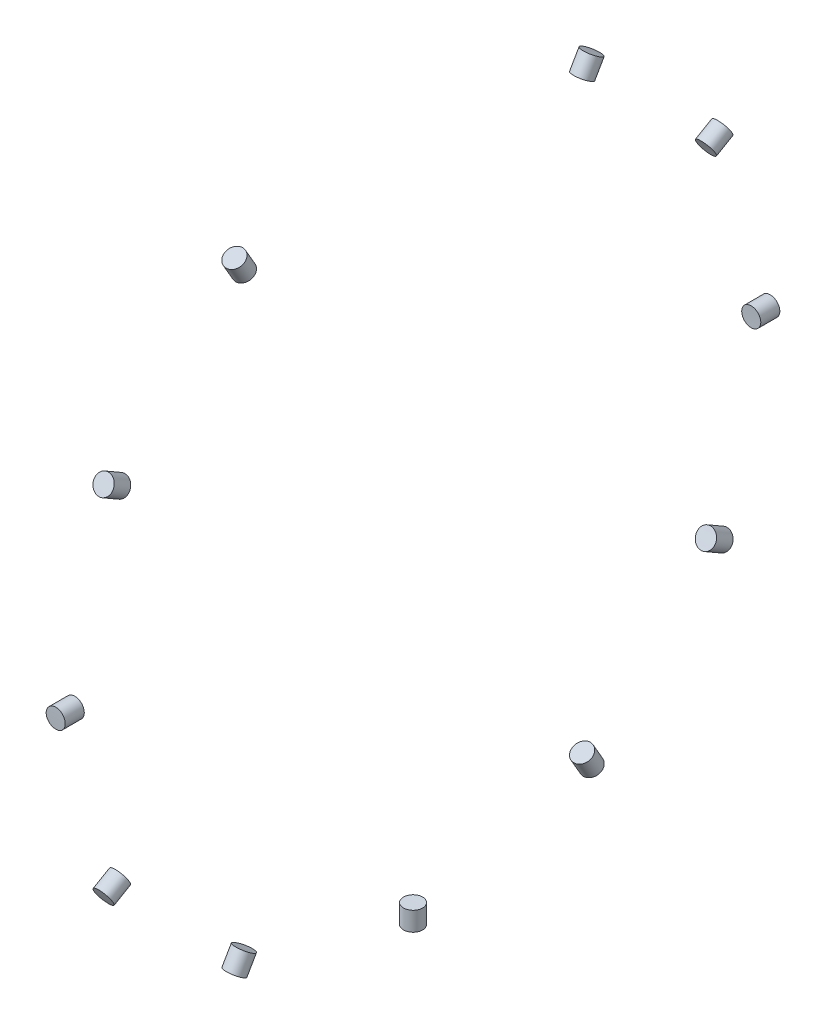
ISO-10303-21;
HEADER;
FILE_DESCRIPTION(('STEP AP214'),'2;1');
FILE_NAME('part.step','',(''),(''),'','','');
FILE_SCHEMA(('AUTOMOTIVE_DESIGN { 1 0 10303 214 1 1 1 1 }'));
ENDSEC;
DATA;
#1=APPLICATION_CONTEXT('core data for automotive mechanical design processes');
#2=APPLICATION_PROTOCOL_DEFINITION('international standard','automotive_design',2000,#1);
#3=PRODUCT_CONTEXT('',#1,'mechanical');
#4=PRODUCT('Part','Part','',(#3));
#5=PRODUCT_RELATED_PRODUCT_CATEGORY('part','',(#4));
#6=PRODUCT_DEFINITION_FORMATION('','',#4);
#7=PRODUCT_DEFINITION_CONTEXT('part definition',#1,'design');
#8=PRODUCT_DEFINITION('design','',#6,#7);
#9=PRODUCT_DEFINITION_SHAPE('','',#8);
#10=(LENGTH_UNIT() NAMED_UNIT(*) SI_UNIT(.MILLI.,.METRE.));
#11=(NAMED_UNIT(*) PLANE_ANGLE_UNIT() SI_UNIT($,.RADIAN.));
#12=(NAMED_UNIT(*) SI_UNIT($,.STERADIAN.) SOLID_ANGLE_UNIT());
#13=UNCERTAINTY_MEASURE_WITH_UNIT(LENGTH_MEASURE(1.E-05),#10,'distance_accuracy_value','');
#14=(GEOMETRIC_REPRESENTATION_CONTEXT(3) GLOBAL_UNCERTAINTY_ASSIGNED_CONTEXT((#13)) GLOBAL_UNIT_ASSIGNED_CONTEXT((#10,
#11,#12)) REPRESENTATION_CONTEXT('',''));
#15=CARTESIAN_POINT('',(0.,0.,0.));
#16=DIRECTION('',(0.,0.,1.));
#17=DIRECTION('',(1.,0.,0.));
#18=AXIS2_PLACEMENT_3D('',#15,#16,#17);
#19=CARTESIAN_POINT('',(0.,0.,0.));
#20=DIRECTION('',(0.,0.866025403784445,-0.499999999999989));
#21=DIRECTION('',(-1.,0.,0.));
#22=AXIS2_PLACEMENT_3D('',#19,#20,#21);
#23=CYLINDRICAL_SURFACE('',#22,0.6);
#24=CARTESIAN_POINT('',(-0.599999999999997,-19.48557158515,11.2499999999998));
#25=CARTESIAN_POINT('',(-0.599998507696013,-19.5024194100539,11.2208184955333));
#26=CARTESIAN_POINT('',(-0.597151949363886,-19.5192133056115,11.1915778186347));
#27=CARTESIAN_POINT('',(-0.58583621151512,-19.5522112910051,11.1338287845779));
#28=CARTESIAN_POINT('',(-0.577360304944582,-19.5684146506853,11.1053213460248));
#29=CARTESIAN_POINT('',(-0.555027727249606,-19.5997666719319,11.0498941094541));
#30=CARTESIAN_POINT('',(-0.541173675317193,-19.6149158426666,11.0229735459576));
#31=CARTESIAN_POINT('',(-0.508481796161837,-19.6437575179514,10.9714931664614));
#32=CARTESIAN_POINT('',(-0.489645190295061,-19.6574503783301,10.94693277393));
#33=CARTESIAN_POINT('',(-0.447514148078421,-19.6830311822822,10.9008705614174));
#34=CARTESIAN_POINT('',(-0.424218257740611,-19.6949185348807,10.8793697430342));
#35=CARTESIAN_POINT('',(-0.37383234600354,-19.7165793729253,10.840064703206));
#36=CARTESIAN_POINT('',(-0.346742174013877,-19.7263527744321,10.82226062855));
#37=CARTESIAN_POINT('',(-0.28953293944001,-19.7435409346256,10.7908717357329));
#38=CARTESIAN_POINT('',(-0.259413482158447,-19.7509553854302,10.7772874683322));
#39=CARTESIAN_POINT('',(-0.197003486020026,-19.7632402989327,10.7547430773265));
#40=CARTESIAN_POINT('',(-0.164712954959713,-19.7681107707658,10.745782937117));
#41=CARTESIAN_POINT('',(-0.0988855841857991,-19.7751875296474,10.732754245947));
#42=CARTESIAN_POINT('',(-0.0653490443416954,-19.7773944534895,10.7286845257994));
#43=CARTESIAN_POINT('',(0.00202513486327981,-19.7790924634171,10.7255538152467));
#44=CARTESIAN_POINT('',(0.0358627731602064,-19.7785835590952,10.7264928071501));
#45=CARTESIAN_POINT('',(0.102869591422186,-19.7748627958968,10.7333506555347));
#46=CARTESIAN_POINT('',(0.136038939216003,-19.7716516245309,10.7392682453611));
#47=CARTESIAN_POINT('',(0.200776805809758,-19.7626055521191,10.7559058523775));
#48=CARTESIAN_POINT('',(0.232345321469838,-19.7567706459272,10.7666258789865));
#49=CARTESIAN_POINT('',(0.292990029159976,-19.742619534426,10.792552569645));
#50=CARTESIAN_POINT('',(0.322065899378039,-19.7343030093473,10.8077598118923));
#51=CARTESIAN_POINT('',(0.376896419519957,-19.715395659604,10.8422118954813));
#52=CARTESIAN_POINT('',(0.402651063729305,-19.7048048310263,10.8614567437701));
#53=CARTESIAN_POINT('',(0.450116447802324,-19.6816126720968,10.9034258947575));
#54=CARTESIAN_POINT('',(0.471825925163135,-19.6690107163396,10.9261512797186));
#55=CARTESIAN_POINT('',(0.510574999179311,-19.6421233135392,10.9744135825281));
#56=CARTESIAN_POINT('',(0.527614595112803,-19.6278378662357,10.9999505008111));
#57=CARTESIAN_POINT('',(0.556540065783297,-19.5979596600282,11.0530948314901));
#58=CARTESIAN_POINT('',(0.568425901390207,-19.5823668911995,11.0807022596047));
#59=CARTESIAN_POINT('',(0.586705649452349,-19.5502949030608,11.1371910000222));
#60=CARTESIAN_POINT('',(0.593099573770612,-19.5338156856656,11.1660723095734));
#61=CARTESIAN_POINT('',(0.600212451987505,-19.5004316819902,11.2242723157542));
#62=CARTESIAN_POINT('',(0.600933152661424,-19.4835270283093,11.2535908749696));
#63=CARTESIAN_POINT('',(0.596683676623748,-19.4497658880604,11.3118407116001));
#64=CARTESIAN_POINT('',(0.591713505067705,-19.4329094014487,11.340771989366));
#65=CARTESIAN_POINT('',(0.576224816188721,-19.3997352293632,11.3974273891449));
#66=CARTESIAN_POINT('',(0.565707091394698,-19.3834174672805,11.4251516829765));
#67=CARTESIAN_POINT('',(0.539422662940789,-19.3518007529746,11.4786224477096));
#68=CARTESIAN_POINT('',(0.523655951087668,-19.3365018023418,11.5043689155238));
#69=CARTESIAN_POINT('',(0.48731661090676,-19.3073803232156,11.5531759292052));
#70=CARTESIAN_POINT('',(0.466742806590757,-19.2935581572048,11.5762358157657));
#71=CARTESIAN_POINT('',(0.421375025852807,-19.2678185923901,11.6190271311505));
#72=CARTESIAN_POINT('',(0.396581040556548,-19.2559011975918,11.6387585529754));
#73=CARTESIAN_POINT('',(0.343469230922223,-19.2343396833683,11.6743570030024));
#74=CARTESIAN_POINT('',(0.315150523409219,-19.2246961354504,11.690223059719));
#75=CARTESIAN_POINT('',(0.255797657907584,-19.2079906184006,11.7176514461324));
#76=CARTESIAN_POINT('',(0.224763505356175,-19.2009286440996,11.7292137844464));
#77=CARTESIAN_POINT('',(0.160864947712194,-19.1896122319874,11.7477189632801));
#78=CARTESIAN_POINT('',(0.128000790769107,-19.1853574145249,11.7546624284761));
#79=CARTESIAN_POINT('',(0.061371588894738,-19.1797904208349,11.7637438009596));
#80=CARTESIAN_POINT('',(0.0276065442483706,-19.1784782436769,11.7658817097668));
#81=CARTESIAN_POINT('',(-0.0398546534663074,-19.1788387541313,11.7652940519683));
#82=CARTESIAN_POINT('',(-0.0735508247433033,-19.1805105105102,11.7625700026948));
#83=CARTESIAN_POINT('',(-0.13992833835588,-19.1867832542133,11.7523352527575));
#84=CARTESIAN_POINT('',(-0.172609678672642,-19.1913842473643,11.7448245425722));
#85=CARTESIAN_POINT('',(-0.236030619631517,-19.203368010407,11.7252201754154));
#86=CARTESIAN_POINT('',(-0.266770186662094,-19.210750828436,11.7131264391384));
#87=CARTESIAN_POINT('',(-0.325434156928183,-19.228062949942,11.6846853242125));
#88=CARTESIAN_POINT('',(-0.353358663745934,-19.237992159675,11.668338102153));
#89=CARTESIAN_POINT('',(-0.405607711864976,-19.2600866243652,11.6318320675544));
#90=CARTESIAN_POINT('',(-0.429931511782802,-19.2722523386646,11.6116724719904));
#91=CARTESIAN_POINT('',(-0.474288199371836,-19.2984440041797,11.5680899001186));
#92=CARTESIAN_POINT('',(-0.494320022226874,-19.3124704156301,11.5446661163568));
#93=CARTESIAN_POINT('',(-0.529526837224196,-19.3419583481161,11.4951936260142));
#94=CARTESIAN_POINT('',(-0.544698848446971,-19.3574207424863,11.4691433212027));
#95=CARTESIAN_POINT('',(-0.569724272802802,-19.389296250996,11.4151727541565));
#96=CARTESIAN_POINT('',(-0.579584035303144,-19.4057082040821,11.3872547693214));
#97=CARTESIAN_POINT('',(-0.59108902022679,-19.4327798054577,11.3409655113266));
#98=CARTESIAN_POINT('',(-0.594426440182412,-19.4433020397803,11.3229168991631));
#99=CARTESIAN_POINT('',(-0.598882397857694,-19.4644137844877,11.2865866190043));
#100=CARTESIAN_POINT('',(-0.600000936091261,-19.4750032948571,11.2683049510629));
#101=CARTESIAN_POINT('',(-0.599999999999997,-19.48557158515,11.2499999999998));
#102=B_SPLINE_CURVE_WITH_KNOTS('',3,(#24,#25,#26,#27,#28,#29,#30,#31,#32,#33,#34,#35,#36,#37,
#38,#39,#40,#41,#42,#43,#44,#45,#46,#47,#48,#49,#50,#51,#52,#53,#54,#55,#56,#57,#58,#59,#60,#61,
#62,#63,#64,#65,#66,#67,#68,#69,#70,#71,#72,#73,#74,#75,#76,#77,#78,#79,#80,#81,#82,#83,#84,#85,
#86,#87,#88,#89,#90,#91,#92,#93,#94,#95,#96,#97,#98,#99,#100,#101),.UNSPECIFIED.,.T.,.F.,(4,2,2,
2,2,2,2,2,2,2,2,2,2,2,2,2,2,2,2,2,2,2,2,2,2,2,2,2,2,2,2,2,2,2,2,2,2,2,4),(0.,0.101010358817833,
0.202141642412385,0.30322373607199,0.404281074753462,0.505371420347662,0.60646577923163,
0.707573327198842,0.808680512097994,0.909763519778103,1.0108461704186,1.11190311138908,
1.21296025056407,1.314030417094,1.41510075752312,1.51620258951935,1.61730443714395,
1.71840705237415,1.81950944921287,1.92058071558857,2.02165189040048,2.12270862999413,
2.22376552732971,2.32484717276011,2.42592903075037,2.5270362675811,2.62814330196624,
2.72923665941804,2.83032998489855,2.93139176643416,3.03245374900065,3.13351748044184,
3.23457749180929,3.33565828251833,3.43676412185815,3.53793185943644,3.63897840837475,
3.70234012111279,3.76570181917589),.UNSPECIFIED.);
#103=CARTESIAN_POINT('',(-0.599999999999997,-19.48557158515,11.2499999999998));
#104=VERTEX_POINT('',#103);
#105=EDGE_CURVE('E11',#104,#104,#102,.T.);
#106=ORIENTED_EDGE('',*,*,#105,.F.);
#107=EDGE_LOOP('',(#106));
#108=FACE_BOUND('',#107,.T.);
#109=CARTESIAN_POINT('',(-0.599999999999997,-18.4463411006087,10.6499999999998));
#110=CARTESIAN_POINT('',(-0.599998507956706,-18.4631885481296,10.6208191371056));
#111=CARTESIAN_POINT('',(-0.597152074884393,-18.4799783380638,10.591576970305));
#112=CARTESIAN_POINT('',(-0.585836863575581,-18.5129610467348,10.5338209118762));
#113=CARTESIAN_POINT('',(-0.577361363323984,-18.5291532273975,10.5053079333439));
#114=CARTESIAN_POINT('',(-0.555029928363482,-18.5604770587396,10.4498662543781));
#115=CARTESIAN_POINT('',(-0.541176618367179,-18.5756092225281,10.4229367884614));
#116=CARTESIAN_POINT('',(-0.508486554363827,-18.6044130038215,10.3714361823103));
#117=CARTESIAN_POINT('',(-0.489651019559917,-18.618084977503,10.3468644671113));
#118=CARTESIAN_POINT('',(-0.447521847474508,-18.643622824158,10.3007778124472));
#119=CARTESIAN_POINT('',(-0.424226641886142,-18.6554880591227,10.2792639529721));
#120=CARTESIAN_POINT('',(-0.373842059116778,-18.6771055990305,10.2399331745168));
#121=CARTESIAN_POINT('',(-0.34675253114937,-18.6868578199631,10.2221164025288));
#122=CARTESIAN_POINT('',(-0.289543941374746,-18.704007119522,10.1907035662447));
#123=CARTESIAN_POINT('',(-0.259424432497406,-18.7114038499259,10.1771081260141));
#124=CARTESIAN_POINT('',(-0.197014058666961,-18.7236586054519,10.1545445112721));
#125=CARTESIAN_POINT('',(-0.164723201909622,-18.7285166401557,10.1455763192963));
#126=CARTESIAN_POINT('',(-0.0988958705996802,-18.7355751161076,10.1325357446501));
#127=CARTESIAN_POINT('',(-0.0653597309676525,-18.737776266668,10.1284620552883));
#128=CARTESIAN_POINT('',(0.00201376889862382,-18.7394702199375,10.1253276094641));
#129=CARTESIAN_POINT('',(0.0358511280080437,-18.738963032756,10.1262668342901));
#130=CARTESIAN_POINT('',(0.102856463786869,-18.7352530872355,10.133129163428));
#131=CARTESIAN_POINT('',(0.136024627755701,-18.7320510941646,10.139050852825));
#132=CARTESIAN_POINT('',(0.200760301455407,-18.7230298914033,10.1556999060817));
#133=CARTESIAN_POINT('',(0.232327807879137,-18.7172106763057,10.16642727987));
#134=CARTESIAN_POINT('',(0.292971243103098,-18.7030956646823,10.192371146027));
#135=CARTESIAN_POINT('',(0.322046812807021,-18.6947995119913,10.2075882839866));
#136=CARTESIAN_POINT('',(0.376877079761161,-18.6759354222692,10.2420613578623));
#137=CARTESIAN_POINT('',(0.402631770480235,-18.6653674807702,10.2613173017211));
#138=CARTESIAN_POINT('',(0.450098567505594,-18.6422206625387,10.3033092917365));
#139=CARTESIAN_POINT('',(0.471809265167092,-18.6296410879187,10.3260465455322));
#140=CARTESIAN_POINT('',(0.510560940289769,-18.6027957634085,10.3743313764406));
#141=CARTESIAN_POINT('',(0.527601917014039,-18.5885300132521,10.3998789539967));
#142=CARTESIAN_POINT('',(0.556530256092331,-18.5586862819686,10.4530422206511));
#143=CARTESIAN_POINT('',(0.568417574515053,-18.5431082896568,10.4806579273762));
#144=CARTESIAN_POINT('',(0.586700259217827,-18.5110592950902,10.5371598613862));
#145=CARTESIAN_POINT('',(0.593095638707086,-18.4945882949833,10.5660460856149));
#146=CARTESIAN_POINT('',(0.600211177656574,-18.4612138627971,10.6242509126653));
#147=CARTESIAN_POINT('',(0.600933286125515,-18.444310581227,10.6535693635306));
#148=CARTESIAN_POINT('',(0.596686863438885,-18.4105446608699,10.7118149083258));
#149=CARTESIAN_POINT('',(0.591718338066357,-18.3936820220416,10.7407420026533));
#150=CARTESIAN_POINT('',(0.576233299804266,-18.3604890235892,10.7973849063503));
#151=CARTESIAN_POINT('',(0.565717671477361,-18.34415857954,10.8251009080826));
#152=CARTESIAN_POINT('',(0.539437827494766,-18.3125111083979,10.8785524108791));
#153=CARTESIAN_POINT('',(0.523673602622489,-18.2971940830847,10.9042879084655));
#154=CARTESIAN_POINT('',(0.487339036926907,-18.2680326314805,10.9530723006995));
#155=CARTESIAN_POINT('',(0.466767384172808,-18.2541886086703,10.9761204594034));
#156=CARTESIAN_POINT('',(0.421403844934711,-18.2284043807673,11.0188882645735));
#157=CARTESIAN_POINT('',(0.396611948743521,-18.2164641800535,11.0386079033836));
#158=CARTESIAN_POINT('',(0.343503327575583,-18.1948582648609,11.0741847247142));
#159=CARTESIAN_POINT('',(0.315185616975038,-18.1851931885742,11.090040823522));
#160=CARTESIAN_POINT('',(0.255834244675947,-18.1684486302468,11.1174517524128));
#161=CARTESIAN_POINT('',(0.224800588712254,-18.1613691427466,11.1290065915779));
#162=CARTESIAN_POINT('',(0.160902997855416,-18.1500237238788,11.1475000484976));
#163=CARTESIAN_POINT('',(0.128039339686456,-18.145757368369,11.1544393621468));
#164=CARTESIAN_POINT('',(0.0614106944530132,-18.1401743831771,11.1635165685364));
#165=CARTESIAN_POINT('',(0.0276457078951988,-18.1388577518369,11.1656544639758));
#166=CARTESIAN_POINT('',(-0.0398145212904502,-18.1392168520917,11.1650710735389));
#167=CARTESIAN_POINT('',(-0.0735097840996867,-18.1408915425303,11.1623514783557));
#168=CARTESIAN_POINT('',(-0.139885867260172,-18.1471769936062,11.1521299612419));
#169=CARTESIAN_POINT('',(-0.17256668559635,-18.1517877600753,11.1446280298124));
#170=CARTESIAN_POINT('',(-0.235987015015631,-18.1637966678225,11.1250447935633));
#171=CARTESIAN_POINT('',(-0.266726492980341,-18.1711948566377,11.112963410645));
#172=CARTESIAN_POINT('',(-0.325390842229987,-18.1885414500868,11.0845494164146));
#173=CARTESIAN_POINT('',(-0.353315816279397,-18.1984897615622,11.0682169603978));
#174=CARTESIAN_POINT('',(-0.405567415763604,-18.2206243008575,11.0317407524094));
#175=CARTESIAN_POINT('',(-0.429893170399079,-18.2328110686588,11.0115960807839));
#176=CARTESIAN_POINT('',(-0.474254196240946,-18.2590440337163,10.9680424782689));
#177=CARTESIAN_POINT('',(-0.4942884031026,-18.2730906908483,10.944632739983));
#178=CARTESIAN_POINT('',(-0.529500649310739,-18.3026162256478,10.8951855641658));
#179=CARTESIAN_POINT('',(-0.544675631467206,-18.3180959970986,10.8691464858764));
#180=CARTESIAN_POINT('',(-0.5697070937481,-18.3500011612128,10.8151946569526));
#181=CARTESIAN_POINT('',(-0.579569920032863,-18.3664253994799,10.7872841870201));
#182=CARTESIAN_POINT('',(-0.591081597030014,-18.3935158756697,10.7409964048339));
#183=CARTESIAN_POINT('',(-0.594421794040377,-18.4040467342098,10.7229429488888));
#184=CARTESIAN_POINT('',(-0.598881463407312,-18.4251729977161,10.6866010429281));
#185=CARTESIAN_POINT('',(-0.600000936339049,-18.4357684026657,10.6683125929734));
#186=CARTESIAN_POINT('',(-0.599999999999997,-18.4463411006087,10.6499999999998));
#187=B_SPLINE_CURVE_WITH_KNOTS('',3,(#109,#110,#111,#112,#113,#114,#115,#116,#117,#118,#119,
#120,#121,#122,#123,#124,#125,#126,#127,#128,#129,#130,#131,#132,#133,#134,#135,#136,#137,#138,
#139,#140,#141,#142,#143,#144,#145,#146,#147,#148,#149,#150,#151,#152,#153,#154,#155,#156,#157,
#158,#159,#160,#161,#162,#163,#164,#165,#166,#167,#168,#169,#170,#171,#172,#173,#174,#175,#176,
#177,#178,#179,#180,#181,#182,#183,#184,#185,#186),.UNSPECIFIED.,.T.,.F.,(4,2,2,2,2,2,2,2,2,2,2,
2,2,2,2,2,2,2,2,2,2,2,2,2,2,2,2,2,2,2,2,2,2,2,2,2,2,2,4),(0.,0.101008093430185,
0.202137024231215,0.303216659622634,0.404271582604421,0.505362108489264,0.606456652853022,
0.707566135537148,0.808675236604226,0.90975733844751,1.0108390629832,1.11189209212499,
1.2129453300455,1.31401310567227,1.41508108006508,1.51618419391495,1.61728732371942,
1.71839131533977,1.81949506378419,1.92056407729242,2.02163298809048,2.12268578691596,
2.22373876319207,2.32481934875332,2.42590016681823,2.52700930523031,2.62811823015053,
2.72921190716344,2.83030552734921,2.93136396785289,3.03242260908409,3.13348297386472,
3.23453964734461,3.33562073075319,3.43672685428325,3.53789646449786,3.63894494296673,
3.70233308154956,3.76572120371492),.UNSPECIFIED.);
#188=CARTESIAN_POINT('',(-0.599999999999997,-18.4463411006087,10.6499999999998));
#189=VERTEX_POINT('',#188);
#190=EDGE_CURVE('E44',#189,#189,#187,.T.);
#191=ORIENTED_EDGE('',*,*,#190,.T.);
#192=EDGE_LOOP('',(#191));
#193=FACE_BOUND('',#192,.T.);
#194=ADVANCED_FACE('F40',(#108,#193),#23,.T.);
#195=CARTESIAN_POINT('',(10.,0.,0.));
#196=DIRECTION('',(-1.,0.,0.));
#197=DIRECTION('',(0.,0.,1.));
#198=AXIS2_PLACEMENT_3D('',#195,#196,#197);
#199=CYLINDRICAL_SURFACE('',#198,22.5);
#200=ORIENTED_EDGE('',*,*,#105,.T.);
#201=EDGE_LOOP('',(#200));
#202=FACE_BOUND('',#201,.T.);
#203=ADVANCED_FACE('F56',(#202),#199,.T.);
#204=CARTESIAN_POINT('',(10.,0.,0.));
#205=DIRECTION('',(-1.,0.,0.));
#206=DIRECTION('',(0.,0.,1.));
#207=AXIS2_PLACEMENT_3D('',#204,#205,#206);
#208=CYLINDRICAL_SURFACE('',#207,21.3);
#209=ORIENTED_EDGE('',*,*,#190,.F.);
#210=EDGE_LOOP('',(#209));
#211=FACE_BOUND('',#210,.T.);
#212=ADVANCED_FACE('F59',(#211),#208,.F.);
#213=CLOSED_SHELL('',(#194,#203,#212));
#214=MANIFOLD_SOLID_BREP('B2',#213);
#215=CARTESIAN_POINT('',(0.,0.,0.));
#216=DIRECTION('',(0.,0.50000000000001,-0.866025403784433));
#217=DIRECTION('',(-1.,0.,0.));
#218=AXIS2_PLACEMENT_3D('',#215,#216,#217);
#219=CYLINDRICAL_SURFACE('',#218,0.6);
#220=CARTESIAN_POINT('',(-0.599999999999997,-11.2500000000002,19.4855715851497));
#221=CARTESIAN_POINT('',(-0.599998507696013,-11.2791813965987,19.4687235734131));
#222=CARTESIAN_POINT('',(-0.597151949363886,-11.3083456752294,19.4517973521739));
#223=CARTESIAN_POINT('',(-0.58583621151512,-11.3657972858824,19.4182842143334));
#224=CARTESIAN_POINT('',(-0.577360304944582,-11.3940835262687,19.4016977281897));
#225=CARTESIAN_POINT('',(-0.555027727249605,-11.4489487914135,19.3693723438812));
#226=CARTESIAN_POINT('',(-0.541173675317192,-11.4755286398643,19.3536330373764));
#227=CARTESIAN_POINT('',(-0.508481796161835,-11.5262464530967,19.3234705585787));
#228=CARTESIAN_POINT('',(-0.489645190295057,-11.5503850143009,19.3090470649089));
#229=CARTESIAN_POINT('',(-0.447514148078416,-11.5955697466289,19.2819464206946));
#230=CARTESIAN_POINT('',(-0.424218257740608,-11.6166149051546,19.2692698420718));
#231=CARTESIAN_POINT('',(-0.373832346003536,-11.6550262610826,19.2460610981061));
#232=CARTESIAN_POINT('',(-0.346742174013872,-11.6723923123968,19.2355290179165));
#233=CARTESIAN_POINT('',(-0.289532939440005,-11.7029721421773,19.216939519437));
#234=CARTESIAN_POINT('',(-0.259413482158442,-11.7161853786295,19.2088824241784));
#235=CARTESIAN_POINT('',(-0.197003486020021,-11.7380966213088,19.195500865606));
#236=CARTESIAN_POINT('',(-0.164712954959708,-11.7467946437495,19.1901763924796));
#237=CARTESIAN_POINT('',(-0.0988855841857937,-11.7594376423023,19.1824315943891));
#238=CARTESIAN_POINT('',(-0.0653490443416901,-11.7633837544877,19.180010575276));
#239=CARTESIAN_POINT('',(0.00202513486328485,-11.7664196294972,19.1781483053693));
#240=CARTESIAN_POINT('',(0.0358627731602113,-11.7655094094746,19.1787070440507));
#241=CARTESIAN_POINT('',(0.102869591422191,-11.758858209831,19.1827857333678));
#242=CARTESIAN_POINT('',(0.136038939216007,-11.7531184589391,19.1863049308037));
#243=CARTESIAN_POINT('',(0.200776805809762,-11.7369655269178,19.1961904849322));
#244=CARTESIAN_POINT('',(0.232345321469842,-11.7265523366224,19.2025568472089));
#245=CARTESIAN_POINT('',(0.292990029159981,-11.7013337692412,19.2179344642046));
#246=CARTESIAN_POINT('',(0.322065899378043,-11.6865278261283,19.2269460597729));
#247=CARTESIAN_POINT('',(0.37689641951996,-11.6529275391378,19.2473287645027));
#248=CARTESIAN_POINT('',(0.402651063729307,-11.634133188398,19.2586998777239));
#249=CARTESIAN_POINT('',(0.450116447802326,-11.5930636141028,19.2834501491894));
#250=CARTESIAN_POINT('',(0.471825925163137,-11.5707873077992,19.296829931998));
#251=CARTESIAN_POINT('',(0.510574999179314,-11.5233709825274,19.3251826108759));
#252=CARTESIAN_POINT('',(0.527614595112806,-11.4982309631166,19.3401555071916));
#253=CARTESIAN_POINT('',(0.556540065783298,-11.445783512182,19.3712407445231));
#254=CARTESIAN_POINT('',(0.568425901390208,-11.4184760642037,19.387353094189));
#255=CARTESIAN_POINT('',(0.586705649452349,-11.3624565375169,19.4202377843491));
#256=CARTESIAN_POINT('',(0.593099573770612,-11.3337444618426,19.4370101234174));
#257=CARTESIAN_POINT('',(0.600212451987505,-11.2757330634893,19.4707208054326));
#258=CARTESIAN_POINT('',(0.600933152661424,-11.2464339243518,19.4876590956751));
#259=CARTESIAN_POINT('',(0.596683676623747,-11.1880710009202,19.521224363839));
#260=CARTESIAN_POINT('',(0.591713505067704,-11.159007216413,19.5378513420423));
#261=CARTESIAN_POINT('',(0.576224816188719,-11.101949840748,19.5703292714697));
#262=CARTESIAN_POINT('',(0.565707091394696,-11.0739560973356,19.5861803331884));
#263=CARTESIAN_POINT('',(0.539422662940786,-11.019839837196,19.6166790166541));
#264=CARTESIAN_POINT('',(0.523655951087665,-10.9937173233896,19.6313266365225));
#265=CARTESIAN_POINT('',(0.487316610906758,-10.9440938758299,19.6590340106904));
#266=CARTESIAN_POINT('',(0.466742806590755,-10.9205935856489,19.6720933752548));
#267=CARTESIAN_POINT('',(0.421375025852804,-10.8769068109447,19.696281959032));
#268=CARTESIAN_POINT('',(0.396581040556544,-10.85672033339,19.707411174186));
#269=CARTESIAN_POINT('',(0.343469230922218,-10.8202482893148,19.727459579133));
#270=CARTESIAN_POINT('',(0.315150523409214,-10.803963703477,19.7363782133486));
#271=CARTESIAN_POINT('',(0.255797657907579,-10.7757821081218,19.7517791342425));
#272=CARTESIAN_POINT('',(0.224763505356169,-10.7638850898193,19.758261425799));
#273=CARTESIAN_POINT('',(0.160864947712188,-10.7448322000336,19.7686291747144));
#274=CARTESIAN_POINT('',(0.128000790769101,-10.7376756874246,19.7725149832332));
#275=CARTESIAN_POINT('',(0.0613715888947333,-10.7283138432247,19.7775961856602));
#276=CARTESIAN_POINT('',(0.0276065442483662,-10.7261085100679,19.7787915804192));
#277=CARTESIAN_POINT('',(-0.039854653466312,-10.726714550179,19.7784629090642));
#278=CARTESIAN_POINT('',(-0.0735508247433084,-10.7295243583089,19.7769396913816));
#279=CARTESIAN_POINT('',(-0.139928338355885,-10.7400740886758,19.771212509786));
#280=CARTESIAN_POINT('',(-0.172609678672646,-10.7478140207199,19.7670085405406));
#281=CARTESIAN_POINT('',(-0.236030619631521,-10.7679944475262,19.7560225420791));
#282=CARTESIAN_POINT('',(-0.266770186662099,-10.7804350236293,19.749240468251));
#283=CARTESIAN_POINT('',(-0.325434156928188,-10.8096483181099,19.7332658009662));
#284=CARTESIAN_POINT('',(-0.353358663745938,-10.8264208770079,19.7240732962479));
#285=CARTESIAN_POINT('',(-0.405607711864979,-10.8638082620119,19.7035053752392));
#286=CARTESIAN_POINT('',(-0.429931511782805,-10.8844238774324,19.6921295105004));
#287=CARTESIAN_POINT('',(-0.474288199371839,-10.9288978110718,19.6674817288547));
#288=CARTESIAN_POINT('',(-0.494320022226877,-10.9527569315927,19.6542093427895));
#289=CARTESIAN_POINT('',(-0.529526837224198,-11.0030304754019,19.6261088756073));
#290=CARTESIAN_POINT('',(-0.544698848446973,-11.0294464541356,19.6112798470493));
#291=CARTESIAN_POINT('',(-0.569724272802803,-11.0840367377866,19.5804777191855));
#292=CARTESIAN_POINT('',(-0.579584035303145,-11.1122088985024,19.5645060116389));
#293=CARTESIAN_POINT('',(-0.591089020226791,-11.1587982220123,19.5379541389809));
#294=CARTESIAN_POINT('',(-0.594426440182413,-11.1769350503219,19.5275846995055));
#295=CARTESIAN_POINT('',(-0.598882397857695,-11.2133834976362,19.5066776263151));
#296=CARTESIAN_POINT('',(-0.600000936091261,-11.2316951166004,19.496139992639));
#297=CARTESIAN_POINT('',(-0.599999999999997,-11.2500000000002,19.4855715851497));
#298=B_SPLINE_CURVE_WITH_KNOTS('',3,(#220,#221,#222,#223,#224,#225,#226,#227,#228,#229,#230,
#231,#232,#233,#234,#235,#236,#237,#238,#239,#240,#241,#242,#243,#244,#245,#246,#247,#248,#249,
#250,#251,#252,#253,#254,#255,#256,#257,#258,#259,#260,#261,#262,#263,#264,#265,#266,#267,#268,
#269,#270,#271,#272,#273,#274,#275,#276,#277,#278,#279,#280,#281,#282,#283,#284,#285,#286,#287,
#288,#289,#290,#291,#292,#293,#294,#295,#296,#297),.UNSPECIFIED.,.T.,.F.,(4,2,2,2,2,2,2,2,2,2,2,
2,2,2,2,2,2,2,2,2,2,2,2,2,2,2,2,2,2,2,2,2,2,2,2,2,2,2,4),(0.,0.101010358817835,
0.202141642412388,0.303223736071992,0.404281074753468,0.505371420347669,0.606465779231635,
0.707573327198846,0.808680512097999,0.909763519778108,1.0108461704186,1.11190311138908,
1.21296025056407,1.314030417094,1.41510075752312,1.51620258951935,1.61730443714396,
1.71840705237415,1.81950944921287,1.92058071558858,2.02165189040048,2.12270862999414,
2.22376552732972,2.32484717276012,2.42592903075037,2.52703626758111,2.62814330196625,
2.72923665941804,2.83032998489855,2.93139176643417,3.03245374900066,3.13351748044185,
3.23457749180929,3.33565828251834,3.43676412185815,3.53793185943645,3.63897840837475,
3.7023401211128,3.76570181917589),.UNSPECIFIED.);
#299=CARTESIAN_POINT('',(-0.599999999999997,-11.2500000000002,19.4855715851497));
#300=VERTEX_POINT('',#299);
#301=EDGE_CURVE('E39',#300,#300,#298,.T.);
#302=ORIENTED_EDGE('',*,*,#301,.F.);
#303=EDGE_LOOP('',(#302));
#304=FACE_BOUND('',#303,.T.);
#305=CARTESIAN_POINT('',(-0.599999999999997,-10.6500000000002,18.4463411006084));
#306=CARTESIAN_POINT('',(-0.599998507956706,-10.6791807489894,18.4294934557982));
#307=CARTESIAN_POINT('',(-0.597152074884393,-10.7083422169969,18.4125638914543));
#308=CARTESIAN_POINT('',(-0.585836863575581,-10.765784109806,18.379037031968));
#309=CARTESIAN_POINT('',(-0.577361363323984,-10.7940634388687,18.3624401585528));
#310=CARTESIAN_POINT('',(-0.555029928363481,-10.8489115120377,18.330088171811));
#311=CARTESIAN_POINT('',(-0.541176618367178,-10.8754810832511,18.314332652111));
#312=CARTESIAN_POINT('',(-0.508486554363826,-10.9261761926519,18.2841337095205));
#313=CARTESIAN_POINT('',(-0.489651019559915,-10.9503023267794,18.2696899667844));
#314=CARTESIAN_POINT('',(-0.447521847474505,-10.9954620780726,18.2425466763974));
#315=CARTESIAN_POINT('',(-0.424226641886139,-11.0164946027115,18.2298477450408));
#316=CARTESIAN_POINT('',(-0.373842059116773,-11.0548813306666,18.2065950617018));
#317=CARTESIAN_POINT('',(-0.346752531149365,-11.0722353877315,18.1960413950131));
#318=CARTESIAN_POINT('',(-0.289543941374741,-11.1027935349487,18.1774117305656));
#319=CARTESIAN_POINT('',(-0.259424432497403,-11.1159970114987,18.1693360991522));
#320=CARTESIAN_POINT('',(-0.197014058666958,-11.1378917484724,18.1559228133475));
#321=CARTESIAN_POINT('',(-0.164723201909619,-11.1465830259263,18.1505851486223));
#322=CARTESIAN_POINT('',(-0.098895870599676,-11.1592161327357,18.1428209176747));
#323=CARTESIAN_POINT('',(-0.0653597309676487,-11.1631592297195,18.1403935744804));
#324=CARTESIAN_POINT('',(0.00201376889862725,-11.1661934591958,18.1385260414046));
#325=CARTESIAN_POINT('',(0.0358511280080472,-11.1652846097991,18.139085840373));
#326=CARTESIAN_POINT('',(0.102856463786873,-11.1586405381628,18.1431738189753));
#327=CARTESIAN_POINT('',(0.136024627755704,-11.1529066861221,18.146701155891));
#328=CARTESIAN_POINT('',(0.20076030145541,-11.1367695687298,18.1566090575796));
#329=CARTESIAN_POINT('',(0.232327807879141,-11.1263662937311,18.1629896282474));
#330=CARTESIAN_POINT('',(0.292971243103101,-11.101170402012,18.1784001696));
#331=CARTESIAN_POINT('',(0.322046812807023,-11.0863771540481,18.1874305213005));
#332=CARTESIAN_POINT('',(0.376877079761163,-11.0528038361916,18.2078530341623));
#333=CARTESIAN_POINT('',(0.402631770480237,-11.0340237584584,18.2192451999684));
#334=CARTESIAN_POINT('',(0.450098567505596,-10.9929820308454,18.2440379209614));
#335=CARTESIAN_POINT('',(0.471809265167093,-10.9707191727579,18.2574391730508));
#336=CARTESIAN_POINT('',(0.510560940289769,-10.923328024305,18.2858324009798));
#337=CARTESIAN_POINT('',(0.52760191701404,-10.8981997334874,18.3008243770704));
#338=CARTESIAN_POINT('',(0.556530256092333,-10.845772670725,18.3319432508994));
#339=CARTESIAN_POINT('',(0.568417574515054,-10.8184738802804,18.348070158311));
#340=CARTESIAN_POINT('',(0.586700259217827,-10.7624676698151,18.3809777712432));
#341=CARTESIAN_POINT('',(0.593095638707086,-10.7337602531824,18.3977584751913));
#342=CARTESIAN_POINT('',(0.600211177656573,-10.675754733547,18.4314781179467));
#343=CARTESIAN_POINT('',(0.600933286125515,-10.6464568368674,18.4484170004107));
#344=CARTESIAN_POINT('',(0.596686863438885,-10.5880919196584,18.481976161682));
#345=CARTESIAN_POINT('',(0.591718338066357,-10.5590248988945,18.4985964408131));
#346=CARTESIAN_POINT('',(0.576233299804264,-10.5019574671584,18.5310541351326));
#347=CARTESIAN_POINT('',(0.565717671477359,-10.4739568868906,18.5468916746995));
#348=CARTESIAN_POINT('',(0.539437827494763,-10.4198236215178,18.5773582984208));
#349=CARTESIAN_POINT('',(0.523673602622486,-10.3936909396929,18.591987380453));
#350=CARTESIAN_POINT('',(0.487339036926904,-10.3440441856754,18.6196551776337));
#351=CARTESIAN_POINT('',(0.466767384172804,-10.3205308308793,18.6326934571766));
#352=CARTESIAN_POINT('',(0.421403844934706,-10.2768171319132,18.6568393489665));
#353=CARTESIAN_POINT('',(0.396611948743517,-10.2566167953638,18.6679469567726));
#354=CARTESIAN_POINT('',(0.34350332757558,-10.2201171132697,18.6879544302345));
#355=CARTESIAN_POINT('',(0.315185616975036,-10.203818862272,18.6968536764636));
#356=CARTESIAN_POINT('',(0.255834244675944,-10.1756121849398,18.7122199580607));
#357=CARTESIAN_POINT('',(0.224800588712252,-10.1637037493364,18.7186869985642));
#358=CARTESIAN_POINT('',(0.160902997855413,-10.1446315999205,18.7290300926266));
#359=CARTESIAN_POINT('',(0.128039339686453,-10.1374671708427,18.7329065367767));
#360=CARTESIAN_POINT('',(0.0614106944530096,-10.1280935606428,18.7379761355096));
#361=CARTESIAN_POINT('',(0.0276457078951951,-10.1258843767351,18.7391692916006));
#362=CARTESIAN_POINT('',(-0.0398145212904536,-10.1264870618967,18.7388436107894));
#363=CARTESIAN_POINT('',(-0.0735097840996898,-10.1292971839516,18.737325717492));
#364=CARTESIAN_POINT('',(-0.139885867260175,-10.1398513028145,18.7316163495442));
#365=CARTESIAN_POINT('',(-0.172566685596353,-10.1475953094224,18.7274248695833));
#366=CARTESIAN_POINT('',(-0.235987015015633,-10.1677869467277,18.7164697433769));
#367=CARTESIAN_POINT('',(-0.266726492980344,-10.1802346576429,18.7097060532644));
#368=CARTESIAN_POINT('',(-0.32539084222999,-10.2094642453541,18.6937721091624));
#369=CARTESIAN_POINT('',(-0.353315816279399,-10.226245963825,18.6846019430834));
#370=CARTESIAN_POINT('',(-0.405567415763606,-10.26365314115,18.6640798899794));
#371=CARTESIAN_POINT('',(-0.429893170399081,-10.2842795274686,18.6527274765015));
#372=CARTESIAN_POINT('',(-0.474254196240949,-10.3287747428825,18.6281254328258));
#373=CARTESIAN_POINT('',(-0.494288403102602,-10.3526443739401,18.6148753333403));
#374=CARTESIAN_POINT('',(-0.529500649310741,-10.4029378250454,18.586815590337));
#375=CARTESIAN_POINT('',(-0.544675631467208,-10.4293632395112,18.5720049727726));
#376=CARTESIAN_POINT('',(-0.569707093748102,-10.4839698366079,18.5412339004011));
#377=CARTESIAN_POINT('',(-0.579569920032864,-10.5121488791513,18.5252748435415));
#378=CARTESIAN_POINT('',(-0.591081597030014,-10.5587538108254,18.4987336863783));
#379=CARTESIAN_POINT('',(-0.594421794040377,-10.5769005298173,18.4883643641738));
#380=CARTESIAN_POINT('',(-0.598881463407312,-10.6133673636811,18.4674544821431));
#381=CARTESIAN_POINT('',(-0.600000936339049,-10.6316874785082,18.4569139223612));
#382=CARTESIAN_POINT('',(-0.599999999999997,-10.6500000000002,18.4463411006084));
#383=B_SPLINE_CURVE_WITH_KNOTS('',3,(#305,#306,#307,#308,#309,#310,#311,#312,#313,#314,#315,
#316,#317,#318,#319,#320,#321,#322,#323,#324,#325,#326,#327,#328,#329,#330,#331,#332,#333,#334,
#335,#336,#337,#338,#339,#340,#341,#342,#343,#344,#345,#346,#347,#348,#349,#350,#351,#352,#353,
#354,#355,#356,#357,#358,#359,#360,#361,#362,#363,#364,#365,#366,#367,#368,#369,#370,#371,#372,
#373,#374,#375,#376,#377,#378,#379,#380,#381,#382),.UNSPECIFIED.,.T.,.F.,(4,2,2,2,2,2,2,2,2,2,2,
2,2,2,2,2,2,2,2,2,2,2,2,2,2,2,2,2,2,2,2,2,2,2,2,2,2,2,4),(0.,0.101008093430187,
0.202137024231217,0.303216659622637,0.404271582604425,0.505362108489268,0.606456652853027,
0.707566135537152,0.80867523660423,0.909757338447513,1.0108390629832,1.111892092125,
1.21294533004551,1.31401310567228,1.41508108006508,1.51618419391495,1.61728732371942,
1.71839131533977,1.81949506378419,1.92056407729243,2.02163298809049,2.12268578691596,
2.22373876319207,2.32481934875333,2.42590016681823,2.52700930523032,2.62811823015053,
2.72921190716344,2.83030552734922,2.93136396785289,3.03242260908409,3.13348297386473,
3.23453964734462,3.33562073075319,3.43672685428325,3.53789646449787,3.63894494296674,
3.70233308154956,3.76572120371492),.UNSPECIFIED.);
#384=CARTESIAN_POINT('',(-0.599999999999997,-10.6500000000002,18.4463411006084));
#385=VERTEX_POINT('',#384);
#386=EDGE_CURVE('E101',#385,#385,#383,.T.);
#387=ORIENTED_EDGE('',*,*,#386,.T.);
#388=EDGE_LOOP('',(#387));
#389=FACE_BOUND('',#388,.T.);
#390=ADVANCED_FACE('F97',(#304,#389),#219,.T.);
#391=CARTESIAN_POINT('',(10.,0.,0.));
#392=DIRECTION('',(-1.,0.,0.));
#393=DIRECTION('',(0.,0.,1.));
#394=AXIS2_PLACEMENT_3D('',#391,#392,#393);
#395=CYLINDRICAL_SURFACE('',#394,22.5);
#396=ORIENTED_EDGE('',*,*,#301,.T.);
#397=EDGE_LOOP('',(#396));
#398=FACE_BOUND('',#397,.T.);
#399=ADVANCED_FACE('F113',(#398),#395,.T.);
#400=CARTESIAN_POINT('',(10.,0.,0.));
#401=DIRECTION('',(-1.,0.,0.));
#402=DIRECTION('',(0.,0.,1.));
#403=AXIS2_PLACEMENT_3D('',#400,#401,#402);
#404=CYLINDRICAL_SURFACE('',#403,21.3);
#405=ORIENTED_EDGE('',*,*,#386,.F.);
#406=EDGE_LOOP('',(#405));
#407=FACE_BOUND('',#406,.T.);
#408=ADVANCED_FACE('F116',(#407),#404,.F.);
#409=CLOSED_SHELL('',(#390,#399,#408));
#410=MANIFOLD_SOLID_BREP('B6',#409);
#411=CARTESIAN_POINT('',(0.,0.,0.));
#412=DIRECTION('',(0.,0.,-1.));
#413=DIRECTION('',(-1.,0.,0.));
#414=AXIS2_PLACEMENT_3D('',#411,#412,#413);
#415=CYLINDRICAL_SURFACE('',#414,0.6);
#416=CARTESIAN_POINT('',(-0.599999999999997,-2.35674990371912E-13,22.5));
#417=CARTESIAN_POINT('',(-0.599998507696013,-0.0336958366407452,22.4999998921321));
#418=CARTESIAN_POINT('',(-0.597151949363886,-0.0674159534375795,22.4999234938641));
#419=CARTESIAN_POINT('',(-0.58583621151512,-0.133927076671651,22.4996260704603));
#420=CARTESIAN_POINT('',(-0.577360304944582,-0.166716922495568,22.4994048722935));
#421=CARTESIAN_POINT('',(-0.555027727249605,-0.230394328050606,22.4988429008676));
#422=CARTESIAN_POINT('',(-0.541173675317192,-0.261282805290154,22.4985021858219));
#423=CARTESIAN_POINT('',(-0.508481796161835,-0.320286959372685,22.4977396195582));
#424=CARTESIAN_POINT('',(-0.489645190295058,-0.348403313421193,22.4973177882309));
#425=CARTESIAN_POINT('',(-0.447514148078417,-0.40108476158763,22.4964403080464));
#426=CARTESIAN_POINT('',(-0.424218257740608,-0.425648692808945,22.4959846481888));
#427=CARTESIAN_POINT('',(-0.373832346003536,-0.470518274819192,22.4950909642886));
#428=CARTESIAN_POINT('',(-0.346742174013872,-0.490823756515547,22.4946529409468));
#429=CARTESIAN_POINT('',(-0.289532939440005,-0.526601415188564,22.4938438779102));
#430=CARTESIAN_POINT('',(-0.259413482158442,-0.542072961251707,22.4934728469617));
#431=CARTESIAN_POINT('',(-0.197003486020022,-0.567739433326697,22.4928396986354));
#432=CARTESIAN_POINT('',(-0.16471295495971,-0.57793437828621,22.4925775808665));
#433=CARTESIAN_POINT('',(-0.0988855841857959,-0.592755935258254,22.4921918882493));
#434=CARTESIAN_POINT('',(-0.0653490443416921,-0.597383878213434,22.4920682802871));
#435=CARTESIAN_POINT('',(0.00202513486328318,-0.600944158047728,22.4919734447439));
#436=CARTESIAN_POINT('',(0.0358627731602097,-0.599876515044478,22.4920022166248));
#437=CARTESIAN_POINT('',(0.10286959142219,-0.592077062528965,22.4922088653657));
#438=CARTESIAN_POINT('',(0.136038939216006,-0.585346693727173,22.4923867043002));
#439=CARTESIAN_POINT('',(0.200776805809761,-0.56641506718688,22.4928713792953));
#440=CARTESIAN_POINT('',(0.232345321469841,-0.554213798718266,22.493178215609));
#441=CARTESIAN_POINT('',(0.29299002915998,-0.524685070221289,22.4938863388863));
#442=CARTESIAN_POINT('',(0.322065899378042,-0.507356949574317,22.4942876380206));
#443=CARTESIAN_POINT('',(0.37689641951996,-0.468066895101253,22.4951394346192));
#444=CARTESIAN_POINT('',(0.402651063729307,-0.446104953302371,22.4955899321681));
#445=CARTESIAN_POINT('',(0.450116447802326,-0.3981625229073,22.4964895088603));
#446=CARTESIAN_POINT('',(0.471825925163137,-0.372180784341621,22.4969385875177));
#447=CARTESIAN_POINT('',(0.510574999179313,-0.316940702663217,22.4977845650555));
#448=CARTESIAN_POINT('',(0.527614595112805,-0.287682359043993,22.4981814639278));
#449=CARTESIAN_POINT('',(0.556540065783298,-0.226718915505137,22.4988783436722));
#450=CARTESIAN_POINT('',(0.568425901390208,-0.195013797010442,22.4991783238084));
#451=CARTESIAN_POINT('',(0.586705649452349,-0.13005711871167,22.4996475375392));
#452=CARTESIAN_POINT('',(0.593099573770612,-0.096805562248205,22.4998167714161));
#453=CARTESIAN_POINT('',(0.600212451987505,-0.0297108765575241,22.5000053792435));
#454=CARTESIAN_POINT('',(0.600933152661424,0.00413206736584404,22.5000247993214));
#455=CARTESIAN_POINT('',(0.596683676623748,0.0714584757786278,22.4999117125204));
#456=CARTESIAN_POINT('',(0.591713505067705,0.10494194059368,22.4997792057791));
#457=CARTESIAN_POINT('',(0.57622481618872,0.170594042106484,22.499377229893));
#458=CARTESIAN_POINT('',(0.565707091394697,0.202762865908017,22.4991077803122));
#459=CARTESIAN_POINT('',(0.539422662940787,0.264878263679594,22.4984622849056));
#460=CARTESIAN_POINT('',(0.523655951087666,0.294824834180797,22.4980862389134));
#461=CARTESIAN_POINT('',(0.487316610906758,0.351653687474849,22.4972698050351));
#462=CARTESIAN_POINT('',(0.466742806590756,0.378535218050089,22.4968294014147));
#463=CARTESIAN_POINT('',(0.421375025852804,0.42846336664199,22.4959339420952));
#464=CARTESIAN_POINT('',(0.396581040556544,0.451509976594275,22.4954788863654));
#465=CARTESIAN_POINT('',(0.343469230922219,0.49311989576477,22.4946052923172));
#466=CARTESIAN_POINT('',(0.315150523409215,0.511682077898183,22.4941867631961));
#467=CARTESIAN_POINT('',(0.25579765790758,0.543788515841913,22.4934335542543));
#468=CARTESIAN_POINT('',(0.224763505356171,0.557332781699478,22.4930988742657));
#469=CARTESIAN_POINT('',(0.16086494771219,0.579016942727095,22.4925511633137));
#470=CARTESIAN_POINT('',(0.128000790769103,0.587157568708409,22.4923381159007));
#471=CARTESIAN_POINT('',(0.0613715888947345,0.59780576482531,22.4920576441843));
#472=CARTESIAN_POINT('',(0.0276065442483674,0.600313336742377,22.4919902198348));
#473=CARTESIAN_POINT('',(-0.0398546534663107,0.599624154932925,22.4920086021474));
#474=CARTESIAN_POINT('',(-0.0735508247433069,0.596429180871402,22.4920943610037));
#475=CARTESIAN_POINT('',(-0.139928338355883,0.584429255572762,22.4924093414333));
#476=CARTESIAN_POINT('',(-0.172609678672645,0.575624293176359,22.4926385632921));
#477=CARTESIAN_POINT('',(-0.23603061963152,0.552654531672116,22.4932146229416));
#478=CARTESIAN_POINT('',(-0.266770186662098,0.538489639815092,22.4935614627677));
#479=CARTESIAN_POINT('',(-0.325434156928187,0.505202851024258,22.4943336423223));
#480=CARTESIAN_POINT('',(-0.353358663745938,0.486081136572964,22.4947589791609));
#481=CARTESIAN_POINT('',(-0.405607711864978,0.443418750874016,22.4956403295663));
#482=CARTESIAN_POINT('',(-0.429931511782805,0.419877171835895,22.4960963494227));
#483=CARTESIAN_POINT('',(-0.474288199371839,0.369037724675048,22.4969877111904));
#484=CARTESIAN_POINT('',(-0.494320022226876,0.341738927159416,22.4974230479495));
#485=CARTESIAN_POINT('',(-0.529526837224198,0.284150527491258,22.4982241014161));
#486=CARTESIAN_POINT('',(-0.544698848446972,0.25385910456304,22.4985897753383));
#487=CARTESIAN_POINT('',(-0.569724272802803,0.191181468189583,22.4992094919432));
#488=CARTESIAN_POINT('',(-0.579584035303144,0.158797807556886,22.4994636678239));
#489=CARTESIAN_POINT('',(-0.591089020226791,0.1051743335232,22.4997637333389));
#490=CARTESIAN_POINT('',(-0.594426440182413,0.0842826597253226,22.4998519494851));
#491=CARTESIAN_POINT('',(-0.598882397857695,0.0422638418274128,22.4999701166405));
#492=CARTESIAN_POINT('',(-0.600000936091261,0.0211366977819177,22.5000000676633));
#493=CARTESIAN_POINT('',(-0.599999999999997,-2.35674990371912E-13,22.5));
#494=B_SPLINE_CURVE_WITH_KNOTS('',3,(#416,#417,#418,#419,#420,#421,#422,#423,#424,#425,#426,
#427,#428,#429,#430,#431,#432,#433,#434,#435,#436,#437,#438,#439,#440,#441,#442,#443,#444,#445,
#446,#447,#448,#449,#450,#451,#452,#453,#454,#455,#456,#457,#458,#459,#460,#461,#462,#463,#464,
#465,#466,#467,#468,#469,#470,#471,#472,#473,#474,#475,#476,#477,#478,#479,#480,#481,#482,#483,
#484,#485,#486,#487,#488,#489,#490,#491,#492,#493),.UNSPECIFIED.,.T.,.F.,(4,2,2,2,2,2,2,2,2,2,2,
2,2,2,2,2,2,2,2,2,2,2,2,2,2,2,2,2,2,2,2,2,2,2,2,2,2,2,4),(0.,0.101010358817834,
0.202141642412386,0.303223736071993,0.404281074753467,0.505371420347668,0.606465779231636,
0.707573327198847,0.808680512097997,0.909763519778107,1.0108461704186,1.11190311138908,
1.21296025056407,1.314030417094,1.41510075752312,1.51620258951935,1.61730443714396,
1.71840705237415,1.81950944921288,1.92058071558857,2.02165189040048,2.12270862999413,
2.22376552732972,2.32484717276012,2.42592903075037,2.52703626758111,2.62814330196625,
2.72923665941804,2.83032998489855,2.93139176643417,3.03245374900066,3.13351748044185,
3.23457749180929,3.33565828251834,3.43676412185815,3.53793185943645,3.63897840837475,
3.70234012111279,3.76570181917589),.UNSPECIFIED.);
#495=CARTESIAN_POINT('',(-0.599999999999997,-2.35674990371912E-13,22.5));
#496=VERTEX_POINT('',#495);
#497=EDGE_CURVE('E96',#496,#496,#494,.T.);
#498=ORIENTED_EDGE('',*,*,#497,.F.);
#499=EDGE_LOOP('',(#498));
#500=FACE_BOUND('',#499,.T.);
#501=CARTESIAN_POINT('',(-0.599999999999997,-2.23105657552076E-13,21.3));
#502=CARTESIAN_POINT('',(-0.599998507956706,-0.0336950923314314,21.299999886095));
#503=CARTESIAN_POINT('',(-0.597152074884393,-0.0674144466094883,21.2999191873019));
#504=CARTESIAN_POINT('',(-0.585836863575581,-0.13392401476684,21.2996050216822));
#505=CARTESIAN_POINT('',(-0.577361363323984,-0.166713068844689,21.2993713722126));
#506=CARTESIAN_POINT('',(-0.555029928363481,-0.230388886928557,21.2987777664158));
#507=CARTESIAN_POINT('',(-0.541176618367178,-0.261276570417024,21.2984178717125));
#508=CARTESIAN_POINT('',(-0.508486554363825,-0.320279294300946,21.2976123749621));
#509=CARTESIAN_POINT('',(-0.489651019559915,-0.348395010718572,21.2971667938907));
#510=CARTESIAN_POINT('',(-0.447521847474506,-0.401076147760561,21.2962398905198));
#511=CARTESIAN_POINT('',(-0.424226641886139,-0.425640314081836,21.2957585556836));
#512=CARTESIAN_POINT('',(-0.373842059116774,-0.470510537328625,21.2948145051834));
#513=CARTESIAN_POINT('',(-0.346752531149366,-0.490816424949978,21.2943517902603));
#514=CARTESIAN_POINT('',(-0.289543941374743,-0.526595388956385,21.2934971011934));
#515=CARTESIAN_POINT('',(-0.259424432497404,-0.542067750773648,21.2931051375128));
#516=CARTESIAN_POINT('',(-0.197014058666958,-0.56773579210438,21.2924362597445));
#517=CARTESIAN_POINT('',(-0.164723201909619,-0.577931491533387,21.2921593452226));
#518=CARTESIAN_POINT('',(-0.0988958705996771,-0.592754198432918,21.2917518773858));
#519=CARTESIAN_POINT('',(-0.0653597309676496,-0.597382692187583,21.2916212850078));
#520=CARTESIAN_POINT('',(0.00201376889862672,-0.600944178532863,21.2915210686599));
#521=CARTESIAN_POINT('',(0.0358511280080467,-0.599877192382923,21.2915514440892));
#522=CARTESIAN_POINT('',(0.102856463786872,-0.592079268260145,21.2917697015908));
#523=CARTESIAN_POINT('',(0.136024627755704,-0.585349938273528,21.2919575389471));
#524=CARTESIAN_POINT('',(0.200760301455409,-0.566420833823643,21.2924694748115));
#525=CARTESIAN_POINT('',(0.23232780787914,-0.554221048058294,21.292793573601));
#526=CARTESIAN_POINT('',(0.2929712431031,-0.524695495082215,21.293541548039));
#527=CARTESIAN_POINT('',(0.322046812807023,-0.507368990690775,21.2939654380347));
#528=CARTESIAN_POINT('',(0.376877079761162,-0.468082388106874,21.2948651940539));
#529=CARTESIAN_POINT('',(0.402631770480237,-0.446122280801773,21.2953410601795));
#530=CARTESIAN_POINT('',(0.450098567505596,-0.398182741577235,21.2962913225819));
#531=CARTESIAN_POINT('',(0.471809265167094,-0.37220191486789,21.2967657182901));
#532=CARTESIAN_POINT('',(0.510560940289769,-0.316963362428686,21.2976594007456));
#533=CARTESIAN_POINT('',(0.52760191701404,-0.287705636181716,21.2980786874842));
#534=CARTESIAN_POINT('',(0.556530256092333,-0.226743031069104,21.2988148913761));
#535=CARTESIAN_POINT('',(0.568417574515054,-0.195038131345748,21.2991318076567));
#536=CARTESIAN_POINT('',(0.586700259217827,-0.130081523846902,21.2996275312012));
#537=CARTESIAN_POINT('',(0.593095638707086,-0.0968298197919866,21.2998063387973));
#538=CARTESIAN_POINT('',(0.600211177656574,-0.029735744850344,21.3000056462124));
#539=CARTESIAN_POINT('',(0.600933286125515,0.00410641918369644,21.300026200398));
#540=CARTESIAN_POINT('',(0.596686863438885,0.0714315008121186,21.2999068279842));
#541=CARTESIAN_POINT('',(0.591718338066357,0.104914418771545,21.2997669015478));
#542=CARTESIAN_POINT('',(0.576233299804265,0.170565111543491,21.2993423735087));
#543=CARTESIAN_POINT('',(0.56571767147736,0.20273309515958,21.2990577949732));
#544=CARTESIAN_POINT('',(0.539437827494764,0.264847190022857,21.2983760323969));
#545=CARTESIAN_POINT('',(0.523673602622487,0.294793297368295,21.2979788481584));
#546=CARTESIAN_POINT('',(0.487339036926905,0.351622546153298,21.2971164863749));
#547=CARTESIAN_POINT('',(0.466767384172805,0.378504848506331,21.2966512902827));
#548=CARTESIAN_POINT('',(0.421403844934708,0.428434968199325,21.2957053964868));
#549=CARTESIAN_POINT('',(0.396611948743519,0.451482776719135,21.2952246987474));
#550=CARTESIAN_POINT('',(0.343503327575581,0.49309616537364,21.2943018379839));
#551=CARTESIAN_POINT('',(0.315185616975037,0.511660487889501,21.293859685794));
#552=CARTESIAN_POINT('',(0.255834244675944,0.543771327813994,21.2930639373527));
#553=CARTESIAN_POINT('',(0.224800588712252,0.557317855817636,21.2927103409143));
#554=CARTESIAN_POINT('',(0.160902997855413,0.579006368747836,21.2921316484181));
#555=CARTESIAN_POINT('',(0.128039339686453,0.587149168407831,21.2919065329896));
#556=CARTESIAN_POINT('',(0.0614106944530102,0.597801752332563,21.2916101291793));
#557=CARTESIAN_POINT('',(0.0276457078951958,0.600311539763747,21.291538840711));
#558=CARTESIAN_POINT('',(-0.039814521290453,0.599626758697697,21.2915581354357));
#559=CARTESIAN_POINT('',(-0.0735097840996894,0.596434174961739,21.2916486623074));
#560=CARTESIAN_POINT('',(-0.139885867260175,0.584439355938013,21.2919812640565));
#561=CARTESIAN_POINT('',(-0.172566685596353,0.575637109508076,21.2922233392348));
#562=CARTESIAN_POINT('',(-0.235987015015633,0.552673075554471,21.292831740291));
#563=CARTESIAN_POINT('',(-0.266726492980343,0.538511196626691,21.2931980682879));
#564=CARTESIAN_POINT('',(-0.325390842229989,0.505230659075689,21.2940136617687));
#565=CARTESIAN_POINT('',(-0.353315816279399,0.486112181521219,21.2944629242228));
#566=CARTESIAN_POINT('',(-0.405567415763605,0.443455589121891,21.2953938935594));
#567=CARTESIAN_POINT('',(-0.429893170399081,0.419916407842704,21.2958756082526));
#568=CARTESIAN_POINT('',(-0.474254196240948,0.369081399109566,21.2968172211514));
#569=CARTESIAN_POINT('',(-0.494288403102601,0.341784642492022,21.2972771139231));
#570=CARTESIAN_POINT('',(-0.52950064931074,0.284199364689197,21.2981233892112));
#571=CARTESIAN_POINT('',(-0.544675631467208,0.25390897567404,21.2985097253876));
#572=CARTESIAN_POINT('',(-0.569707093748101,0.191232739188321,21.2991644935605));
#573=CARTESIAN_POINT('',(-0.579569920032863,0.158849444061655,21.2994330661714));
#574=CARTESIAN_POINT('',(-0.591081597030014,0.105217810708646,21.2997502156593));
#575=CARTESIAN_POINT('',(-0.594421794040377,0.0843176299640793,21.2998434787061));
#576=CARTESIAN_POINT('',(-0.598881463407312,0.0422814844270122,21.2999684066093));
#577=CARTESIAN_POINT('',(-0.600000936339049,0.0211455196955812,21.3000000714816));
#578=CARTESIAN_POINT('',(-0.599999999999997,-2.23105657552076E-13,21.3));
#579=B_SPLINE_CURVE_WITH_KNOTS('',3,(#501,#502,#503,#504,#505,#506,#507,#508,#509,#510,#511,
#512,#513,#514,#515,#516,#517,#518,#519,#520,#521,#522,#523,#524,#525,#526,#527,#528,#529,#530,
#531,#532,#533,#534,#535,#536,#537,#538,#539,#540,#541,#542,#543,#544,#545,#546,#547,#548,#549,
#550,#551,#552,#553,#554,#555,#556,#557,#558,#559,#560,#561,#562,#563,#564,#565,#566,#567,#568,
#569,#570,#571,#572,#573,#574,#575,#576,#577,#578),.UNSPECIFIED.,.T.,.F.,(4,2,2,2,2,2,2,2,2,2,2,
2,2,2,2,2,2,2,2,2,2,2,2,2,2,2,2,2,2,2,2,2,2,2,2,2,2,2,4),(0.,0.101008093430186,
0.202137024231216,0.303216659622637,0.404271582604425,0.505362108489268,0.606456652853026,
0.707566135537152,0.808675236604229,0.909757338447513,1.0108390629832,1.111892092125,
1.21294533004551,1.31401310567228,1.41508108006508,1.51618419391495,1.61728732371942,
1.71839131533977,1.81949506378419,1.92056407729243,2.02163298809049,2.12268578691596,
2.22373876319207,2.32481934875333,2.42590016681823,2.52700930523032,2.62811823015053,
2.72921190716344,2.83030552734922,2.93136396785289,3.03242260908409,3.13348297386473,
3.23453964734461,3.33562073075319,3.43672685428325,3.53789646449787,3.63894494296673,
3.70233308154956,3.76572120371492),.UNSPECIFIED.);
#580=CARTESIAN_POINT('',(-0.599999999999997,-2.23105657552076E-13,21.3));
#581=VERTEX_POINT('',#580);
#582=EDGE_CURVE('E158',#581,#581,#579,.T.);
#583=ORIENTED_EDGE('',*,*,#582,.T.);
#584=EDGE_LOOP('',(#583));
#585=FACE_BOUND('',#584,.T.);
#586=ADVANCED_FACE('F154',(#500,#585),#415,.T.);
#587=CARTESIAN_POINT('',(10.,0.,0.));
#588=DIRECTION('',(-1.,0.,0.));
#589=DIRECTION('',(0.,0.,1.));
#590=AXIS2_PLACEMENT_3D('',#587,#588,#589);
#591=CYLINDRICAL_SURFACE('',#590,22.5);
#592=ORIENTED_EDGE('',*,*,#497,.T.);
#593=EDGE_LOOP('',(#592));
#594=FACE_BOUND('',#593,.T.);
#595=ADVANCED_FACE('F170',(#594),#591,.T.);
#596=CARTESIAN_POINT('',(10.,0.,0.));
#597=DIRECTION('',(-1.,0.,0.));
#598=DIRECTION('',(0.,0.,1.));
#599=AXIS2_PLACEMENT_3D('',#596,#597,#598);
#600=CYLINDRICAL_SURFACE('',#599,21.3);
#601=ORIENTED_EDGE('',*,*,#582,.F.);
#602=EDGE_LOOP('',(#601));
#603=FACE_BOUND('',#602,.T.);
#604=ADVANCED_FACE('F173',(#603),#600,.F.);
#605=CLOSED_SHELL('',(#586,#595,#604));
#606=MANIFOLD_SOLID_BREP('B34',#605);
#607=CARTESIAN_POINT('',(0.,0.,0.));
#608=DIRECTION('',(0.,-0.499999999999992,-0.866025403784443));
#609=DIRECTION('',(-1.,0.,0.));
#610=AXIS2_PLACEMENT_3D('',#607,#608,#609);
#611=CYLINDRICAL_SURFACE('',#610,0.6);
#612=CARTESIAN_POINT('',(-0.599999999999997,11.2499999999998,19.48557158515));
#613=CARTESIAN_POINT('',(-0.599998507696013,11.2208184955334,19.5024194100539));
#614=CARTESIAN_POINT('',(-0.597151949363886,11.1915778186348,19.5192133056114));
#615=CARTESIAN_POINT('',(-0.585836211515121,11.1338287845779,19.552211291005));
#616=CARTESIAN_POINT('',(-0.577360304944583,11.1053213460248,19.5684146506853));
#617=CARTESIAN_POINT('',(-0.555027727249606,11.0498941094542,19.5997666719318));
#618=CARTESIAN_POINT('',(-0.541173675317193,11.0229735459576,19.6149158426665));
#619=CARTESIAN_POINT('',(-0.508481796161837,10.9714931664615,19.6437575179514));
#620=CARTESIAN_POINT('',(-0.489645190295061,10.9469327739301,19.6574503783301));
#621=CARTESIAN_POINT('',(-0.44751414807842,10.9008705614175,19.6830311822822));
#622=CARTESIAN_POINT('',(-0.424218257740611,10.8793697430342,19.6949185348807));
#623=CARTESIAN_POINT('',(-0.373832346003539,10.8400647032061,19.7165793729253));
#624=CARTESIAN_POINT('',(-0.346742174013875,10.8222606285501,19.7263527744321));
#625=CARTESIAN_POINT('',(-0.289532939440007,10.790871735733,19.7435409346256));
#626=CARTESIAN_POINT('',(-0.259413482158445,10.7772874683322,19.7509553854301));
#627=CARTESIAN_POINT('',(-0.197003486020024,10.7547430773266,19.7632402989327));
#628=CARTESIAN_POINT('',(-0.164712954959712,10.745782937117,19.7681107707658));
#629=CARTESIAN_POINT('',(-0.0988855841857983,10.732754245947,19.7751875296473));
#630=CARTESIAN_POINT('',(-0.0653490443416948,10.7286845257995,19.7773944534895));
#631=CARTESIAN_POINT('',(0.00202513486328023,10.7255538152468,19.7790924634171));
#632=CARTESIAN_POINT('',(0.0358627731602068,10.7264928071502,19.7785835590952));
#633=CARTESIAN_POINT('',(0.102869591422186,10.7333506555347,19.7748627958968));
#634=CARTESIAN_POINT('',(0.136038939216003,10.7392682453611,19.7716516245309));
#635=CARTESIAN_POINT('',(0.200776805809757,10.7559058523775,19.7626055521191));
#636=CARTESIAN_POINT('',(0.232345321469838,10.7666258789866,19.7567706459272));
#637=CARTESIAN_POINT('',(0.292990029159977,10.7925525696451,19.7426195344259));
#638=CARTESIAN_POINT('',(0.32206589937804,10.8077598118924,19.7343030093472));
#639=CARTESIAN_POINT('',(0.376896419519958,10.8422118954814,19.7153956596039));
#640=CARTESIAN_POINT('',(0.402651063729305,10.8614567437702,19.7048048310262));
#641=CARTESIAN_POINT('',(0.450116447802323,10.9034258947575,19.6816126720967));
#642=CARTESIAN_POINT('',(0.471825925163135,10.9261512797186,19.6690107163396));
#643=CARTESIAN_POINT('',(0.510574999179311,10.9744135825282,19.6421233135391));
#644=CARTESIAN_POINT('',(0.527614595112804,10.9999505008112,19.6278378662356));
#645=CARTESIAN_POINT('',(0.556540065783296,11.0530948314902,19.5979596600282));
#646=CARTESIAN_POINT('',(0.568425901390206,11.0807022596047,19.5823668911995));
#647=CARTESIAN_POINT('',(0.586705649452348,11.1371910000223,19.5502949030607));
#648=CARTESIAN_POINT('',(0.593099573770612,11.1660723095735,19.5338156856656));
#649=CARTESIAN_POINT('',(0.600212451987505,11.2242723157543,19.5004316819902));
#650=CARTESIAN_POINT('',(0.600933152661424,11.2535908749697,19.4835270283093));
#651=CARTESIAN_POINT('',(0.596683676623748,11.3118407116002,19.4497658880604));
#652=CARTESIAN_POINT('',(0.591713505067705,11.3407719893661,19.4329094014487));
#653=CARTESIAN_POINT('',(0.576224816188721,11.397427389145,19.3997352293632));
#654=CARTESIAN_POINT('',(0.565707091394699,11.4251516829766,19.3834174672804));
#655=CARTESIAN_POINT('',(0.539422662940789,11.4786224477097,19.3518007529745));
#656=CARTESIAN_POINT('',(0.523655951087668,11.5043689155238,19.3365018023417));
#657=CARTESIAN_POINT('',(0.487316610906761,11.5531759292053,19.3073803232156));
#658=CARTESIAN_POINT('',(0.466742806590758,11.5762358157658,19.2935581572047));
#659=CARTESIAN_POINT('',(0.421375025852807,11.6190271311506,19.2678185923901));
#660=CARTESIAN_POINT('',(0.396581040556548,11.6387585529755,19.2559011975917));
#661=CARTESIAN_POINT('',(0.343469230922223,11.6743570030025,19.2343396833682));
#662=CARTESIAN_POINT('',(0.315150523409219,11.6902230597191,19.2246961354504));
#663=CARTESIAN_POINT('',(0.255797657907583,11.7176514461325,19.2079906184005));
#664=CARTESIAN_POINT('',(0.224763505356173,11.7292137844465,19.2009286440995));
#665=CARTESIAN_POINT('',(0.160864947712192,11.7477189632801,19.1896122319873));
#666=CARTESIAN_POINT('',(0.128000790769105,11.7546624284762,19.1853574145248));
#667=CARTESIAN_POINT('',(0.061371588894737,11.7637438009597,19.1797904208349));
#668=CARTESIAN_POINT('',(0.0276065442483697,11.7658817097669,19.1784782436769));
#669=CARTESIAN_POINT('',(-0.0398546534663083,11.7652940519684,19.1788387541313));
#670=CARTESIAN_POINT('',(-0.0735508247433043,11.7625700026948,19.1805105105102));
#671=CARTESIAN_POINT('',(-0.13992833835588,11.7523352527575,19.1867832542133));
#672=CARTESIAN_POINT('',(-0.172609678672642,11.7448245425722,19.1913842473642));
#673=CARTESIAN_POINT('',(-0.236030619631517,11.7252201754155,19.203368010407));
#674=CARTESIAN_POINT('',(-0.266770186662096,11.7131264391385,19.2107508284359));
#675=CARTESIAN_POINT('',(-0.325434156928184,11.6846853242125,19.228062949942));
#676=CARTESIAN_POINT('',(-0.353358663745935,11.6683381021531,19.237992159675));
#677=CARTESIAN_POINT('',(-0.405607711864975,11.6318320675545,19.2600866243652));
#678=CARTESIAN_POINT('',(-0.429931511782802,11.6116724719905,19.2722523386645));
#679=CARTESIAN_POINT('',(-0.474288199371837,11.5680899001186,19.2984440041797));
#680=CARTESIAN_POINT('',(-0.494320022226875,11.5446661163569,19.3124704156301));
#681=CARTESIAN_POINT('',(-0.529526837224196,11.4951936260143,19.3419583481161));
#682=CARTESIAN_POINT('',(-0.54469884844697,11.4691433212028,19.3574207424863));
#683=CARTESIAN_POINT('',(-0.569724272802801,11.4151727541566,19.3892962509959));
#684=CARTESIAN_POINT('',(-0.579584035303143,11.3872547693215,19.4057082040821));
#685=CARTESIAN_POINT('',(-0.59108902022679,11.3409655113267,19.4327798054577));
#686=CARTESIAN_POINT('',(-0.594426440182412,11.3229168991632,19.4433020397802));
#687=CARTESIAN_POINT('',(-0.598882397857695,11.2865866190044,19.4644137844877));
#688=CARTESIAN_POINT('',(-0.600000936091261,11.2683049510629,19.475003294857));
#689=CARTESIAN_POINT('',(-0.599999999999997,11.2499999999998,19.48557158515));
#690=B_SPLINE_CURVE_WITH_KNOTS('',3,(#612,#613,#614,#615,#616,#617,#618,#619,#620,#621,#622,
#623,#624,#625,#626,#627,#628,#629,#630,#631,#632,#633,#634,#635,#636,#637,#638,#639,#640,#641,
#642,#643,#644,#645,#646,#647,#648,#649,#650,#651,#652,#653,#654,#655,#656,#657,#658,#659,#660,
#661,#662,#663,#664,#665,#666,#667,#668,#669,#670,#671,#672,#673,#674,#675,#676,#677,#678,#679,
#680,#681,#682,#683,#684,#685,#686,#687,#688,#689),.UNSPECIFIED.,.T.,.F.,(4,2,2,2,2,2,2,2,2,2,2,
2,2,2,2,2,2,2,2,2,2,2,2,2,2,2,2,2,2,2,2,2,2,2,2,2,2,2,4),(0.,0.101010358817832,
0.202141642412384,0.30322373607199,0.404281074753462,0.505371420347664,0.606465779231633,
0.707573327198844,0.808680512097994,0.909763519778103,1.0108461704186,1.11190311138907,
1.21296025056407,1.314030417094,1.41510075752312,1.51620258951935,1.61730443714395,
1.71840705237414,1.81950944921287,1.92058071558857,2.02165189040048,2.12270862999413,
2.22376552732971,2.32484717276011,2.42592903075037,2.5270362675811,2.62814330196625,
2.72923665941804,2.83032998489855,2.93139176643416,3.03245374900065,3.13351748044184,
3.23457749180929,3.33565828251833,3.43676412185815,3.53793185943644,3.63897840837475,
3.70234012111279,3.76570181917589),.UNSPECIFIED.);
#691=CARTESIAN_POINT('',(-0.599999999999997,11.2499999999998,19.48557158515));
#692=VERTEX_POINT('',#691);
#693=EDGE_CURVE('E153',#692,#692,#690,.T.);
#694=ORIENTED_EDGE('',*,*,#693,.F.);
#695=EDGE_LOOP('',(#694));
#696=FACE_BOUND('',#695,.T.);
#697=CARTESIAN_POINT('',(-0.599999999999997,10.6499999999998,18.4463411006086));
#698=CARTESIAN_POINT('',(-0.599998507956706,10.6208191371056,18.4631885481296));
#699=CARTESIAN_POINT('',(-0.597152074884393,10.5915769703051,18.4799783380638));
#700=CARTESIAN_POINT('',(-0.58583686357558,10.5338209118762,18.5129610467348));
#701=CARTESIAN_POINT('',(-0.577361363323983,10.505307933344,18.5291532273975));
#702=CARTESIAN_POINT('',(-0.55502992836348,10.4498662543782,18.5604770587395));
#703=CARTESIAN_POINT('',(-0.541176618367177,10.4229367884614,18.575609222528));
#704=CARTESIAN_POINT('',(-0.508486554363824,10.3714361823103,18.6044130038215));
#705=CARTESIAN_POINT('',(-0.489651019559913,10.3468644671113,18.618084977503));
#706=CARTESIAN_POINT('',(-0.447521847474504,10.3007778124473,18.6436228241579));
#707=CARTESIAN_POINT('',(-0.424226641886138,10.2792639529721,18.6554880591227));
#708=CARTESIAN_POINT('',(-0.373842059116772,10.2399331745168,18.6771055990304));
#709=CARTESIAN_POINT('',(-0.346752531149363,10.2221164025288,18.686857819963));
#710=CARTESIAN_POINT('',(-0.289543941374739,10.1907035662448,18.704007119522));
#711=CARTESIAN_POINT('',(-0.2594244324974,10.1771081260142,18.7114038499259));
#712=CARTESIAN_POINT('',(-0.197014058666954,10.1545445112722,18.7236586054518));
#713=CARTESIAN_POINT('',(-0.164723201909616,10.1455763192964,18.7285166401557));
#714=CARTESIAN_POINT('',(-0.0988958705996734,10.1325357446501,18.7355751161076));
#715=CARTESIAN_POINT('',(-0.0653597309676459,10.1284620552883,18.737776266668));
#716=CARTESIAN_POINT('',(0.00201376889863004,10.1253276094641,18.7394702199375));
#717=CARTESIAN_POINT('',(0.0358511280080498,10.1262668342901,18.738963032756));
#718=CARTESIAN_POINT('',(0.102856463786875,10.133129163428,18.7352530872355));
#719=CARTESIAN_POINT('',(0.136024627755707,10.1390508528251,18.7320510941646));
#720=CARTESIAN_POINT('',(0.200760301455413,10.1556999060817,18.7230298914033));
#721=CARTESIAN_POINT('',(0.232327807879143,10.16642727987,18.7172106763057));
#722=CARTESIAN_POINT('',(0.292971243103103,10.1923711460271,18.7030956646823));
#723=CARTESIAN_POINT('',(0.322046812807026,10.2075882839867,18.6947995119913));
#724=CARTESIAN_POINT('',(0.376877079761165,10.2420613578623,18.6759354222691));
#725=CARTESIAN_POINT('',(0.402631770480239,10.2613173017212,18.6653674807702));
#726=CARTESIAN_POINT('',(0.450098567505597,10.3033092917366,18.6422206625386));
#727=CARTESIAN_POINT('',(0.471809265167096,10.3260465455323,18.6296410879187));
#728=CARTESIAN_POINT('',(0.510560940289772,10.3743313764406,18.6027957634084));
#729=CARTESIAN_POINT('',(0.527601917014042,10.3998789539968,18.5885300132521));
#730=CARTESIAN_POINT('',(0.556530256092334,10.4530422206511,18.5586862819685));
#731=CARTESIAN_POINT('',(0.568417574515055,10.4806579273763,18.5431082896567));
#732=CARTESIAN_POINT('',(0.586700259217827,10.5371598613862,18.5110592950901));
#733=CARTESIAN_POINT('',(0.593095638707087,10.566046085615,18.4945882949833));
#734=CARTESIAN_POINT('',(0.600211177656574,10.6242509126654,18.461213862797));
#735=CARTESIAN_POINT('',(0.600933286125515,10.6535693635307,18.444310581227));
#736=CARTESIAN_POINT('',(0.596686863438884,10.7118149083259,18.4105446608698));
#737=CARTESIAN_POINT('',(0.591718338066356,10.7407420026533,18.3936820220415));
#738=CARTESIAN_POINT('',(0.576233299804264,10.7973849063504,18.3604890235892));
#739=CARTESIAN_POINT('',(0.565717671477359,10.8251009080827,18.3441585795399));
#740=CARTESIAN_POINT('',(0.539437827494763,10.8785524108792,18.3125111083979));
#741=CARTESIAN_POINT('',(0.523673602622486,10.9042879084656,18.2971940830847));
#742=CARTESIAN_POINT('',(0.487339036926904,10.9530723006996,18.2680326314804));
#743=CARTESIAN_POINT('',(0.466767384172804,10.9761204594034,18.2541886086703));
#744=CARTESIAN_POINT('',(0.421403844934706,11.0188882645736,18.2284043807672));
#745=CARTESIAN_POINT('',(0.396611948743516,11.0386079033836,18.2164641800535));
#746=CARTESIAN_POINT('',(0.343503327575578,11.0741847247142,18.1948582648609));
#747=CARTESIAN_POINT('',(0.315185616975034,11.0900408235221,18.1851931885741));
#748=CARTESIAN_POINT('',(0.255834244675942,11.1174517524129,18.1684486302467));
#749=CARTESIAN_POINT('',(0.224800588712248,11.1290065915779,18.1613691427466));
#750=CARTESIAN_POINT('',(0.160902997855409,11.1475000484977,18.1500237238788));
#751=CARTESIAN_POINT('',(0.12803933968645,11.1544393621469,18.1457573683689));
#752=CARTESIAN_POINT('',(0.0614106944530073,11.1635165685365,18.140174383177));
#753=CARTESIAN_POINT('',(0.027645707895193,11.1656544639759,18.1388577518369));
#754=CARTESIAN_POINT('',(-0.0398145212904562,11.165071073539,18.1392168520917));
#755=CARTESIAN_POINT('',(-0.0735097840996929,11.1623514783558,18.1408915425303));
#756=CARTESIAN_POINT('',(-0.139885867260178,11.152129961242,18.1471769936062));
#757=CARTESIAN_POINT('',(-0.172566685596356,11.1446280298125,18.1517877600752));
#758=CARTESIAN_POINT('',(-0.235987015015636,11.1250447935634,18.1637966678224));
#759=CARTESIAN_POINT('',(-0.266726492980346,11.112963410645,18.1711948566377));
#760=CARTESIAN_POINT('',(-0.325390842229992,11.0845494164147,18.1885414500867));
#761=CARTESIAN_POINT('',(-0.353315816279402,11.0682169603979,18.1984897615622));
#762=CARTESIAN_POINT('',(-0.405567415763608,11.0317407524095,18.2206243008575));
#763=CARTESIAN_POINT('',(-0.429893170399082,11.011596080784,18.2328110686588));
#764=CARTESIAN_POINT('',(-0.474254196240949,10.9680424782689,18.2590440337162));
#765=CARTESIAN_POINT('',(-0.494288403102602,10.944632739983,18.2730906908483));
#766=CARTESIAN_POINT('',(-0.529500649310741,10.8951855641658,18.3026162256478));
#767=CARTESIAN_POINT('',(-0.544675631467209,10.8691464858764,18.3180959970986));
#768=CARTESIAN_POINT('',(-0.569707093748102,10.8151946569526,18.3500011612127));
#769=CARTESIAN_POINT('',(-0.579569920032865,10.7872841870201,18.3664253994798));
#770=CARTESIAN_POINT('',(-0.591081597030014,10.7409964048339,18.3935158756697));
#771=CARTESIAN_POINT('',(-0.594421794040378,10.7229429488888,18.4040467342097));
#772=CARTESIAN_POINT('',(-0.598881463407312,10.6866010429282,18.4251729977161));
#773=CARTESIAN_POINT('',(-0.600000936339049,10.6683125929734,18.4357684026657));
#774=CARTESIAN_POINT('',(-0.599999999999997,10.6499999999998,18.4463411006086));
#775=B_SPLINE_CURVE_WITH_KNOTS('',3,(#697,#698,#699,#700,#701,#702,#703,#704,#705,#706,#707,
#708,#709,#710,#711,#712,#713,#714,#715,#716,#717,#718,#719,#720,#721,#722,#723,#724,#725,#726,
#727,#728,#729,#730,#731,#732,#733,#734,#735,#736,#737,#738,#739,#740,#741,#742,#743,#744,#745,
#746,#747,#748,#749,#750,#751,#752,#753,#754,#755,#756,#757,#758,#759,#760,#761,#762,#763,#764,
#765,#766,#767,#768,#769,#770,#771,#772,#773,#774),.UNSPECIFIED.,.T.,.F.,(4,2,2,2,2,2,2,2,2,2,2,
2,2,2,2,2,2,2,2,2,2,2,2,2,2,2,2,2,2,2,2,2,2,2,2,2,2,2,4),(0.,0.101008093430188,
0.202137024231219,0.303216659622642,0.404271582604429,0.505362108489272,0.606456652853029,
0.707566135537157,0.808675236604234,0.909757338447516,1.0108390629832,1.111892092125,
1.21294533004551,1.31401310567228,1.41508108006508,1.51618419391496,1.61728732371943,
1.71839131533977,1.81949506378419,1.92056407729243,2.02163298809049,2.12268578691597,
2.22373876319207,2.32481934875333,2.42590016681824,2.52700930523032,2.62811823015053,
2.72921190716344,2.83030552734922,2.9313639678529,3.03242260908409,3.13348297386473,
3.23453964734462,3.33562073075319,3.43672685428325,3.53789646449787,3.63894494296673,
3.70233308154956,3.76572120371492),.UNSPECIFIED.);
#776=CARTESIAN_POINT('',(-0.599999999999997,10.6499999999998,18.4463411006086));
#777=VERTEX_POINT('',#776);
#778=EDGE_CURVE('E215',#777,#777,#775,.T.);
#779=ORIENTED_EDGE('',*,*,#778,.T.);
#780=EDGE_LOOP('',(#779));
#781=FACE_BOUND('',#780,.T.);
#782=ADVANCED_FACE('F211',(#696,#781),#611,.T.);
#783=CARTESIAN_POINT('',(10.,0.,0.));
#784=DIRECTION('',(-1.,0.,0.));
#785=DIRECTION('',(0.,0.,1.));
#786=AXIS2_PLACEMENT_3D('',#783,#784,#785);
#787=CYLINDRICAL_SURFACE('',#786,22.5);
#788=ORIENTED_EDGE('',*,*,#693,.T.);
#789=EDGE_LOOP('',(#788));
#790=FACE_BOUND('',#789,.T.);
#791=ADVANCED_FACE('F227',(#790),#787,.T.);
#792=CARTESIAN_POINT('',(10.,0.,0.));
#793=DIRECTION('',(-1.,0.,0.));
#794=DIRECTION('',(0.,0.,1.));
#795=AXIS2_PLACEMENT_3D('',#792,#793,#794);
#796=CYLINDRICAL_SURFACE('',#795,21.3);
#797=ORIENTED_EDGE('',*,*,#778,.F.);
#798=EDGE_LOOP('',(#797));
#799=FACE_BOUND('',#798,.T.);
#800=ADVANCED_FACE('F230',(#799),#796,.F.);
#801=CLOSED_SHELL('',(#782,#791,#800));
#802=MANIFOLD_SOLID_BREP('B91',#801);
#803=CARTESIAN_POINT('',(0.,0.,0.));
#804=DIRECTION('',(0.,-0.866025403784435,-0.500000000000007));
#805=DIRECTION('',(-1.,0.,0.));
#806=AXIS2_PLACEMENT_3D('',#803,#804,#805);
#807=CYLINDRICAL_SURFACE('',#806,0.6);
#808=CARTESIAN_POINT('',(-0.599999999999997,19.4855715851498,11.2500000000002));
#809=CARTESIAN_POINT('',(-0.599998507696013,19.4687235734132,11.2791813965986));
#810=CARTESIAN_POINT('',(-0.597151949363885,19.4517973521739,11.3083456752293));
#811=CARTESIAN_POINT('',(-0.58583621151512,19.4182842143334,11.3657972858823));
#812=CARTESIAN_POINT('',(-0.577360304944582,19.4016977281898,11.3940835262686));
#813=CARTESIAN_POINT('',(-0.555027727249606,19.3693723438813,11.4489487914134));
#814=CARTESIAN_POINT('',(-0.541173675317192,19.3536330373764,11.4755286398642));
#815=CARTESIAN_POINT('',(-0.508481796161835,19.3234705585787,11.5262464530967));
#816=CARTESIAN_POINT('',(-0.489645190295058,19.3090470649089,11.5503850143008));
#817=CARTESIAN_POINT('',(-0.447514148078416,19.2819464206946,11.5955697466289));
#818=CARTESIAN_POINT('',(-0.424218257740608,19.2692698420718,11.6166149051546));
#819=CARTESIAN_POINT('',(-0.373832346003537,19.2460610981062,11.6550262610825));
#820=CARTESIAN_POINT('',(-0.346742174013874,19.2355290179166,11.6723923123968));
#821=CARTESIAN_POINT('',(-0.289532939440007,19.2169395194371,11.7029721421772));
#822=CARTESIAN_POINT('',(-0.259413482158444,19.2088824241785,11.7161853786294));
#823=CARTESIAN_POINT('',(-0.197003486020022,19.195500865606,11.7380966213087));
#824=CARTESIAN_POINT('',(-0.16471295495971,19.1901763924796,11.7467946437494));
#825=CARTESIAN_POINT('',(-0.0988855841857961,19.1824315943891,11.7594376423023));
#826=CARTESIAN_POINT('',(-0.0653490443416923,19.1800105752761,11.7633837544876));
#827=CARTESIAN_POINT('',(0.00202513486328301,19.1781483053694,11.7664196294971));
#828=CARTESIAN_POINT('',(0.0358627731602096,19.1787070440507,11.7655094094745));
#829=CARTESIAN_POINT('',(0.102869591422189,19.1827857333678,11.758858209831));
#830=CARTESIAN_POINT('',(0.136038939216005,19.1863049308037,11.753118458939));
#831=CARTESIAN_POINT('',(0.20077680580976,19.1961904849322,11.7369655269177));
#832=CARTESIAN_POINT('',(0.232345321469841,19.202556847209,11.7265523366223));
#833=CARTESIAN_POINT('',(0.292990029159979,19.2179344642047,11.7013337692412));
#834=CARTESIAN_POINT('',(0.32206589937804,19.2269460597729,11.6865278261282));
#835=CARTESIAN_POINT('',(0.376896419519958,19.2473287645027,11.6529275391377));
#836=CARTESIAN_POINT('',(0.402651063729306,19.2586998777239,11.6341331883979));
#837=CARTESIAN_POINT('',(0.450116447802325,19.2834501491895,11.5930636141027));
#838=CARTESIAN_POINT('',(0.471825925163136,19.296829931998,11.5707873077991));
#839=CARTESIAN_POINT('',(0.510574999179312,19.325182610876,11.5233709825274));
#840=CARTESIAN_POINT('',(0.527614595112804,19.3401555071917,11.4982309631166));
#841=CARTESIAN_POINT('',(0.556540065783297,19.3712407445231,11.4457835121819));
#842=CARTESIAN_POINT('',(0.568425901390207,19.3873530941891,11.4184760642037));
#843=CARTESIAN_POINT('',(0.586705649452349,19.4202377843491,11.3624565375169));
#844=CARTESIAN_POINT('',(0.593099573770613,19.4370101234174,11.3337444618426));
#845=CARTESIAN_POINT('',(0.600212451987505,19.4707208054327,11.2757330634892));
#846=CARTESIAN_POINT('',(0.600933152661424,19.4876590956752,11.2464339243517));
#847=CARTESIAN_POINT('',(0.596683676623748,19.521224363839,11.1880710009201));
#848=CARTESIAN_POINT('',(0.591713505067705,19.5378513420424,11.1590072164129));
#849=CARTESIAN_POINT('',(0.57622481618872,19.5703292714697,11.1019498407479));
#850=CARTESIAN_POINT('',(0.565707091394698,19.5861803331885,11.0739560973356));
#851=CARTESIAN_POINT('',(0.539422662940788,19.6166790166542,11.0198398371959));
#852=CARTESIAN_POINT('',(0.523655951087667,19.6313266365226,10.9937173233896));
#853=CARTESIAN_POINT('',(0.487316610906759,19.6590340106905,10.9440938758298));
#854=CARTESIAN_POINT('',(0.466742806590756,19.6720933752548,10.9205935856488));
#855=CARTESIAN_POINT('',(0.421375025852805,19.6962819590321,10.8769068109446));
#856=CARTESIAN_POINT('',(0.396581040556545,19.7074111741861,10.8567203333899));
#857=CARTESIAN_POINT('',(0.343469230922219,19.727459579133,10.8202482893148));
#858=CARTESIAN_POINT('',(0.315150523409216,19.7363782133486,10.803963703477));
#859=CARTESIAN_POINT('',(0.255797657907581,19.7517791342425,10.7757821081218));
#860=CARTESIAN_POINT('',(0.224763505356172,19.758261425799,10.7638850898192));
#861=CARTESIAN_POINT('',(0.160864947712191,19.7686291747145,10.7448322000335));
#862=CARTESIAN_POINT('',(0.128000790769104,19.7725149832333,10.7376756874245));
#863=CARTESIAN_POINT('',(0.0613715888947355,19.7775961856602,10.7283138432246));
#864=CARTESIAN_POINT('',(0.0276065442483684,19.7787915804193,10.7261085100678));
#865=CARTESIAN_POINT('',(-0.0398546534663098,19.7784629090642,10.726714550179));
#866=CARTESIAN_POINT('',(-0.0735508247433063,19.7769396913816,10.7295243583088));
#867=CARTESIAN_POINT('',(-0.139928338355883,19.7712125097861,10.7400740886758));
#868=CARTESIAN_POINT('',(-0.172609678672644,19.7670085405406,10.7478140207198));
#869=CARTESIAN_POINT('',(-0.23603061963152,19.7560225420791,10.7679944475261));
#870=CARTESIAN_POINT('',(-0.266770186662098,19.749240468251,10.7804350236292));
#871=CARTESIAN_POINT('',(-0.325434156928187,19.7332658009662,10.8096483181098));
#872=CARTESIAN_POINT('',(-0.353358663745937,19.724073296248,10.8264208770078));
#873=CARTESIAN_POINT('',(-0.405607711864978,19.7035053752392,10.8638082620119));
#874=CARTESIAN_POINT('',(-0.429931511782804,19.6921295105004,10.8844238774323));
#875=CARTESIAN_POINT('',(-0.474288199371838,19.6674817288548,10.9288978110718));
#876=CARTESIAN_POINT('',(-0.494320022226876,19.6542093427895,10.9527569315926));
#877=CARTESIAN_POINT('',(-0.529526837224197,19.6261088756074,11.0030304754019));
#878=CARTESIAN_POINT('',(-0.544698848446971,19.6112798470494,11.0294464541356));
#879=CARTESIAN_POINT('',(-0.569724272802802,19.5804777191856,11.0840367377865));
#880=CARTESIAN_POINT('',(-0.579584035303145,19.564506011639,11.1122088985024));
#881=CARTESIAN_POINT('',(-0.591089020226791,19.5379541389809,11.1587982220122));
#882=CARTESIAN_POINT('',(-0.594426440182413,19.5275846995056,11.1769350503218));
#883=CARTESIAN_POINT('',(-0.598882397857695,19.5066776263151,11.2133834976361));
#884=CARTESIAN_POINT('',(-0.600000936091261,19.496139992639,11.2316951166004));
#885=CARTESIAN_POINT('',(-0.599999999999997,19.4855715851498,11.2500000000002));
#886=B_SPLINE_CURVE_WITH_KNOTS('',3,(#808,#809,#810,#811,#812,#813,#814,#815,#816,#817,#818,
#819,#820,#821,#822,#823,#824,#825,#826,#827,#828,#829,#830,#831,#832,#833,#834,#835,#836,#837,
#838,#839,#840,#841,#842,#843,#844,#845,#846,#847,#848,#849,#850,#851,#852,#853,#854,#855,#856,
#857,#858,#859,#860,#861,#862,#863,#864,#865,#866,#867,#868,#869,#870,#871,#872,#873,#874,#875,
#876,#877,#878,#879,#880,#881,#882,#883,#884,#885),.UNSPECIFIED.,.T.,.F.,(4,2,2,2,2,2,2,2,2,2,2,
2,2,2,2,2,2,2,2,2,2,2,2,2,2,2,2,2,2,2,2,2,2,2,2,2,2,2,4),(0.,0.101010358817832,
0.202141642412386,0.303223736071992,0.404281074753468,0.505371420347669,0.606465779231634,
0.707573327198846,0.808680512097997,0.909763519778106,1.0108461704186,1.11190311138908,
1.21296025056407,1.314030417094,1.41510075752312,1.51620258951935,1.61730443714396,
1.71840705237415,1.81950944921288,1.92058071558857,2.02165189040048,2.12270862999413,
2.22376552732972,2.32484717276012,2.42592903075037,2.52703626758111,2.62814330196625,
2.72923665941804,2.83032998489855,2.93139176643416,3.03245374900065,3.13351748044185,
3.23457749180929,3.33565828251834,3.43676412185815,3.53793185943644,3.63897840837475,
3.70234012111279,3.76570181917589),.UNSPECIFIED.);
#887=CARTESIAN_POINT('',(-0.599999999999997,19.4855715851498,11.2500000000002));
#888=VERTEX_POINT('',#887);
#889=EDGE_CURVE('E210',#888,#888,#886,.T.);
#890=ORIENTED_EDGE('',*,*,#889,.F.);
#891=EDGE_LOOP('',(#890));
#892=FACE_BOUND('',#891,.T.);
#893=CARTESIAN_POINT('',(-0.599999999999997,18.4463411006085,10.6500000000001));
#894=CARTESIAN_POINT('',(-0.599998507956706,18.4294934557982,10.6791807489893));
#895=CARTESIAN_POINT('',(-0.597152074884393,18.4125638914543,10.7083422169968));
#896=CARTESIAN_POINT('',(-0.585836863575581,18.379037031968,10.7657841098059));
#897=CARTESIAN_POINT('',(-0.577361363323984,18.3624401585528,10.7940634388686));
#898=CARTESIAN_POINT('',(-0.555029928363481,18.330088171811,10.8489115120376));
#899=CARTESIAN_POINT('',(-0.541176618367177,18.314332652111,10.875481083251));
#900=CARTESIAN_POINT('',(-0.508486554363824,18.2841337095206,10.9261761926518));
#901=CARTESIAN_POINT('',(-0.489651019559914,18.2696899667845,10.9503023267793));
#902=CARTESIAN_POINT('',(-0.447521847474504,18.2425466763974,10.9954620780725));
#903=CARTESIAN_POINT('',(-0.424226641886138,18.2298477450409,11.0164946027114));
#904=CARTESIAN_POINT('',(-0.373842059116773,18.2065950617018,11.0548813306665));
#905=CARTESIAN_POINT('',(-0.346752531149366,18.1960413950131,11.0722353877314));
#906=CARTESIAN_POINT('',(-0.289543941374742,18.1774117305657,11.1027935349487));
#907=CARTESIAN_POINT('',(-0.259424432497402,18.1693360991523,11.1159970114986));
#908=CARTESIAN_POINT('',(-0.197014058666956,18.1559228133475,11.1378917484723));
#909=CARTESIAN_POINT('',(-0.164723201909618,18.1505851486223,11.1465830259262));
#910=CARTESIAN_POINT('',(-0.0988958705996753,18.1428209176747,11.1592161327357));
#911=CARTESIAN_POINT('',(-0.0653597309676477,18.1403935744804,11.1631592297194));
#912=CARTESIAN_POINT('',(0.0020137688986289,18.1385260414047,11.1661934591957));
#913=CARTESIAN_POINT('',(0.035851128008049,18.1390858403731,11.1652846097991));
#914=CARTESIAN_POINT('',(0.102856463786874,18.1431738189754,11.1586405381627));
#915=CARTESIAN_POINT('',(0.136024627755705,18.1467011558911,11.152906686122));
#916=CARTESIAN_POINT('',(0.200760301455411,18.1566090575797,11.1367695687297));
#917=CARTESIAN_POINT('',(0.232327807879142,18.1629896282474,11.126366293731));
#918=CARTESIAN_POINT('',(0.292971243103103,18.1784001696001,11.1011704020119));
#919=CARTESIAN_POINT('',(0.322046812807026,18.1874305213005,11.086377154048));
#920=CARTESIAN_POINT('',(0.376877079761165,18.2078530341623,11.0528038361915));
#921=CARTESIAN_POINT('',(0.402631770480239,18.2192451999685,11.0340237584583));
#922=CARTESIAN_POINT('',(0.450098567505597,18.2440379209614,10.9929820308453));
#923=CARTESIAN_POINT('',(0.471809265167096,18.2574391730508,10.9707191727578));
#924=CARTESIAN_POINT('',(0.510560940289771,18.2858324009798,10.9233280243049));
#925=CARTESIAN_POINT('',(0.527601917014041,18.3008243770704,10.8981997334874));
#926=CARTESIAN_POINT('',(0.556530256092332,18.3319432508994,10.8457726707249));
#927=CARTESIAN_POINT('',(0.568417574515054,18.348070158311,10.8184738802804));
#928=CARTESIAN_POINT('',(0.586700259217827,18.3809777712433,10.762467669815));
#929=CARTESIAN_POINT('',(0.593095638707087,18.3977584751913,10.7337602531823));
#930=CARTESIAN_POINT('',(0.600211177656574,18.4314781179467,10.675754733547));
#931=CARTESIAN_POINT('',(0.600933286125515,18.4484170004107,10.6464568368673));
#932=CARTESIAN_POINT('',(0.596686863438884,18.481976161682,10.5880919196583));
#933=CARTESIAN_POINT('',(0.591718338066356,18.4985964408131,10.5590248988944));
#934=CARTESIAN_POINT('',(0.576233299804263,18.5310541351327,10.5019574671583));
#935=CARTESIAN_POINT('',(0.565717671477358,18.5468916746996,10.4739568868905));
#936=CARTESIAN_POINT('',(0.539437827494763,18.5773582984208,10.4198236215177));
#937=CARTESIAN_POINT('',(0.523673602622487,18.591987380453,10.3936909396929));
#938=CARTESIAN_POINT('',(0.487339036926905,18.6196551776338,10.3440441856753));
#939=CARTESIAN_POINT('',(0.466767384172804,18.6326934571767,10.3205308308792));
#940=CARTESIAN_POINT('',(0.421403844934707,18.6568393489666,10.2768171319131));
#941=CARTESIAN_POINT('',(0.396611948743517,18.6679469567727,10.2566167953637));
#942=CARTESIAN_POINT('',(0.343503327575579,18.6879544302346,10.2201171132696));
#943=CARTESIAN_POINT('',(0.315185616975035,18.6968536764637,10.2038188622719));
#944=CARTESIAN_POINT('',(0.255834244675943,18.7122199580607,10.1756121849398));
#945=CARTESIAN_POINT('',(0.22480058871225,18.7186869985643,10.1637037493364));
#946=CARTESIAN_POINT('',(0.160902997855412,18.7290300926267,10.1446315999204));
#947=CARTESIAN_POINT('',(0.128039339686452,18.7329065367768,10.1374671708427));
#948=CARTESIAN_POINT('',(0.0614106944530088,18.7379761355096,10.1280935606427));
#949=CARTESIAN_POINT('',(0.0276457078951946,18.7391692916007,10.1258843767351));
#950=CARTESIAN_POINT('',(-0.0398145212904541,18.7388436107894,10.1264870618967));
#951=CARTESIAN_POINT('',(-0.0735097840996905,18.737325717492,10.1292971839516));
#952=CARTESIAN_POINT('',(-0.139885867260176,18.7316163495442,10.1398513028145));
#953=CARTESIAN_POINT('',(-0.172566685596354,18.7274248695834,10.1475953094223));
#954=CARTESIAN_POINT('',(-0.235987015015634,18.7164697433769,10.1677869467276));
#955=CARTESIAN_POINT('',(-0.266726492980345,18.7097060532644,10.1802346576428));
#956=CARTESIAN_POINT('',(-0.325390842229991,18.6937721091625,10.209464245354));
#957=CARTESIAN_POINT('',(-0.3533158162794,18.6846019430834,10.2262459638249));
#958=CARTESIAN_POINT('',(-0.405567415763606,18.6640798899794,10.2636531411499));
#959=CARTESIAN_POINT('',(-0.429893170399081,18.6527274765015,10.2842795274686));
#960=CARTESIAN_POINT('',(-0.474254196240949,18.6281254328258,10.3287747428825));
#961=CARTESIAN_POINT('',(-0.494288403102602,18.6148753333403,10.35264437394));
#962=CARTESIAN_POINT('',(-0.52950064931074,18.586815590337,10.4029378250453));
#963=CARTESIAN_POINT('',(-0.544675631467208,18.5720049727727,10.4293632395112));
#964=CARTESIAN_POINT('',(-0.569707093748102,18.5412339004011,10.4839698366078));
#965=CARTESIAN_POINT('',(-0.579569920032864,18.5252748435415,10.5121488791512));
#966=CARTESIAN_POINT('',(-0.591081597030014,18.4987336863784,10.5587538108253));
#967=CARTESIAN_POINT('',(-0.594421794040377,18.4883643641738,10.5769005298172));
#968=CARTESIAN_POINT('',(-0.598881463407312,18.4674544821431,10.6133673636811));
#969=CARTESIAN_POINT('',(-0.600000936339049,18.4569139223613,10.6316874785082));
#970=CARTESIAN_POINT('',(-0.599999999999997,18.4463411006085,10.6500000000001));
#971=B_SPLINE_CURVE_WITH_KNOTS('',3,(#893,#894,#895,#896,#897,#898,#899,#900,#901,#902,#903,
#904,#905,#906,#907,#908,#909,#910,#911,#912,#913,#914,#915,#916,#917,#918,#919,#920,#921,#922,
#923,#924,#925,#926,#927,#928,#929,#930,#931,#932,#933,#934,#935,#936,#937,#938,#939,#940,#941,
#942,#943,#944,#945,#946,#947,#948,#949,#950,#951,#952,#953,#954,#955,#956,#957,#958,#959,#960,
#961,#962,#963,#964,#965,#966,#967,#968,#969,#970),.UNSPECIFIED.,.T.,.F.,(4,2,2,2,2,2,2,2,2,2,2,
2,2,2,2,2,2,2,2,2,2,2,2,2,2,2,2,2,2,2,2,2,2,2,2,2,2,2,4),(0.,0.101008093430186,
0.202137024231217,0.303216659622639,0.404271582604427,0.505362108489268,0.606456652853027,
0.707566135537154,0.808675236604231,0.909757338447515,1.0108390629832,1.111892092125,
1.21294533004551,1.31401310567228,1.41508108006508,1.51618419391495,1.61728732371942,
1.71839131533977,1.81949506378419,1.92056407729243,2.02163298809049,2.12268578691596,
2.22373876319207,2.32481934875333,2.42590016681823,2.52700930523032,2.62811823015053,
2.72921190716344,2.83030552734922,2.9313639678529,3.03242260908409,3.13348297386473,
3.23453964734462,3.33562073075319,3.43672685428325,3.53789646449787,3.63894494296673,
3.70233308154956,3.76572120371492),.UNSPECIFIED.);
#972=CARTESIAN_POINT('',(-0.599999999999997,18.4463411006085,10.6500000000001));
#973=VERTEX_POINT('',#972);
#974=EDGE_CURVE('E272',#973,#973,#971,.T.);
#975=ORIENTED_EDGE('',*,*,#974,.T.);
#976=EDGE_LOOP('',(#975));
#977=FACE_BOUND('',#976,.T.);
#978=ADVANCED_FACE('F268',(#892,#977),#807,.T.);
#979=CARTESIAN_POINT('',(10.,0.,0.));
#980=DIRECTION('',(-1.,0.,0.));
#981=DIRECTION('',(0.,0.,1.));
#982=AXIS2_PLACEMENT_3D('',#979,#980,#981);
#983=CYLINDRICAL_SURFACE('',#982,22.5);
#984=ORIENTED_EDGE('',*,*,#889,.T.);
#985=EDGE_LOOP('',(#984));
#986=FACE_BOUND('',#985,.T.);
#987=ADVANCED_FACE('F284',(#986),#983,.T.);
#988=CARTESIAN_POINT('',(10.,0.,0.));
#989=DIRECTION('',(-1.,0.,0.));
#990=DIRECTION('',(0.,0.,1.));
#991=AXIS2_PLACEMENT_3D('',#988,#989,#990);
#992=CYLINDRICAL_SURFACE('',#991,21.3);
#993=ORIENTED_EDGE('',*,*,#974,.F.);
#994=EDGE_LOOP('',(#993));
#995=FACE_BOUND('',#994,.T.);
#996=ADVANCED_FACE('F287',(#995),#992,.F.);
#997=CLOSED_SHELL('',(#978,#987,#996));
#998=MANIFOLD_SOLID_BREP('B148',#997);
#999=CARTESIAN_POINT('',(0.,0.,0.));
#1000=DIRECTION('',(0.,-0.866025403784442,0.499999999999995));
#1001=DIRECTION('',(-1.,0.,0.));
#1002=AXIS2_PLACEMENT_3D('',#999,#1000,#1001);
#1003=CYLINDRICAL_SURFACE('',#1002,0.6);
#1004=CARTESIAN_POINT('',(-0.599999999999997,19.4855715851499,-11.2499999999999));
#1005=CARTESIAN_POINT('',(-0.599998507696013,19.5024194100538,-11.2208184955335));
#1006=CARTESIAN_POINT('',(-0.597151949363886,19.5192133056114,-11.1915778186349));
#1007=CARTESIAN_POINT('',(-0.58583621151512,19.552211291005,-11.133828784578));
#1008=CARTESIAN_POINT('',(-0.577360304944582,19.5684146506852,-11.1053213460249));
#1009=CARTESIAN_POINT('',(-0.555027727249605,19.5997666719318,-11.0498941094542));
#1010=CARTESIAN_POINT('',(-0.541173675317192,19.6149158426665,-11.0229735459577));
#1011=CARTESIAN_POINT('',(-0.508481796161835,19.6437575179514,-10.9714931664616));
#1012=CARTESIAN_POINT('',(-0.489645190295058,19.6574503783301,-10.9469327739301));
#1013=CARTESIAN_POINT('',(-0.447514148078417,19.6830311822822,-10.9008705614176));
#1014=CARTESIAN_POINT('',(-0.424218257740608,19.6949185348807,-10.8793697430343));
#1015=CARTESIAN_POINT('',(-0.373832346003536,19.7165793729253,-10.8400647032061));
#1016=CARTESIAN_POINT('',(-0.346742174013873,19.726352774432,-10.8222606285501));
#1017=CARTESIAN_POINT('',(-0.289532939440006,19.7435409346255,-10.7908717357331));
#1018=CARTESIAN_POINT('',(-0.259413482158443,19.7509553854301,-10.7772874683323));
#1019=CARTESIAN_POINT('',(-0.197003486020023,19.7632402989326,-10.7547430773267));
#1020=CARTESIAN_POINT('',(-0.164712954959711,19.7681107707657,-10.7457829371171));
#1021=CARTESIAN_POINT('',(-0.0988855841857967,19.7751875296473,-10.7327542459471));
#1022=CARTESIAN_POINT('',(-0.065349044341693,19.7773944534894,-10.7286845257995));
#1023=CARTESIAN_POINT('',(0.00202513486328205,19.779092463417,-10.7255538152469));
#1024=CARTESIAN_POINT('',(0.0358627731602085,19.7785835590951,-10.7264928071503));
#1025=CARTESIAN_POINT('',(0.102869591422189,19.7748627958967,-10.7333506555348));
#1026=CARTESIAN_POINT('',(0.136038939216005,19.7716516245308,-10.7392682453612));
#1027=CARTESIAN_POINT('',(0.20077680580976,19.762605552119,-10.7559058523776));
#1028=CARTESIAN_POINT('',(0.232345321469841,19.7567706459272,-10.7666258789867));
#1029=CARTESIAN_POINT('',(0.292990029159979,19.7426195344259,-10.7925525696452));
#1030=CARTESIAN_POINT('',(0.322065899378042,19.7343030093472,-10.8077598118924));
#1031=CARTESIAN_POINT('',(0.376896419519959,19.7153956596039,-10.8422118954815));
#1032=CARTESIAN_POINT('',(0.402651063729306,19.7048048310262,-10.8614567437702));
#1033=CARTESIAN_POINT('',(0.450116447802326,19.6816126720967,-10.9034258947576));
#1034=CARTESIAN_POINT('',(0.471825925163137,19.6690107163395,-10.9261512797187));
#1035=CARTESIAN_POINT('',(0.510574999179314,19.6421233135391,-10.9744135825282));
#1036=CARTESIAN_POINT('',(0.527614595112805,19.6278378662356,-10.9999505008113));
#1037=CARTESIAN_POINT('',(0.556540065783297,19.5979596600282,-11.0530948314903));
#1038=CARTESIAN_POINT('',(0.568425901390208,19.5823668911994,-11.0807022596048));
#1039=CARTESIAN_POINT('',(0.58670564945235,19.5502949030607,-11.1371910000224));
#1040=CARTESIAN_POINT('',(0.593099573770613,19.5338156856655,-11.1660723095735));
#1041=CARTESIAN_POINT('',(0.600212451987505,19.5004316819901,-11.2242723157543));
#1042=CARTESIAN_POINT('',(0.600933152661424,19.4835270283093,-11.2535908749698));
#1043=CARTESIAN_POINT('',(0.596683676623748,19.4497658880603,-11.3118407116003));
#1044=CARTESIAN_POINT('',(0.591713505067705,19.4329094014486,-11.3407719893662));
#1045=CARTESIAN_POINT('',(0.576224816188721,19.3997352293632,-11.3974273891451));
#1046=CARTESIAN_POINT('',(0.565707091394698,19.3834174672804,-11.4251516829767));
#1047=CARTESIAN_POINT('',(0.539422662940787,19.3518007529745,-11.4786224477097));
#1048=CARTESIAN_POINT('',(0.523655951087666,19.3365018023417,-11.5043689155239));
#1049=CARTESIAN_POINT('',(0.487316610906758,19.3073803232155,-11.5531759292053));
#1050=CARTESIAN_POINT('',(0.466742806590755,19.2935581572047,-11.5762358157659));
#1051=CARTESIAN_POINT('',(0.421375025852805,19.26781859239,-11.6190271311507));
#1052=CARTESIAN_POINT('',(0.396581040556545,19.2559011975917,-11.6387585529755));
#1053=CARTESIAN_POINT('',(0.343469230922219,19.2343396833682,-11.6743570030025));
#1054=CARTESIAN_POINT('',(0.315150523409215,19.2246961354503,-11.6902230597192));
#1055=CARTESIAN_POINT('',(0.255797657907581,19.2079906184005,-11.7176514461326));
#1056=CARTESIAN_POINT('',(0.224763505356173,19.2009286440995,-11.7292137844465));
#1057=CARTESIAN_POINT('',(0.160864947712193,19.1896122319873,-11.7477189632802));
#1058=CARTESIAN_POINT('',(0.128000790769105,19.1853574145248,-11.7546624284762));
#1059=CARTESIAN_POINT('',(0.0613715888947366,19.1797904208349,-11.7637438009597));
#1060=CARTESIAN_POINT('',(0.0276065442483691,19.1784782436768,-11.765881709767));
#1061=CARTESIAN_POINT('',(-0.0398546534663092,19.1788387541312,-11.7652940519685));
#1062=CARTESIAN_POINT('',(-0.0735508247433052,19.1805105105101,-11.7625700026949));
#1063=CARTESIAN_POINT('',(-0.139928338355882,19.1867832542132,-11.7523352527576));
#1064=CARTESIAN_POINT('',(-0.172609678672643,19.1913842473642,-11.7448245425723));
#1065=CARTESIAN_POINT('',(-0.236030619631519,19.2033680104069,-11.7252201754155));
#1066=CARTESIAN_POINT('',(-0.266770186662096,19.2107508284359,-11.7131264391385));
#1067=CARTESIAN_POINT('',(-0.325434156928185,19.2280629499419,-11.6846853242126));
#1068=CARTESIAN_POINT('',(-0.353358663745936,19.2379921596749,-11.6683381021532));
#1069=CARTESIAN_POINT('',(-0.405607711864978,19.2600866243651,-11.6318320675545));
#1070=CARTESIAN_POINT('',(-0.429931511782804,19.2722523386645,-11.6116724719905));
#1071=CARTESIAN_POINT('',(-0.474288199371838,19.2984440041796,-11.5680899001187));
#1072=CARTESIAN_POINT('',(-0.494320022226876,19.31247041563,-11.5446661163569));
#1073=CARTESIAN_POINT('',(-0.529526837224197,19.341958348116,-11.4951936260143));
#1074=CARTESIAN_POINT('',(-0.544698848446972,19.3574207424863,-11.4691433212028));
#1075=CARTESIAN_POINT('',(-0.569724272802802,19.3892962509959,-11.4151727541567));
#1076=CARTESIAN_POINT('',(-0.579584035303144,19.405708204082,-11.3872547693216));
#1077=CARTESIAN_POINT('',(-0.591089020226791,19.4327798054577,-11.3409655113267));
#1078=CARTESIAN_POINT('',(-0.594426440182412,19.4433020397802,-11.3229168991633));
#1079=CARTESIAN_POINT('',(-0.598882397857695,19.4644137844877,-11.2865866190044));
#1080=CARTESIAN_POINT('',(-0.600000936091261,19.475003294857,-11.268304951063));
#1081=CARTESIAN_POINT('',(-0.599999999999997,19.4855715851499,-11.2499999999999));
#1082=B_SPLINE_CURVE_WITH_KNOTS('',3,(#1004,#1005,#1006,#1007,#1008,#1009,#1010,#1011,#1012,
#1013,#1014,#1015,#1016,#1017,#1018,#1019,#1020,#1021,#1022,#1023,#1024,#1025,#1026,#1027,#1028,
#1029,#1030,#1031,#1032,#1033,#1034,#1035,#1036,#1037,#1038,#1039,#1040,#1041,#1042,#1043,#1044,
#1045,#1046,#1047,#1048,#1049,#1050,#1051,#1052,#1053,#1054,#1055,#1056,#1057,#1058,#1059,#1060,
#1061,#1062,#1063,#1064,#1065,#1066,#1067,#1068,#1069,#1070,#1071,#1072,#1073,#1074,#1075,#1076,
#1077,#1078,#1079,#1080,#1081),.UNSPECIFIED.,.T.,.F.,(4,2,2,2,2,2,2,2,2,2,2,2,2,2,2,2,2,2,2,2,2,
2,2,2,2,2,2,2,2,2,2,2,2,2,2,2,2,2,4),(0.,0.101010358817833,0.202141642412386,0.303223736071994,
0.404281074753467,0.505371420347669,0.606465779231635,0.707573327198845,0.808680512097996,
0.909763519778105,1.0108461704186,1.11190311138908,1.21296025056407,1.314030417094,
1.41510075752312,1.51620258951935,1.61730443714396,1.71840705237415,1.81950944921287,
1.92058071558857,2.02165189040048,2.12270862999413,2.22376552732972,2.32484717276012,
2.42592903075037,2.52703626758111,2.62814330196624,2.72923665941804,2.83032998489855,
2.93139176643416,3.03245374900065,3.13351748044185,3.23457749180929,3.33565828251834,
3.43676412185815,3.53793185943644,3.63897840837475,3.70234012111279,3.76570181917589),.UNSPECIFIED.);
#1083=CARTESIAN_POINT('',(-0.599999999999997,19.4855715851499,-11.2499999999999));
#1084=VERTEX_POINT('',#1083);
#1085=EDGE_CURVE('E267',#1084,#1084,#1082,.T.);
#1086=ORIENTED_EDGE('',*,*,#1085,.F.);
#1087=EDGE_LOOP('',(#1086));
#1088=FACE_BOUND('',#1087,.T.);
#1089=CARTESIAN_POINT('',(-0.599999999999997,18.4463411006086,-10.6499999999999));
#1090=CARTESIAN_POINT('',(-0.599998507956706,18.4631885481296,-10.6208191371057));
#1091=CARTESIAN_POINT('',(-0.597152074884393,18.4799783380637,-10.5915769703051));
#1092=CARTESIAN_POINT('',(-0.58583686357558,18.5129610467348,-10.5338209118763));
#1093=CARTESIAN_POINT('',(-0.577361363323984,18.5291532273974,-10.505307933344));
#1094=CARTESIAN_POINT('',(-0.555029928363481,18.5604770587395,-10.4498662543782));
#1095=CARTESIAN_POINT('',(-0.541176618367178,18.575609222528,-10.4229367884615));
#1096=CARTESIAN_POINT('',(-0.508486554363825,18.6044130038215,-10.3714361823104));
#1097=CARTESIAN_POINT('',(-0.489651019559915,18.618084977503,-10.3468644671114));
#1098=CARTESIAN_POINT('',(-0.447521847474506,18.6436228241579,-10.3007778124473));
#1099=CARTESIAN_POINT('',(-0.424226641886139,18.6554880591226,-10.2792639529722));
#1100=CARTESIAN_POINT('',(-0.373842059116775,18.6771055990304,-10.2399331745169));
#1101=CARTESIAN_POINT('',(-0.346752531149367,18.686857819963,-10.2221164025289));
#1102=CARTESIAN_POINT('',(-0.289543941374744,18.704007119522,-10.1907035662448));
#1103=CARTESIAN_POINT('',(-0.259424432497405,18.7114038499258,-10.1771081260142));
#1104=CARTESIAN_POINT('',(-0.197014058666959,18.7236586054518,-10.1545445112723));
#1105=CARTESIAN_POINT('',(-0.16472320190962,18.7285166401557,-10.1455763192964));
#1106=CARTESIAN_POINT('',(-0.0988958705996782,18.7355751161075,-10.1325357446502));
#1107=CARTESIAN_POINT('',(-0.0653597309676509,18.737776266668,-10.1284620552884));
#1108=CARTESIAN_POINT('',(0.0020137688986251,18.7394702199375,-10.1253276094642));
#1109=CARTESIAN_POINT('',(0.035851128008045,18.7389630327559,-10.1262668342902));
#1110=CARTESIAN_POINT('',(0.10285646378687,18.7352530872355,-10.1331291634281));
#1111=CARTESIAN_POINT('',(0.136024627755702,18.7320510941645,-10.1390508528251));
#1112=CARTESIAN_POINT('',(0.200760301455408,18.7230298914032,-10.1556999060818));
#1113=CARTESIAN_POINT('',(0.232327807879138,18.7172106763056,-10.1664272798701));
#1114=CARTESIAN_POINT('',(0.292971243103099,18.7030956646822,-10.1923711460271));
#1115=CARTESIAN_POINT('',(0.322046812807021,18.6947995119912,-10.2075882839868));
#1116=CARTESIAN_POINT('',(0.376877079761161,18.6759354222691,-10.2420613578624));
#1117=CARTESIAN_POINT('',(0.402631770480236,18.6653674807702,-10.2613173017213));
#1118=CARTESIAN_POINT('',(0.450098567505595,18.6422206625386,-10.3033092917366));
#1119=CARTESIAN_POINT('',(0.471809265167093,18.6296410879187,-10.3260465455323));
#1120=CARTESIAN_POINT('',(0.510560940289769,18.6027957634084,-10.3743313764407));
#1121=CARTESIAN_POINT('',(0.527601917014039,18.588530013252,-10.3998789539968));
#1122=CARTESIAN_POINT('',(0.556530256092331,18.5586862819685,-10.4530422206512));
#1123=CARTESIAN_POINT('',(0.568417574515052,18.5431082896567,-10.4806579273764));
#1124=CARTESIAN_POINT('',(0.586700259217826,18.5110592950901,-10.5371598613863));
#1125=CARTESIAN_POINT('',(0.593095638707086,18.4945882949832,-10.566046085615));
#1126=CARTESIAN_POINT('',(0.600211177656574,18.461213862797,-10.6242509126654));
#1127=CARTESIAN_POINT('',(0.600933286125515,18.4443105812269,-10.6535693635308));
#1128=CARTESIAN_POINT('',(0.596686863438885,18.4105446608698,-10.7118149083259));
#1129=CARTESIAN_POINT('',(0.591718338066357,18.3936820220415,-10.7407420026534));
#1130=CARTESIAN_POINT('',(0.576233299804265,18.3604890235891,-10.7973849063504));
#1131=CARTESIAN_POINT('',(0.565717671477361,18.3441585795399,-10.8251009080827));
#1132=CARTESIAN_POINT('',(0.539437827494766,18.3125111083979,-10.8785524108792));
#1133=CARTESIAN_POINT('',(0.523673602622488,18.2971940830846,-10.9042879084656));
#1134=CARTESIAN_POINT('',(0.487339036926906,18.2680326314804,-10.9530723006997));
#1135=CARTESIAN_POINT('',(0.466767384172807,18.2541886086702,-10.9761204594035));
#1136=CARTESIAN_POINT('',(0.421403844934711,18.2284043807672,-11.0188882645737));
#1137=CARTESIAN_POINT('',(0.396611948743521,18.2164641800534,-11.0386079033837));
#1138=CARTESIAN_POINT('',(0.343503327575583,18.1948582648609,-11.0741847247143));
#1139=CARTESIAN_POINT('',(0.315185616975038,18.1851931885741,-11.0900408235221));
#1140=CARTESIAN_POINT('',(0.255834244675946,18.1684486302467,-11.1174517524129));
#1141=CARTESIAN_POINT('',(0.224800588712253,18.1613691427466,-11.129006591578));
#1142=CARTESIAN_POINT('',(0.160902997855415,18.1500237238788,-11.1475000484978));
#1143=CARTESIAN_POINT('',(0.128039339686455,18.1457573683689,-11.154439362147));
#1144=CARTESIAN_POINT('',(0.061410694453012,18.140174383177,-11.1635165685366));
#1145=CARTESIAN_POINT('',(0.0276457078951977,18.1388577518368,-11.1656544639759));
#1146=CARTESIAN_POINT('',(-0.0398145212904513,18.1392168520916,-11.165071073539));
#1147=CARTESIAN_POINT('',(-0.073509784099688,18.1408915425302,-11.1623514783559));
#1148=CARTESIAN_POINT('',(-0.139885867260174,18.1471769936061,-11.1521299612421));
#1149=CARTESIAN_POINT('',(-0.172566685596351,18.1517877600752,-11.1446280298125));
#1150=CARTESIAN_POINT('',(-0.235987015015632,18.1637966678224,-11.1250447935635));
#1151=CARTESIAN_POINT('',(-0.266726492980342,18.1711948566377,-11.1129634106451));
#1152=CARTESIAN_POINT('',(-0.325390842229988,18.1885414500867,-11.0845494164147));
#1153=CARTESIAN_POINT('',(-0.353315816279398,18.1984897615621,-11.0682169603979));
#1154=CARTESIAN_POINT('',(-0.405567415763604,18.2206243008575,-11.0317407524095));
#1155=CARTESIAN_POINT('',(-0.429893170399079,18.2328110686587,-11.0115960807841));
#1156=CARTESIAN_POINT('',(-0.474254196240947,18.2590440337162,-10.968042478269));
#1157=CARTESIAN_POINT('',(-0.4942884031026,18.2730906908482,-10.9446327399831));
#1158=CARTESIAN_POINT('',(-0.52950064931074,18.3026162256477,-10.8951855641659));
#1159=CARTESIAN_POINT('',(-0.544675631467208,18.3180959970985,-10.8691464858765));
#1160=CARTESIAN_POINT('',(-0.569707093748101,18.3500011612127,-10.8151946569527));
#1161=CARTESIAN_POINT('',(-0.579569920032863,18.3664253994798,-10.7872841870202));
#1162=CARTESIAN_POINT('',(-0.591081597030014,18.3935158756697,-10.740996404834));
#1163=CARTESIAN_POINT('',(-0.594421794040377,18.4040467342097,-10.7229429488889));
#1164=CARTESIAN_POINT('',(-0.598881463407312,18.425172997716,-10.6866010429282));
#1165=CARTESIAN_POINT('',(-0.600000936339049,18.4357684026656,-10.6683125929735));
#1166=CARTESIAN_POINT('',(-0.599999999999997,18.4463411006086,-10.6499999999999));
#1167=B_SPLINE_CURVE_WITH_KNOTS('',3,(#1089,#1090,#1091,#1092,#1093,#1094,#1095,#1096,#1097,
#1098,#1099,#1100,#1101,#1102,#1103,#1104,#1105,#1106,#1107,#1108,#1109,#1110,#1111,#1112,#1113,
#1114,#1115,#1116,#1117,#1118,#1119,#1120,#1121,#1122,#1123,#1124,#1125,#1126,#1127,#1128,#1129,
#1130,#1131,#1132,#1133,#1134,#1135,#1136,#1137,#1138,#1139,#1140,#1141,#1142,#1143,#1144,#1145,
#1146,#1147,#1148,#1149,#1150,#1151,#1152,#1153,#1154,#1155,#1156,#1157,#1158,#1159,#1160,#1161,
#1162,#1163,#1164,#1165,#1166),.UNSPECIFIED.,.T.,.F.,(4,2,2,2,2,2,2,2,2,2,2,2,2,2,2,2,2,2,2,2,2,
2,2,2,2,2,2,2,2,2,2,2,2,2,2,2,2,2,4),(0.,0.101008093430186,0.202137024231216,0.303216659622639,
0.404271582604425,0.505362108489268,0.606456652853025,0.707566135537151,0.808675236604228,
0.909757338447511,1.0108390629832,1.11189209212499,1.21294533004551,1.31401310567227,
1.41508108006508,1.51618419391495,1.61728732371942,1.71839131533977,1.81949506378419,
1.92056407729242,2.02163298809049,2.12268578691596,2.22373876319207,2.32481934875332,
2.42590016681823,2.52700930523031,2.62811823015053,2.72921190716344,2.83030552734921,
2.93136396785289,3.03242260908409,3.13348297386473,3.23453964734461,3.33562073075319,
3.43672685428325,3.53789646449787,3.63894494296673,3.70233308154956,3.76572120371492),.UNSPECIFIED.);
#1168=CARTESIAN_POINT('',(-0.599999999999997,18.4463411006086,-10.6499999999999));
#1169=VERTEX_POINT('',#1168);
#1170=EDGE_CURVE('E329',#1169,#1169,#1167,.T.);
#1171=ORIENTED_EDGE('',*,*,#1170,.T.);
#1172=EDGE_LOOP('',(#1171));
#1173=FACE_BOUND('',#1172,.T.);
#1174=ADVANCED_FACE('F325',(#1088,#1173),#1003,.T.);
#1175=CARTESIAN_POINT('',(10.,0.,0.));
#1176=DIRECTION('',(-1.,0.,0.));
#1177=DIRECTION('',(0.,0.,1.));
#1178=AXIS2_PLACEMENT_3D('',#1175,#1176,#1177);
#1179=CYLINDRICAL_SURFACE('',#1178,22.5);
#1180=ORIENTED_EDGE('',*,*,#1085,.T.);
#1181=EDGE_LOOP('',(#1180));
#1182=FACE_BOUND('',#1181,.T.);
#1183=ADVANCED_FACE('F341',(#1182),#1179,.T.);
#1184=CARTESIAN_POINT('',(10.,0.,0.));
#1185=DIRECTION('',(-1.,0.,0.));
#1186=DIRECTION('',(0.,0.,1.));
#1187=AXIS2_PLACEMENT_3D('',#1184,#1185,#1186);
#1188=CYLINDRICAL_SURFACE('',#1187,21.3);
#1189=ORIENTED_EDGE('',*,*,#1170,.F.);
#1190=EDGE_LOOP('',(#1189));
#1191=FACE_BOUND('',#1190,.T.);
#1192=ADVANCED_FACE('F344',(#1191),#1188,.F.);
#1193=CLOSED_SHELL('',(#1174,#1183,#1192));
#1194=MANIFOLD_SOLID_BREP('B205',#1193);
#1195=CARTESIAN_POINT('',(0.,0.,0.));
#1196=DIRECTION('',(0.,-0.500000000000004,0.866025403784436));
#1197=DIRECTION('',(-1.,0.,0.));
#1198=AXIS2_PLACEMENT_3D('',#1195,#1196,#1197);
#1199=CYLINDRICAL_SURFACE('',#1198,0.6);
#1200=CARTESIAN_POINT('',(-0.599999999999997,11.2500000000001,-19.4855715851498));
#1201=CARTESIAN_POINT('',(-0.599998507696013,11.2791813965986,-19.4687235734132));
#1202=CARTESIAN_POINT('',(-0.597151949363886,11.3083456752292,-19.4517973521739));
#1203=CARTESIAN_POINT('',(-0.585836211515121,11.3657972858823,-19.4182842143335));
#1204=CARTESIAN_POINT('',(-0.577360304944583,11.3940835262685,-19.4016977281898));
#1205=CARTESIAN_POINT('',(-0.555027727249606,11.4489487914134,-19.3693723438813));
#1206=CARTESIAN_POINT('',(-0.541173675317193,11.4755286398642,-19.3536330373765));
#1207=CARTESIAN_POINT('',(-0.508481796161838,11.5262464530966,-19.3234705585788));
#1208=CARTESIAN_POINT('',(-0.489645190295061,11.5503850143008,-19.309047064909));
#1209=CARTESIAN_POINT('',(-0.44751414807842,11.5955697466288,-19.2819464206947));
#1210=CARTESIAN_POINT('',(-0.42421825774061,11.6166149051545,-19.2692698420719));
#1211=CARTESIAN_POINT('',(-0.373832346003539,11.6550262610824,-19.2460610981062));
#1212=CARTESIAN_POINT('',(-0.346742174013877,11.6723923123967,-19.2355290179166));
#1213=CARTESIAN_POINT('',(-0.28953293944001,11.7029721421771,-19.2169395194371));
#1214=CARTESIAN_POINT('',(-0.259413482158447,11.7161853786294,-19.2088824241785));
#1215=CARTESIAN_POINT('',(-0.197003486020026,11.7380966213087,-19.1955008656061));
#1216=CARTESIAN_POINT('',(-0.164712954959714,11.7467946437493,-19.1901763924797));
#1217=CARTESIAN_POINT('',(-0.0988855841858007,11.7594376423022,-19.1824315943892));
#1218=CARTESIAN_POINT('',(-0.065349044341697,11.7633837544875,-19.1800105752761));
#1219=CARTESIAN_POINT('',(0.0020251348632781,11.766419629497,-19.1781483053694));
#1220=CARTESIAN_POINT('',(0.0358627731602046,11.7655094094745,-19.1787070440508));
#1221=CARTESIAN_POINT('',(0.102869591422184,11.7588582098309,-19.1827857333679));
#1222=CARTESIAN_POINT('',(0.136038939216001,11.7531184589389,-19.1863049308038));
#1223=CARTESIAN_POINT('',(0.200776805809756,11.7369655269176,-19.1961904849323));
#1224=CARTESIAN_POINT('',(0.232345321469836,11.7265523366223,-19.202556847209));
#1225=CARTESIAN_POINT('',(0.292990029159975,11.7013337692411,-19.2179344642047));
#1226=CARTESIAN_POINT('',(0.322065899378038,11.6865278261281,-19.226946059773));
#1227=CARTESIAN_POINT('',(0.376896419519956,11.6529275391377,-19.2473287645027));
#1228=CARTESIAN_POINT('',(0.402651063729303,11.6341331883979,-19.2586998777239));
#1229=CARTESIAN_POINT('',(0.450116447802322,11.5930636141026,-19.2834501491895));
#1230=CARTESIAN_POINT('',(0.471825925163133,11.570787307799,-19.296829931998));
#1231=CARTESIAN_POINT('',(0.51057499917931,11.5233709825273,-19.325182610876));
#1232=CARTESIAN_POINT('',(0.527614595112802,11.4982309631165,-19.3401555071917));
#1233=CARTESIAN_POINT('',(0.556540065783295,11.4457835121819,-19.3712407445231));
#1234=CARTESIAN_POINT('',(0.568425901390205,11.4184760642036,-19.3873530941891));
#1235=CARTESIAN_POINT('',(0.586705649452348,11.3624565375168,-19.4202377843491));
#1236=CARTESIAN_POINT('',(0.593099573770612,11.3337444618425,-19.4370101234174));
#1237=CARTESIAN_POINT('',(0.600212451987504,11.2757330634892,-19.4707208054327));
#1238=CARTESIAN_POINT('',(0.600933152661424,11.2464339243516,-19.4876590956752));
#1239=CARTESIAN_POINT('',(0.596683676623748,11.1880710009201,-19.5212243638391));
#1240=CARTESIAN_POINT('',(0.591713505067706,11.1590072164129,-19.5378513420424));
#1241=CARTESIAN_POINT('',(0.576224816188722,11.1019498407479,-19.5703292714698));
#1242=CARTESIAN_POINT('',(0.5657070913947,11.0739560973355,-19.5861803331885));
#1243=CARTESIAN_POINT('',(0.539422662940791,11.0198398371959,-19.6166790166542));
#1244=CARTESIAN_POINT('',(0.52365595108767,10.9937173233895,-19.6313266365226));
#1245=CARTESIAN_POINT('',(0.487316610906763,10.9440938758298,-19.6590340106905));
#1246=CARTESIAN_POINT('',(0.46674280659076,10.9205935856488,-19.6720933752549));
#1247=CARTESIAN_POINT('',(0.421375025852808,10.8769068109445,-19.6962819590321));
#1248=CARTESIAN_POINT('',(0.396581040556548,10.8567203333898,-19.7074111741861));
#1249=CARTESIAN_POINT('',(0.343469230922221,10.8202482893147,-19.7274595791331));
#1250=CARTESIAN_POINT('',(0.315150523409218,10.8039637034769,-19.7363782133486));
#1251=CARTESIAN_POINT('',(0.255797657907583,10.7757821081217,-19.7517791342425));
#1252=CARTESIAN_POINT('',(0.224763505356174,10.7638850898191,-19.7582614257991));
#1253=CARTESIAN_POINT('',(0.160864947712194,10.7448322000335,-19.7686291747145));
#1254=CARTESIAN_POINT('',(0.128000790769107,10.7376756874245,-19.7725149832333));
#1255=CARTESIAN_POINT('',(0.0613715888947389,10.7283138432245,-19.7775961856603));
#1256=CARTESIAN_POINT('',(0.0276065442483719,10.7261085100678,-19.7787915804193));
#1257=CARTESIAN_POINT('',(-0.0398546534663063,10.7267145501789,-19.7784629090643));
#1258=CARTESIAN_POINT('',(-0.0735508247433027,10.7295243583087,-19.7769396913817));
#1259=CARTESIAN_POINT('',(-0.139928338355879,10.7400740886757,-19.7712125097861));
#1260=CARTESIAN_POINT('',(-0.17260967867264,10.7478140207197,-19.7670085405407));
#1261=CARTESIAN_POINT('',(-0.236030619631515,10.767994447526,-19.7560225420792));
#1262=CARTESIAN_POINT('',(-0.266770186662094,10.7804350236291,-19.7492404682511));
#1263=CARTESIAN_POINT('',(-0.325434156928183,10.8096483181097,-19.7332658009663));
#1264=CARTESIAN_POINT('',(-0.353358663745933,10.8264208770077,-19.724073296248));
#1265=CARTESIAN_POINT('',(-0.405607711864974,10.8638082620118,-19.7035053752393));
#1266=CARTESIAN_POINT('',(-0.4299315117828,10.8844238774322,-19.6921295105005));
#1267=CARTESIAN_POINT('',(-0.474288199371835,10.9288978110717,-19.6674817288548));
#1268=CARTESIAN_POINT('',(-0.494320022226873,10.9527569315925,-19.6542093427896));
#1269=CARTESIAN_POINT('',(-0.529526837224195,11.0030304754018,-19.6261088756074));
#1270=CARTESIAN_POINT('',(-0.54469884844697,11.0294464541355,-19.6112798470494));
#1271=CARTESIAN_POINT('',(-0.569724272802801,11.0840367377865,-19.5804777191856));
#1272=CARTESIAN_POINT('',(-0.579584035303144,11.1122088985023,-19.564506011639));
#1273=CARTESIAN_POINT('',(-0.59108902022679,11.1587982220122,-19.537954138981));
#1274=CARTESIAN_POINT('',(-0.594426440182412,11.1769350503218,-19.5275846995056));
#1275=CARTESIAN_POINT('',(-0.598882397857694,11.2133834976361,-19.5066776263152));
#1276=CARTESIAN_POINT('',(-0.600000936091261,11.2316951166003,-19.496139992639));
#1277=CARTESIAN_POINT('',(-0.599999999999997,11.2500000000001,-19.4855715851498));
#1278=B_SPLINE_CURVE_WITH_KNOTS('',3,(#1200,#1201,#1202,#1203,#1204,#1205,#1206,#1207,#1208,
#1209,#1210,#1211,#1212,#1213,#1214,#1215,#1216,#1217,#1218,#1219,#1220,#1221,#1222,#1223,#1224,
#1225,#1226,#1227,#1228,#1229,#1230,#1231,#1232,#1233,#1234,#1235,#1236,#1237,#1238,#1239,#1240,
#1241,#1242,#1243,#1244,#1245,#1246,#1247,#1248,#1249,#1250,#1251,#1252,#1253,#1254,#1255,#1256,
#1257,#1258,#1259,#1260,#1261,#1262,#1263,#1264,#1265,#1266,#1267,#1268,#1269,#1270,#1271,#1272,
#1273,#1274,#1275,#1276,#1277),.UNSPECIFIED.,.T.,.F.,(4,2,2,2,2,2,2,2,2,2,2,2,2,2,2,2,2,2,2,2,2,
2,2,2,2,2,2,2,2,2,2,2,2,2,2,2,2,2,4),(0.,0.10101035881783,0.202141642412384,0.303223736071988,
0.404281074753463,0.505371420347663,0.606465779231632,0.707573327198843,0.808680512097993,
0.909763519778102,1.01084617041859,1.11190311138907,1.21296025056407,1.31403041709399,
1.41510075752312,1.51620258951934,1.61730443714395,1.71840705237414,1.81950944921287,
1.92058071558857,2.02165189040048,2.12270862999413,2.22376552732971,2.32484717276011,
2.42592903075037,2.52703626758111,2.62814330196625,2.72923665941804,2.83032998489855,
2.93139176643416,3.03245374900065,3.13351748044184,3.23457749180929,3.33565828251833,
3.43676412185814,3.53793185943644,3.63897840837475,3.70234012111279,3.76570181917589),.UNSPECIFIED.);
#1279=CARTESIAN_POINT('',(-0.599999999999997,11.2500000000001,-19.4855715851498));
#1280=VERTEX_POINT('',#1279);
#1281=EDGE_CURVE('E324',#1280,#1280,#1278,.T.);
#1282=ORIENTED_EDGE('',*,*,#1281,.F.);
#1283=EDGE_LOOP('',(#1282));
#1284=FACE_BOUND('',#1283,.T.);
#1285=CARTESIAN_POINT('',(-0.599999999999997,10.6500000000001,-18.4463411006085));
#1286=CARTESIAN_POINT('',(-0.599998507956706,10.6791807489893,-18.4294934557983));
#1287=CARTESIAN_POINT('',(-0.597152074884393,10.7083422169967,-18.4125638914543));
#1288=CARTESIAN_POINT('',(-0.58583686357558,10.7657841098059,-18.379037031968));
#1289=CARTESIAN_POINT('',(-0.577361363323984,10.7940634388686,-18.3624401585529));
#1290=CARTESIAN_POINT('',(-0.555029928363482,10.8489115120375,-18.330088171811));
#1291=CARTESIAN_POINT('',(-0.541176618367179,10.875481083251,-18.3143326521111));
#1292=CARTESIAN_POINT('',(-0.508486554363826,10.9261761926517,-18.2841337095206));
#1293=CARTESIAN_POINT('',(-0.489651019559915,10.9503023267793,-18.2696899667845));
#1294=CARTESIAN_POINT('',(-0.447521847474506,10.9954620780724,-18.2425466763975));
#1295=CARTESIAN_POINT('',(-0.42422664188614,11.0164946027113,-18.2298477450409));
#1296=CARTESIAN_POINT('',(-0.373842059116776,11.0548813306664,-18.2065950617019));
#1297=CARTESIAN_POINT('',(-0.346752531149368,11.0722353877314,-18.1960413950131));
#1298=CARTESIAN_POINT('',(-0.289543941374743,11.1027935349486,-18.1774117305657));
#1299=CARTESIAN_POINT('',(-0.259424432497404,11.1159970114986,-18.1693360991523));
#1300=CARTESIAN_POINT('',(-0.197014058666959,11.1378917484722,-18.1559228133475));
#1301=CARTESIAN_POINT('',(-0.16472320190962,11.1465830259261,-18.1505851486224));
#1302=CARTESIAN_POINT('',(-0.0988958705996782,11.1592161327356,-18.1428209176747));
#1303=CARTESIAN_POINT('',(-0.0653597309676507,11.1631592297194,-18.1403935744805));
#1304=CARTESIAN_POINT('',(0.00201376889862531,11.1661934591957,-18.1385260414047));
#1305=CARTESIAN_POINT('',(0.0358511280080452,11.165284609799,-18.1390858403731));
#1306=CARTESIAN_POINT('',(0.102856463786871,11.1586405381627,-18.1431738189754));
#1307=CARTESIAN_POINT('',(0.136024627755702,11.152906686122,-18.1467011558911));
#1308=CARTESIAN_POINT('',(0.200760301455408,11.1367695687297,-18.1566090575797));
#1309=CARTESIAN_POINT('',(0.232327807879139,11.1263662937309,-18.1629896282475));
#1310=CARTESIAN_POINT('',(0.292971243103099,11.1011704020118,-18.1784001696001));
#1311=CARTESIAN_POINT('',(0.322046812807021,11.0863771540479,-18.1874305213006));
#1312=CARTESIAN_POINT('',(0.37687707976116,11.0528038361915,-18.2078530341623));
#1313=CARTESIAN_POINT('',(0.402631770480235,11.0340237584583,-18.2192451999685));
#1314=CARTESIAN_POINT('',(0.450098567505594,10.9929820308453,-18.2440379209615));
#1315=CARTESIAN_POINT('',(0.471809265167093,10.9707191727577,-18.2574391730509));
#1316=CARTESIAN_POINT('',(0.510560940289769,10.9233280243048,-18.2858324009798));
#1317=CARTESIAN_POINT('',(0.52760191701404,10.8981997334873,-18.3008243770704));
#1318=CARTESIAN_POINT('',(0.556530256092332,10.8457726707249,-18.3319432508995));
#1319=CARTESIAN_POINT('',(0.568417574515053,10.8184738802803,-18.3480701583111));
#1320=CARTESIAN_POINT('',(0.586700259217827,10.7624676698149,-18.3809777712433));
#1321=CARTESIAN_POINT('',(0.593095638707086,10.7337602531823,-18.3977584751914));
#1322=CARTESIAN_POINT('',(0.600211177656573,10.6757547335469,-18.4314781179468));
#1323=CARTESIAN_POINT('',(0.600933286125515,10.6464568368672,-18.4484170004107));
#1324=CARTESIAN_POINT('',(0.596686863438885,10.5880919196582,-18.481976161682));
#1325=CARTESIAN_POINT('',(0.591718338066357,10.5590248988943,-18.4985964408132));
#1326=CARTESIAN_POINT('',(0.576233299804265,10.5019574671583,-18.5310541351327));
#1327=CARTESIAN_POINT('',(0.56571767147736,10.4739568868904,-18.5468916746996));
#1328=CARTESIAN_POINT('',(0.539437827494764,10.4198236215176,-18.5773582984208));
#1329=CARTESIAN_POINT('',(0.523673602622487,10.3936909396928,-18.5919873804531));
#1330=CARTESIAN_POINT('',(0.487339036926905,10.3440441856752,-18.6196551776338));
#1331=CARTESIAN_POINT('',(0.466767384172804,10.3205308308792,-18.6326934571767));
#1332=CARTESIAN_POINT('',(0.421403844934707,10.2768171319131,-18.6568393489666));
#1333=CARTESIAN_POINT('',(0.396611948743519,10.2566167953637,-18.6679469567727));
#1334=CARTESIAN_POINT('',(0.343503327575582,10.2201171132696,-18.6879544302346));
#1335=CARTESIAN_POINT('',(0.315185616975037,10.2038188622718,-18.6968536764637));
#1336=CARTESIAN_POINT('',(0.255834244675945,10.1756121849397,-18.7122199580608));
#1337=CARTESIAN_POINT('',(0.224800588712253,10.1637037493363,-18.7186869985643));
#1338=CARTESIAN_POINT('',(0.160902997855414,10.1446315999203,-18.7290300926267));
#1339=CARTESIAN_POINT('',(0.128039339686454,10.1374671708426,-18.7329065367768));
#1340=CARTESIAN_POINT('',(0.061410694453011,10.1280935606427,-18.7379761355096));
#1341=CARTESIAN_POINT('',(0.0276457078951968,10.125884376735,-18.7391692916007));
#1342=CARTESIAN_POINT('',(-0.0398145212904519,10.1264870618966,-18.7388436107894));
#1343=CARTESIAN_POINT('',(-0.0735097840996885,10.1292971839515,-18.7373257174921));
#1344=CARTESIAN_POINT('',(-0.139885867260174,10.1398513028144,-18.7316163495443));
#1345=CARTESIAN_POINT('',(-0.172566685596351,10.1475953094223,-18.7274248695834));
#1346=CARTESIAN_POINT('',(-0.235987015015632,10.1677869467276,-18.716469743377));
#1347=CARTESIAN_POINT('',(-0.266726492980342,10.1802346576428,-18.7097060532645));
#1348=CARTESIAN_POINT('',(-0.325390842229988,10.2094642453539,-18.6937721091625));
#1349=CARTESIAN_POINT('',(-0.353315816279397,10.2262459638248,-18.6846019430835));
#1350=CARTESIAN_POINT('',(-0.405567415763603,10.2636531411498,-18.6640798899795));
#1351=CARTESIAN_POINT('',(-0.429893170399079,10.2842795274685,-18.6527274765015));
#1352=CARTESIAN_POINT('',(-0.474254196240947,10.3287747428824,-18.6281254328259));
#1353=CARTESIAN_POINT('',(-0.494288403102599,10.35264437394,-18.6148753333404));
#1354=CARTESIAN_POINT('',(-0.529500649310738,10.4029378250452,-18.5868155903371));
#1355=CARTESIAN_POINT('',(-0.544675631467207,10.4293632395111,-18.5720049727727));
#1356=CARTESIAN_POINT('',(-0.569707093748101,10.4839698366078,-18.5412339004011));
#1357=CARTESIAN_POINT('',(-0.579569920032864,10.5121488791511,-18.5252748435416));
#1358=CARTESIAN_POINT('',(-0.591081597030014,10.5587538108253,-18.4987336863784));
#1359=CARTESIAN_POINT('',(-0.594421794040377,10.5769005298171,-18.4883643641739));
#1360=CARTESIAN_POINT('',(-0.598881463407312,10.613367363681,-18.4674544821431));
#1361=CARTESIAN_POINT('',(-0.600000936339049,10.6316874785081,-18.4569139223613));
#1362=CARTESIAN_POINT('',(-0.599999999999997,10.6500000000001,-18.4463411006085));
#1363=B_SPLINE_CURVE_WITH_KNOTS('',3,(#1285,#1286,#1287,#1288,#1289,#1290,#1291,#1292,#1293,
#1294,#1295,#1296,#1297,#1298,#1299,#1300,#1301,#1302,#1303,#1304,#1305,#1306,#1307,#1308,#1309,
#1310,#1311,#1312,#1313,#1314,#1315,#1316,#1317,#1318,#1319,#1320,#1321,#1322,#1323,#1324,#1325,
#1326,#1327,#1328,#1329,#1330,#1331,#1332,#1333,#1334,#1335,#1336,#1337,#1338,#1339,#1340,#1341,
#1342,#1343,#1344,#1345,#1346,#1347,#1348,#1349,#1350,#1351,#1352,#1353,#1354,#1355,#1356,#1357,
#1358,#1359,#1360,#1361,#1362),.UNSPECIFIED.,.T.,.F.,(4,2,2,2,2,2,2,2,2,2,2,2,2,2,2,2,2,2,2,2,2,
2,2,2,2,2,2,2,2,2,2,2,2,2,2,2,2,2,4),(0.,0.101008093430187,0.202137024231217,0.303216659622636,
0.404271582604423,0.505362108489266,0.606456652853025,0.707566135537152,0.808675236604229,
0.909757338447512,1.0108390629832,1.111892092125,1.21294533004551,1.31401310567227,
1.41508108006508,1.51618419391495,1.61728732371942,1.71839131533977,1.81949506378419,
1.92056407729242,2.02163298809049,2.12268578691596,2.22373876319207,2.32481934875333,
2.42590016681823,2.52700930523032,2.62811823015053,2.72921190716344,2.83030552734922,
2.93136396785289,3.03242260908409,3.13348297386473,3.23453964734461,3.33562073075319,
3.43672685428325,3.53789646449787,3.63894494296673,3.70233308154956,3.76572120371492),.UNSPECIFIED.);
#1364=CARTESIAN_POINT('',(-0.599999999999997,10.6500000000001,-18.4463411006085));
#1365=VERTEX_POINT('',#1364);
#1366=EDGE_CURVE('E386',#1365,#1365,#1363,.T.);
#1367=ORIENTED_EDGE('',*,*,#1366,.T.);
#1368=EDGE_LOOP('',(#1367));
#1369=FACE_BOUND('',#1368,.T.);
#1370=ADVANCED_FACE('F382',(#1284,#1369),#1199,.T.);
#1371=CARTESIAN_POINT('',(10.,0.,0.));
#1372=DIRECTION('',(-1.,0.,0.));
#1373=DIRECTION('',(0.,0.,1.));
#1374=AXIS2_PLACEMENT_3D('',#1371,#1372,#1373);
#1375=CYLINDRICAL_SURFACE('',#1374,22.5);
#1376=ORIENTED_EDGE('',*,*,#1281,.T.);
#1377=EDGE_LOOP('',(#1376));
#1378=FACE_BOUND('',#1377,.T.);
#1379=ADVANCED_FACE('F398',(#1378),#1375,.T.);
#1380=CARTESIAN_POINT('',(10.,0.,0.));
#1381=DIRECTION('',(-1.,0.,0.));
#1382=DIRECTION('',(0.,0.,1.));
#1383=AXIS2_PLACEMENT_3D('',#1380,#1381,#1382);
#1384=CYLINDRICAL_SURFACE('',#1383,21.3);
#1385=ORIENTED_EDGE('',*,*,#1366,.F.);
#1386=EDGE_LOOP('',(#1385));
#1387=FACE_BOUND('',#1386,.T.);
#1388=ADVANCED_FACE('F401',(#1387),#1384,.F.);
#1389=CLOSED_SHELL('',(#1370,#1379,#1388));
#1390=MANIFOLD_SOLID_BREP('B262',#1389);
#1391=CARTESIAN_POINT('',(0.,0.,0.));
#1392=DIRECTION('',(0.,0.,1.));
#1393=DIRECTION('',(-1.,0.,0.));
#1394=AXIS2_PLACEMENT_3D('',#1391,#1392,#1393);
#1395=CYLINDRICAL_SURFACE('',#1394,0.6);
#1396=CARTESIAN_POINT('',(-0.599999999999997,0.,-22.5));
#1397=CARTESIAN_POINT('',(-0.599998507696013,0.0336958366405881,-22.4999998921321));
#1398=CARTESIAN_POINT('',(-0.597151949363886,0.0674159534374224,-22.4999234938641));
#1399=CARTESIAN_POINT('',(-0.58583621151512,0.133927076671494,-22.4996260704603));
#1400=CARTESIAN_POINT('',(-0.577360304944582,0.166716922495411,-22.4994048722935));
#1401=CARTESIAN_POINT('',(-0.555027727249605,0.230394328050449,-22.4988429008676));
#1402=CARTESIAN_POINT('',(-0.541173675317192,0.261282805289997,-22.4985021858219));
#1403=CARTESIAN_POINT('',(-0.508481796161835,0.320286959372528,-22.4977396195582));
#1404=CARTESIAN_POINT('',(-0.489645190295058,0.348403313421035,-22.4973177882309));
#1405=CARTESIAN_POINT('',(-0.447514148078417,0.401084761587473,-22.4964403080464));
#1406=CARTESIAN_POINT('',(-0.424218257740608,0.425648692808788,-22.4959846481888));
#1407=CARTESIAN_POINT('',(-0.373832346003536,0.470518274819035,-22.4950909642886));
#1408=CARTESIAN_POINT('',(-0.346742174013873,0.49082375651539,-22.4946529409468));
#1409=CARTESIAN_POINT('',(-0.289532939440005,0.526601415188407,-22.4938438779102));
#1410=CARTESIAN_POINT('',(-0.259413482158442,0.54207296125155,-22.4934728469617));
#1411=CARTESIAN_POINT('',(-0.197003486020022,0.56773943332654,-22.4928396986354));
#1412=CARTESIAN_POINT('',(-0.16471295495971,0.577934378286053,-22.4925775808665));
#1413=CARTESIAN_POINT('',(-0.0988855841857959,0.592755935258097,-22.4921918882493));
#1414=CARTESIAN_POINT('',(-0.065349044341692,0.597383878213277,-22.4920682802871));
#1415=CARTESIAN_POINT('',(0.00202513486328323,0.600944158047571,-22.4919734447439));
#1416=CARTESIAN_POINT('',(0.0358627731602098,0.599876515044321,-22.4920022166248));
#1417=CARTESIAN_POINT('',(0.10286959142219,0.592077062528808,-22.4922088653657));
#1418=CARTESIAN_POINT('',(0.136038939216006,0.585346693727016,-22.4923867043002));
#1419=CARTESIAN_POINT('',(0.200776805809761,0.566415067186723,-22.4928713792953));
#1420=CARTESIAN_POINT('',(0.232345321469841,0.554213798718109,-22.493178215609));
#1421=CARTESIAN_POINT('',(0.29299002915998,0.524685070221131,-22.4938863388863));
#1422=CARTESIAN_POINT('',(0.322065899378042,0.50735694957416,-22.4942876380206));
#1423=CARTESIAN_POINT('',(0.37689641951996,0.468066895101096,-22.4951394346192));
#1424=CARTESIAN_POINT('',(0.402651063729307,0.446104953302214,-22.4955899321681));
#1425=CARTESIAN_POINT('',(0.450116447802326,0.398162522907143,-22.4964895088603));
#1426=CARTESIAN_POINT('',(0.471825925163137,0.372180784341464,-22.4969385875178));
#1427=CARTESIAN_POINT('',(0.510574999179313,0.31694070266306,-22.4977845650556));
#1428=CARTESIAN_POINT('',(0.527614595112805,0.287682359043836,-22.4981814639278));
#1429=CARTESIAN_POINT('',(0.556540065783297,0.22671891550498,-22.4988783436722));
#1430=CARTESIAN_POINT('',(0.568425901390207,0.195013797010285,-22.4991783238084));
#1431=CARTESIAN_POINT('',(0.586705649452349,0.130057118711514,-22.4996475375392));
#1432=CARTESIAN_POINT('',(0.593099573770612,0.0968055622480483,-22.4998167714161));
#1433=CARTESIAN_POINT('',(0.600212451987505,0.0297108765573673,-22.5000053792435));
#1434=CARTESIAN_POINT('',(0.600933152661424,-0.00413206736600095,-22.5000247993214));
#1435=CARTESIAN_POINT('',(0.596683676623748,-0.0714584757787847,-22.4999117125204));
#1436=CARTESIAN_POINT('',(0.591713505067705,-0.104941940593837,-22.4997792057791));
#1437=CARTESIAN_POINT('',(0.57622481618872,-0.170594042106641,-22.4993772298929));
#1438=CARTESIAN_POINT('',(0.565707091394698,-0.202762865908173,-22.4991077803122));
#1439=CARTESIAN_POINT('',(0.539422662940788,-0.264878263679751,-22.4984622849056));
#1440=CARTESIAN_POINT('',(0.523655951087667,-0.294824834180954,-22.4980862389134));
#1441=CARTESIAN_POINT('',(0.487316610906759,-0.351653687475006,-22.4972698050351));
#1442=CARTESIAN_POINT('',(0.466742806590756,-0.378535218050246,-22.4968294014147));
#1443=CARTESIAN_POINT('',(0.421375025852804,-0.428463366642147,-22.4959339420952));
#1444=CARTESIAN_POINT('',(0.396581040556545,-0.451509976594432,-22.4954788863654));
#1445=CARTESIAN_POINT('',(0.343469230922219,-0.493119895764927,-22.4946052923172));
#1446=CARTESIAN_POINT('',(0.315150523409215,-0.51168207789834,-22.4941867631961));
#1447=CARTESIAN_POINT('',(0.255797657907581,-0.54378851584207,-22.4934335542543));
#1448=CARTESIAN_POINT('',(0.224763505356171,-0.557332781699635,-22.4930988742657));
#1449=CARTESIAN_POINT('',(0.16086494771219,-0.579016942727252,-22.4925511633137));
#1450=CARTESIAN_POINT('',(0.128000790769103,-0.587157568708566,-22.4923381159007));
#1451=CARTESIAN_POINT('',(0.0613715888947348,-0.597805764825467,-22.4920576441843));
#1452=CARTESIAN_POINT('',(0.0276065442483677,-0.600313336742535,-22.4919902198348));
#1453=CARTESIAN_POINT('',(-0.0398546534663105,-0.599624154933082,-22.4920086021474));
#1454=CARTESIAN_POINT('',(-0.0735508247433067,-0.596429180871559,-22.4920943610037));
#1455=CARTESIAN_POINT('',(-0.139928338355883,-0.584429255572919,-22.4924093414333));
#1456=CARTESIAN_POINT('',(-0.172609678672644,-0.575624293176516,-22.4926385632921));
#1457=CARTESIAN_POINT('',(-0.23603061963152,-0.552654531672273,-22.4932146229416));
#1458=CARTESIAN_POINT('',(-0.266770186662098,-0.53848963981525,-22.4935614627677));
#1459=CARTESIAN_POINT('',(-0.325434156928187,-0.505202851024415,-22.4943336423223));
#1460=CARTESIAN_POINT('',(-0.353358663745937,-0.486081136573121,-22.4947589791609));
#1461=CARTESIAN_POINT('',(-0.405607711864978,-0.443418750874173,-22.4956403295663));
#1462=CARTESIAN_POINT('',(-0.429931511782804,-0.419877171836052,-22.4960963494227));
#1463=CARTESIAN_POINT('',(-0.474288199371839,-0.369037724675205,-22.4969877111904));
#1464=CARTESIAN_POINT('',(-0.494320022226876,-0.341738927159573,-22.4974230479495));
#1465=CARTESIAN_POINT('',(-0.529526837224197,-0.284150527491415,-22.4982241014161));
#1466=CARTESIAN_POINT('',(-0.544698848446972,-0.253859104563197,-22.4985897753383));
#1467=CARTESIAN_POINT('',(-0.569724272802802,-0.19118146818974,-22.4992094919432));
#1468=CARTESIAN_POINT('',(-0.579584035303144,-0.158797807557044,-22.4994636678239));
#1469=CARTESIAN_POINT('',(-0.591089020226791,-0.105174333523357,-22.4997637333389));
#1470=CARTESIAN_POINT('',(-0.594426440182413,-0.0842826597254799,-22.4998519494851));
#1471=CARTESIAN_POINT('',(-0.598882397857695,-0.04226384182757,-22.4999701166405));
#1472=CARTESIAN_POINT('',(-0.600000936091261,-0.0211366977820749,-22.5000000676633));
#1473=CARTESIAN_POINT('',(-0.599999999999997,0.,-22.5));
#1474=B_SPLINE_CURVE_WITH_KNOTS('',3,(#1396,#1397,#1398,#1399,#1400,#1401,#1402,#1403,#1404,
#1405,#1406,#1407,#1408,#1409,#1410,#1411,#1412,#1413,#1414,#1415,#1416,#1417,#1418,#1419,#1420,
#1421,#1422,#1423,#1424,#1425,#1426,#1427,#1428,#1429,#1430,#1431,#1432,#1433,#1434,#1435,#1436,
#1437,#1438,#1439,#1440,#1441,#1442,#1443,#1444,#1445,#1446,#1447,#1448,#1449,#1450,#1451,#1452,
#1453,#1454,#1455,#1456,#1457,#1458,#1459,#1460,#1461,#1462,#1463,#1464,#1465,#1466,#1467,#1468,
#1469,#1470,#1471,#1472,#1473),.UNSPECIFIED.,.T.,.F.,(4,2,2,2,2,2,2,2,2,2,2,2,2,2,2,2,2,2,2,2,2,
2,2,2,2,2,2,2,2,2,2,2,2,2,2,2,2,2,4),(0.,0.101010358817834,0.202141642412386,0.303223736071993,
0.404281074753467,0.505371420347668,0.606465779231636,0.707573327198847,0.808680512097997,
0.909763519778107,1.0108461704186,1.11190311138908,1.21296025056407,1.314030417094,
1.41510075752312,1.51620258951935,1.61730443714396,1.71840705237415,1.81950944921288,
1.92058071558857,2.02165189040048,2.12270862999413,2.22376552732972,2.32484717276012,
2.42592903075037,2.52703626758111,2.62814330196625,2.72923665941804,2.83032998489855,
2.93139176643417,3.03245374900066,3.13351748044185,3.23457749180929,3.33565828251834,
3.43676412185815,3.53793185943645,3.63897840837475,3.70234012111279,3.76570181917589),.UNSPECIFIED.);
#1475=CARTESIAN_POINT('',(-0.599999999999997,0.,-22.5));
#1476=VERTEX_POINT('',#1475);
#1477=EDGE_CURVE('E381',#1476,#1476,#1474,.T.);
#1478=ORIENTED_EDGE('',*,*,#1477,.F.);
#1479=EDGE_LOOP('',(#1478));
#1480=FACE_BOUND('',#1479,.T.);
#1481=CARTESIAN_POINT('',(-0.599999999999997,0.,-21.3));
#1482=CARTESIAN_POINT('',(-0.599998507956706,0.0336950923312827,-21.299999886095));
#1483=CARTESIAN_POINT('',(-0.597152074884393,0.0674144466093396,-21.2999191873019));
#1484=CARTESIAN_POINT('',(-0.585836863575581,0.133924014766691,-21.2996050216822));
#1485=CARTESIAN_POINT('',(-0.577361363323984,0.16671306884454,-21.2993713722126));
#1486=CARTESIAN_POINT('',(-0.555029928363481,0.230388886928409,-21.2987777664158));
#1487=CARTESIAN_POINT('',(-0.541176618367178,0.261276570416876,-21.2984178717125));
#1488=CARTESIAN_POINT('',(-0.508486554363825,0.320279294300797,-21.2976123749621));
#1489=CARTESIAN_POINT('',(-0.489651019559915,0.348395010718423,-21.2971667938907));
#1490=CARTESIAN_POINT('',(-0.447521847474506,0.401076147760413,-21.2962398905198));
#1491=CARTESIAN_POINT('',(-0.424226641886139,0.425640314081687,-21.2957585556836));
#1492=CARTESIAN_POINT('',(-0.373842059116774,0.470510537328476,-21.2948145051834));
#1493=CARTESIAN_POINT('',(-0.346752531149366,0.49081642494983,-21.2943517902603));
#1494=CARTESIAN_POINT('',(-0.289543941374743,0.526595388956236,-21.2934971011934));
#1495=CARTESIAN_POINT('',(-0.259424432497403,0.542067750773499,-21.2931051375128));
#1496=CARTESIAN_POINT('',(-0.197014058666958,0.567735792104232,-21.2924362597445));
#1497=CARTESIAN_POINT('',(-0.164723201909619,0.577931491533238,-21.2921593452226));
#1498=CARTESIAN_POINT('',(-0.0988958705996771,0.59275419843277,-21.2917518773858));
#1499=CARTESIAN_POINT('',(-0.0653597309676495,0.597382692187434,-21.2916212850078));
#1500=CARTESIAN_POINT('',(0.0020137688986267,0.600944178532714,-21.2915210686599));
#1501=CARTESIAN_POINT('',(0.0358511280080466,0.599877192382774,-21.2915514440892));
#1502=CARTESIAN_POINT('',(0.102856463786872,0.592079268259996,-21.2917697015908));
#1503=CARTESIAN_POINT('',(0.136024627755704,0.585349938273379,-21.2919575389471));
#1504=CARTESIAN_POINT('',(0.200760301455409,0.566420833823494,-21.2924694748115));
#1505=CARTESIAN_POINT('',(0.23232780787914,0.554221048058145,-21.292793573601));
#1506=CARTESIAN_POINT('',(0.2929712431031,0.524695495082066,-21.293541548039));
#1507=CARTESIAN_POINT('',(0.322046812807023,0.507368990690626,-21.2939654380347));
#1508=CARTESIAN_POINT('',(0.376877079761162,0.468082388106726,-21.2948651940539));
#1509=CARTESIAN_POINT('',(0.402631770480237,0.446122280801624,-21.2953410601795));
#1510=CARTESIAN_POINT('',(0.450098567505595,0.398182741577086,-21.2962913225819));
#1511=CARTESIAN_POINT('',(0.471809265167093,0.372201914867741,-21.2967657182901));
#1512=CARTESIAN_POINT('',(0.510560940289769,0.316963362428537,-21.2976594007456));
#1513=CARTESIAN_POINT('',(0.52760191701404,0.287705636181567,-21.2980786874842));
#1514=CARTESIAN_POINT('',(0.556530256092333,0.226743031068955,-21.2988148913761));
#1515=CARTESIAN_POINT('',(0.568417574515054,0.1950381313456,-21.2991318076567));
#1516=CARTESIAN_POINT('',(0.586700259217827,0.130081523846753,-21.2996275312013));
#1517=CARTESIAN_POINT('',(0.593095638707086,0.096829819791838,-21.2998063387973));
#1518=CARTESIAN_POINT('',(0.600211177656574,0.0297357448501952,-21.3000056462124));
#1519=CARTESIAN_POINT('',(0.600933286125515,-0.00410641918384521,-21.300026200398));
#1520=CARTESIAN_POINT('',(0.596686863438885,-0.0714315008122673,-21.2999068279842));
#1521=CARTESIAN_POINT('',(0.591718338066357,-0.104914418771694,-21.2997669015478));
#1522=CARTESIAN_POINT('',(0.576233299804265,-0.17056511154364,-21.2993423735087));
#1523=CARTESIAN_POINT('',(0.56571767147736,-0.202733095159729,-21.2990577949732));
#1524=CARTESIAN_POINT('',(0.539437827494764,-0.264847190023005,-21.2983760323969));
#1525=CARTESIAN_POINT('',(0.523673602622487,-0.294793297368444,-21.2979788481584));
#1526=CARTESIAN_POINT('',(0.487339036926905,-0.351622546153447,-21.2971164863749));
#1527=CARTESIAN_POINT('',(0.466767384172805,-0.378504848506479,-21.2966512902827));
#1528=CARTESIAN_POINT('',(0.421403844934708,-0.428434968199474,-21.2957053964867));
#1529=CARTESIAN_POINT('',(0.396611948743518,-0.451482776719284,-21.2952246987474));
#1530=CARTESIAN_POINT('',(0.343503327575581,-0.493096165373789,-21.2943018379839));
#1531=CARTESIAN_POINT('',(0.315185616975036,-0.51166048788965,-21.293859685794));
#1532=CARTESIAN_POINT('',(0.255834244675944,-0.543771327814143,-21.2930639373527));
#1533=CARTESIAN_POINT('',(0.224800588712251,-0.557317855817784,-21.2927103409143));
#1534=CARTESIAN_POINT('',(0.160902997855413,-0.579006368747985,-21.2921316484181));
#1535=CARTESIAN_POINT('',(0.128039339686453,-0.58714916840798,-21.2919065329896));
#1536=CARTESIAN_POINT('',(0.0614106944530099,-0.597801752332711,-21.2916101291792));
#1537=CARTESIAN_POINT('',(0.0276457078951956,-0.600311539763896,-21.291538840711));
#1538=CARTESIAN_POINT('',(-0.0398145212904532,-0.599626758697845,-21.2915581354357));
#1539=CARTESIAN_POINT('',(-0.0735097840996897,-0.596434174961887,-21.2916486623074));
#1540=CARTESIAN_POINT('',(-0.139885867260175,-0.584439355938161,-21.2919812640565));
#1541=CARTESIAN_POINT('',(-0.172566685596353,-0.575637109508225,-21.2922233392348));
#1542=CARTESIAN_POINT('',(-0.235987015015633,-0.55267307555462,-21.292831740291));
#1543=CARTESIAN_POINT('',(-0.266726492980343,-0.538511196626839,-21.2931980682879));
#1544=CARTESIAN_POINT('',(-0.325390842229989,-0.505230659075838,-21.2940136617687));
#1545=CARTESIAN_POINT('',(-0.353315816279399,-0.486112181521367,-21.2944629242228));
#1546=CARTESIAN_POINT('',(-0.405567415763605,-0.443455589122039,-21.2953938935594));
#1547=CARTESIAN_POINT('',(-0.429893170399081,-0.419916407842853,-21.2958756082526));
#1548=CARTESIAN_POINT('',(-0.474254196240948,-0.369081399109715,-21.2968172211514));
#1549=CARTESIAN_POINT('',(-0.494288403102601,-0.341784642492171,-21.2972771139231));
#1550=CARTESIAN_POINT('',(-0.52950064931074,-0.284199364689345,-21.2981233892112));
#1551=CARTESIAN_POINT('',(-0.544675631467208,-0.253908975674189,-21.2985097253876));
#1552=CARTESIAN_POINT('',(-0.569707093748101,-0.191232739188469,-21.2991644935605));
#1553=CARTESIAN_POINT('',(-0.579569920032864,-0.158849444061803,-21.2994330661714));
#1554=CARTESIAN_POINT('',(-0.591081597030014,-0.105217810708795,-21.2997502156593));
#1555=CARTESIAN_POINT('',(-0.594421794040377,-0.0843176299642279,-21.2998434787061));
#1556=CARTESIAN_POINT('',(-0.598881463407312,-0.0422814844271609,-21.2999684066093));
#1557=CARTESIAN_POINT('',(-0.600000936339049,-0.0211455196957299,-21.3000000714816));
#1558=CARTESIAN_POINT('',(-0.599999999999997,0.,-21.3));
#1559=B_SPLINE_CURVE_WITH_KNOTS('',3,(#1481,#1482,#1483,#1484,#1485,#1486,#1487,#1488,#1489,
#1490,#1491,#1492,#1493,#1494,#1495,#1496,#1497,#1498,#1499,#1500,#1501,#1502,#1503,#1504,#1505,
#1506,#1507,#1508,#1509,#1510,#1511,#1512,#1513,#1514,#1515,#1516,#1517,#1518,#1519,#1520,#1521,
#1522,#1523,#1524,#1525,#1526,#1527,#1528,#1529,#1530,#1531,#1532,#1533,#1534,#1535,#1536,#1537,
#1538,#1539,#1540,#1541,#1542,#1543,#1544,#1545,#1546,#1547,#1548,#1549,#1550,#1551,#1552,#1553,
#1554,#1555,#1556,#1557,#1558),.UNSPECIFIED.,.T.,.F.,(4,2,2,2,2,2,2,2,2,2,2,2,2,2,2,2,2,2,2,2,2,
2,2,2,2,2,2,2,2,2,2,2,2,2,2,2,2,2,4),(0.,0.101008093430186,0.202137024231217,0.303216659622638,
0.404271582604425,0.505362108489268,0.606456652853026,0.707566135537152,0.808675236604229,
0.909757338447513,1.0108390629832,1.111892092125,1.21294533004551,1.31401310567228,
1.41508108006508,1.51618419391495,1.61728732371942,1.71839131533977,1.81949506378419,
1.92056407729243,2.02163298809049,2.12268578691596,2.22373876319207,2.32481934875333,
2.42590016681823,2.52700930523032,2.62811823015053,2.72921190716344,2.83030552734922,
2.9313639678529,3.03242260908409,3.13348297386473,3.23453964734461,3.33562073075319,
3.43672685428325,3.53789646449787,3.63894494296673,3.70233308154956,3.76572120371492),.UNSPECIFIED.);
#1560=CARTESIAN_POINT('',(-0.599999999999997,0.,-21.3));
#1561=VERTEX_POINT('',#1560);
#1562=EDGE_CURVE('E443',#1561,#1561,#1559,.T.);
#1563=ORIENTED_EDGE('',*,*,#1562,.T.);
#1564=EDGE_LOOP('',(#1563));
#1565=FACE_BOUND('',#1564,.T.);
#1566=ADVANCED_FACE('F439',(#1480,#1565),#1395,.T.);
#1567=CARTESIAN_POINT('',(10.,0.,0.));
#1568=DIRECTION('',(-1.,0.,0.));
#1569=DIRECTION('',(0.,0.,1.));
#1570=AXIS2_PLACEMENT_3D('',#1567,#1568,#1569);
#1571=CYLINDRICAL_SURFACE('',#1570,22.5);
#1572=ORIENTED_EDGE('',*,*,#1477,.T.);
#1573=EDGE_LOOP('',(#1572));
#1574=FACE_BOUND('',#1573,.T.);
#1575=ADVANCED_FACE('F455',(#1574),#1571,.T.);
#1576=CARTESIAN_POINT('',(10.,0.,0.));
#1577=DIRECTION('',(-1.,0.,0.));
#1578=DIRECTION('',(0.,0.,1.));
#1579=AXIS2_PLACEMENT_3D('',#1576,#1577,#1578);
#1580=CYLINDRICAL_SURFACE('',#1579,21.3);
#1581=ORIENTED_EDGE('',*,*,#1562,.F.);
#1582=EDGE_LOOP('',(#1581));
#1583=FACE_BOUND('',#1582,.T.);
#1584=ADVANCED_FACE('F458',(#1583),#1580,.F.);
#1585=CLOSED_SHELL('',(#1566,#1575,#1584));
#1586=MANIFOLD_SOLID_BREP('B319',#1585);
#1587=CARTESIAN_POINT('',(0.,0.,0.));
#1588=DIRECTION('',(0.,0.499999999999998,0.86602540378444));
#1589=DIRECTION('',(-1.,0.,0.));
#1590=AXIS2_PLACEMENT_3D('',#1587,#1588,#1589);
#1591=CYLINDRICAL_SURFACE('',#1590,0.6);
#1592=CARTESIAN_POINT('',(-0.599999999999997,-11.25,-19.4855715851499));
#1593=CARTESIAN_POINT('',(-0.599998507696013,-11.2208184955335,-19.5024194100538));
#1594=CARTESIAN_POINT('',(-0.597151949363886,-11.1915778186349,-19.5192133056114));
#1595=CARTESIAN_POINT('',(-0.58583621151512,-11.1338287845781,-19.552211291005));
#1596=CARTESIAN_POINT('',(-0.577360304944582,-11.105321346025,-19.5684146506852));
#1597=CARTESIAN_POINT('',(-0.555027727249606,-11.0498941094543,-19.5997666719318));
#1598=CARTESIAN_POINT('',(-0.541173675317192,-11.0229735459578,-19.6149158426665));
#1599=CARTESIAN_POINT('',(-0.508481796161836,-10.9714931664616,-19.6437575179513));
#1600=CARTESIAN_POINT('',(-0.489645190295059,-10.9469327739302,-19.65745037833));
#1601=CARTESIAN_POINT('',(-0.447514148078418,-10.9008705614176,-19.6830311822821));
#1602=CARTESIAN_POINT('',(-0.424218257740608,-10.8793697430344,-19.6949185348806));
#1603=CARTESIAN_POINT('',(-0.373832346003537,-10.8400647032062,-19.7165793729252));
#1604=CARTESIAN_POINT('',(-0.346742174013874,-10.8222606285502,-19.726352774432));
#1605=CARTESIAN_POINT('',(-0.289532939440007,-10.7908717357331,-19.7435409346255));
#1606=CARTESIAN_POINT('',(-0.259413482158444,-10.7772874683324,-19.7509553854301));
#1607=CARTESIAN_POINT('',(-0.197003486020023,-10.7547430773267,-19.7632402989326));
#1608=CARTESIAN_POINT('',(-0.16471295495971,-10.7457829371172,-19.7681107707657));
#1609=CARTESIAN_POINT('',(-0.0988855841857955,-10.7327542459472,-19.7751875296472));
#1610=CARTESIAN_POINT('',(-0.0653490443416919,-10.7286845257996,-19.7773944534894));
#1611=CARTESIAN_POINT('',(0.00202513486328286,-10.7255538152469,-19.779092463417));
#1612=CARTESIAN_POINT('',(0.0358627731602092,-10.7264928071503,-19.7785835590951));
#1613=CARTESIAN_POINT('',(0.102869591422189,-10.7333506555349,-19.7748627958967));
#1614=CARTESIAN_POINT('',(0.136038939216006,-10.7392682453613,-19.7716516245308));
#1615=CARTESIAN_POINT('',(0.200776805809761,-10.7559058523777,-19.762605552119));
#1616=CARTESIAN_POINT('',(0.23234532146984,-10.7666258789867,-19.7567706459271));
#1617=CARTESIAN_POINT('',(0.292990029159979,-10.7925525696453,-19.7426195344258));
#1618=CARTESIAN_POINT('',(0.322065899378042,-10.8077598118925,-19.7343030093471));
#1619=CARTESIAN_POINT('',(0.37689641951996,-10.8422118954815,-19.7153956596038));
#1620=CARTESIAN_POINT('',(0.402651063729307,-10.8614567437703,-19.7048048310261));
#1621=CARTESIAN_POINT('',(0.450116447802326,-10.9034258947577,-19.6816126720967));
#1622=CARTESIAN_POINT('',(0.471825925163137,-10.9261512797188,-19.6690107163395));
#1623=CARTESIAN_POINT('',(0.510574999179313,-10.9744135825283,-19.6421233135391));
#1624=CARTESIAN_POINT('',(0.527614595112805,-10.9999505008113,-19.6278378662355));
#1625=CARTESIAN_POINT('',(0.556540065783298,-11.0530948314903,-19.5979596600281));
#1626=CARTESIAN_POINT('',(0.568425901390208,-11.0807022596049,-19.5823668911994));
#1627=CARTESIAN_POINT('',(0.586705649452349,-11.1371910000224,-19.5502949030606));
#1628=CARTESIAN_POINT('',(0.593099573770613,-11.1660723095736,-19.5338156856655));
#1629=CARTESIAN_POINT('',(0.600212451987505,-11.2242723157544,-19.5004316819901));
#1630=CARTESIAN_POINT('',(0.600933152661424,-11.2535908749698,-19.4835270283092));
#1631=CARTESIAN_POINT('',(0.596683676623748,-11.3118407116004,-19.4497658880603));
#1632=CARTESIAN_POINT('',(0.591713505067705,-11.3407719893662,-19.4329094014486));
#1633=CARTESIAN_POINT('',(0.57622481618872,-11.3974273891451,-19.3997352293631));
#1634=CARTESIAN_POINT('',(0.565707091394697,-11.4251516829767,-19.3834174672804));
#1635=CARTESIAN_POINT('',(0.539422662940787,-11.4786224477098,-19.3518007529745));
#1636=CARTESIAN_POINT('',(0.523655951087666,-11.504368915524,-19.3365018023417));
#1637=CARTESIAN_POINT('',(0.487316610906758,-11.5531759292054,-19.3073803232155));
#1638=CARTESIAN_POINT('',(0.466742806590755,-11.576235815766,-19.2935581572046));
#1639=CARTESIAN_POINT('',(0.421375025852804,-11.6190271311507,-19.26781859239));
#1640=CARTESIAN_POINT('',(0.396581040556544,-11.6387585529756,-19.2559011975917));
#1641=CARTESIAN_POINT('',(0.343469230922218,-11.6743570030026,-19.2343396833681));
#1642=CARTESIAN_POINT('',(0.315150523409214,-11.6902230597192,-19.2246961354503));
#1643=CARTESIAN_POINT('',(0.25579765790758,-11.7176514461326,-19.2079906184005));
#1644=CARTESIAN_POINT('',(0.224763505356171,-11.7292137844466,-19.2009286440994));
#1645=CARTESIAN_POINT('',(0.160864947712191,-11.7477189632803,-19.1896122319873));
#1646=CARTESIAN_POINT('',(0.128000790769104,-11.7546624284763,-19.1853574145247));
#1647=CARTESIAN_POINT('',(0.0613715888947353,-11.7637438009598,-19.1797904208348));
#1648=CARTESIAN_POINT('',(0.0276065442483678,-11.7658817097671,-19.1784782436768));
#1649=CARTESIAN_POINT('',(-0.03985465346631,-11.7652940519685,-19.1788387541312));
#1650=CARTESIAN_POINT('',(-0.0735508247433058,-11.762570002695,-19.1805105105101));
#1651=CARTESIAN_POINT('',(-0.139928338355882,-11.7523352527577,-19.1867832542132));
#1652=CARTESIAN_POINT('',(-0.172609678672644,-11.7448245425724,-19.1913842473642));
#1653=CARTESIAN_POINT('',(-0.23603061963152,-11.7252201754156,-19.2033680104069));
#1654=CARTESIAN_POINT('',(-0.266770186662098,-11.7131264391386,-19.2107508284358));
#1655=CARTESIAN_POINT('',(-0.325434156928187,-11.6846853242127,-19.2280629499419));
#1656=CARTESIAN_POINT('',(-0.353358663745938,-11.6683381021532,-19.2379921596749));
#1657=CARTESIAN_POINT('',(-0.405607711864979,-11.6318320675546,-19.2600866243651));
#1658=CARTESIAN_POINT('',(-0.429931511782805,-11.6116724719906,-19.2722523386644));
#1659=CARTESIAN_POINT('',(-0.474288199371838,-11.5680899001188,-19.2984440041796));
#1660=CARTESIAN_POINT('',(-0.494320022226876,-11.544666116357,-19.31247041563));
#1661=CARTESIAN_POINT('',(-0.529526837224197,-11.4951936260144,-19.341958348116));
#1662=CARTESIAN_POINT('',(-0.544698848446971,-11.4691433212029,-19.3574207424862));
#1663=CARTESIAN_POINT('',(-0.569724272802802,-11.4151727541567,-19.3892962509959));
#1664=CARTESIAN_POINT('',(-0.579584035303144,-11.3872547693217,-19.405708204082));
#1665=CARTESIAN_POINT('',(-0.59108902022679,-11.3409655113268,-19.4327798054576));
#1666=CARTESIAN_POINT('',(-0.594426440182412,-11.3229168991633,-19.4433020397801));
#1667=CARTESIAN_POINT('',(-0.598882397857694,-11.2865866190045,-19.4644137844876));
#1668=CARTESIAN_POINT('',(-0.600000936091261,-11.2683049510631,-19.475003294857));
#1669=CARTESIAN_POINT('',(-0.599999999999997,-11.25,-19.4855715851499));
#1670=B_SPLINE_CURVE_WITH_KNOTS('',3,(#1592,#1593,#1594,#1595,#1596,#1597,#1598,#1599,#1600,
#1601,#1602,#1603,#1604,#1605,#1606,#1607,#1608,#1609,#1610,#1611,#1612,#1613,#1614,#1615,#1616,
#1617,#1618,#1619,#1620,#1621,#1622,#1623,#1624,#1625,#1626,#1627,#1628,#1629,#1630,#1631,#1632,
#1633,#1634,#1635,#1636,#1637,#1638,#1639,#1640,#1641,#1642,#1643,#1644,#1645,#1646,#1647,#1648,
#1649,#1650,#1651,#1652,#1653,#1654,#1655,#1656,#1657,#1658,#1659,#1660,#1661,#1662,#1663,#1664,
#1665,#1666,#1667,#1668,#1669),.UNSPECIFIED.,.T.,.F.,(4,2,2,2,2,2,2,2,2,2,2,2,2,2,2,2,2,2,2,2,2,
2,2,2,2,2,2,2,2,2,2,2,2,2,2,2,2,2,4),(0.,0.101010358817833,0.202141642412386,0.303223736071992,
0.404281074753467,0.505371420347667,0.606465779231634,0.707573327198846,0.808680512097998,
0.909763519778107,1.0108461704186,1.11190311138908,1.21296025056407,1.314030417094,
1.41510075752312,1.51620258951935,1.61730443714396,1.71840705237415,1.81950944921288,
1.92058071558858,2.02165189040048,2.12270862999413,2.22376552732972,2.32484717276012,
2.42592903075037,2.52703626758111,2.62814330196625,2.72923665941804,2.83032998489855,
2.93139176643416,3.03245374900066,3.13351748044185,3.23457749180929,3.33565828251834,
3.43676412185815,3.53793185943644,3.63897840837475,3.70234012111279,3.76570181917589),.UNSPECIFIED.);
#1671=CARTESIAN_POINT('',(-0.599999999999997,-11.25,-19.4855715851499));
#1672=VERTEX_POINT('',#1671);
#1673=EDGE_CURVE('E438',#1672,#1672,#1670,.T.);
#1674=ORIENTED_EDGE('',*,*,#1673,.F.);
#1675=EDGE_LOOP('',(#1674));
#1676=FACE_BOUND('',#1675,.T.);
#1677=CARTESIAN_POINT('',(-0.599999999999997,-10.65,-18.4463411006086));
#1678=CARTESIAN_POINT('',(-0.599998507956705,-10.6208191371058,-18.4631885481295));
#1679=CARTESIAN_POINT('',(-0.597152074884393,-10.5915769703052,-18.4799783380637));
#1680=CARTESIAN_POINT('',(-0.58583686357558,-10.5338209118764,-18.5129610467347));
#1681=CARTESIAN_POINT('',(-0.577361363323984,-10.5053079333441,-18.5291532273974));
#1682=CARTESIAN_POINT('',(-0.555029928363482,-10.4498662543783,-18.5604770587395));
#1683=CARTESIAN_POINT('',(-0.541176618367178,-10.4229367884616,-18.5756092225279));
#1684=CARTESIAN_POINT('',(-0.508486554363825,-10.3714361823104,-18.6044130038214));
#1685=CARTESIAN_POINT('',(-0.489651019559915,-10.3468644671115,-18.6180849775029));
#1686=CARTESIAN_POINT('',(-0.447521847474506,-10.3007778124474,-18.6436228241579));
#1687=CARTESIAN_POINT('',(-0.42422664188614,-10.2792639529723,-18.6554880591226));
#1688=CARTESIAN_POINT('',(-0.373842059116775,-10.239933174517,-18.6771055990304));
#1689=CARTESIAN_POINT('',(-0.346752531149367,-10.222116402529,-18.686857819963));
#1690=CARTESIAN_POINT('',(-0.289543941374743,-10.1907035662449,-18.7040071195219));
#1691=CARTESIAN_POINT('',(-0.259424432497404,-10.1771081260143,-18.7114038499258));
#1692=CARTESIAN_POINT('',(-0.197014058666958,-10.1545445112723,-18.7236586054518));
#1693=CARTESIAN_POINT('',(-0.16472320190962,-10.1455763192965,-18.7285166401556));
#1694=CARTESIAN_POINT('',(-0.0988958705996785,-10.1325357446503,-18.7355751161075));
#1695=CARTESIAN_POINT('',(-0.0653597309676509,-10.1284620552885,-18.7377762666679));
#1696=CARTESIAN_POINT('',(0.00201376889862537,-10.1253276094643,-18.7394702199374));
#1697=CARTESIAN_POINT('',(0.0358511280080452,-10.1262668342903,-18.7389630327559));
#1698=CARTESIAN_POINT('',(0.102856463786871,-10.1331291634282,-18.7352530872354));
#1699=CARTESIAN_POINT('',(0.136024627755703,-10.1390508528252,-18.7320510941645));
#1700=CARTESIAN_POINT('',(0.200760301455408,-10.1556999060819,-18.7230298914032));
#1701=CARTESIAN_POINT('',(0.232327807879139,-10.1664272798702,-18.7172106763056));
#1702=CARTESIAN_POINT('',(0.292971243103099,-10.1923711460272,-18.7030956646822));
#1703=CARTESIAN_POINT('',(0.322046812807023,-10.2075882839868,-18.6947995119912));
#1704=CARTESIAN_POINT('',(0.376877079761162,-10.2420613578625,-18.6759354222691));
#1705=CARTESIAN_POINT('',(0.402631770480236,-10.2613173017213,-18.6653674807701));
#1706=CARTESIAN_POINT('',(0.450098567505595,-10.3033092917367,-18.6422206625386));
#1707=CARTESIAN_POINT('',(0.471809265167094,-10.3260465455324,-18.6296410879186));
#1708=CARTESIAN_POINT('',(0.51056094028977,-10.3743313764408,-18.6027957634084));
#1709=CARTESIAN_POINT('',(0.52760191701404,-10.3998789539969,-18.588530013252));
#1710=CARTESIAN_POINT('',(0.556530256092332,-10.4530422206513,-18.5586862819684));
#1711=CARTESIAN_POINT('',(0.568417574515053,-10.4806579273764,-18.5431082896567));
#1712=CARTESIAN_POINT('',(0.586700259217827,-10.5371598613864,-18.5110592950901));
#1713=CARTESIAN_POINT('',(0.593095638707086,-10.5660460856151,-18.4945882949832));
#1714=CARTESIAN_POINT('',(0.600211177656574,-10.6242509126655,-18.461213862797));
#1715=CARTESIAN_POINT('',(0.600933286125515,-10.6535693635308,-18.4443105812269));
#1716=CARTESIAN_POINT('',(0.596686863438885,-10.711814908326,-18.4105446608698));
#1717=CARTESIAN_POINT('',(0.591718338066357,-10.7407420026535,-18.3936820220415));
#1718=CARTESIAN_POINT('',(0.576233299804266,-10.7973849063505,-18.3604890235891));
#1719=CARTESIAN_POINT('',(0.565717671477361,-10.8251009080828,-18.3441585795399));
#1720=CARTESIAN_POINT('',(0.539437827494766,-10.8785524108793,-18.3125111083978));
#1721=CARTESIAN_POINT('',(0.523673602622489,-10.9042879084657,-18.2971940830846));
#1722=CARTESIAN_POINT('',(0.487339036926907,-10.9530723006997,-18.2680326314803));
#1723=CARTESIAN_POINT('',(0.466767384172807,-10.9761204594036,-18.2541886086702));
#1724=CARTESIAN_POINT('',(0.42140384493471,-11.0188882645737,-18.2284043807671));
#1725=CARTESIAN_POINT('',(0.39661194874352,-11.0386079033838,-18.2164641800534));
#1726=CARTESIAN_POINT('',(0.343503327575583,-11.0741847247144,-18.1948582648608));
#1727=CARTESIAN_POINT('',(0.315185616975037,-11.0900408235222,-18.1851931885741));
#1728=CARTESIAN_POINT('',(0.255834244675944,-11.117451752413,-18.1684486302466));
#1729=CARTESIAN_POINT('',(0.224800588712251,-11.1290065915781,-18.1613691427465));
#1730=CARTESIAN_POINT('',(0.160902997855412,-11.1475000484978,-18.1500237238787));
#1731=CARTESIAN_POINT('',(0.128039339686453,-11.154439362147,-18.1457573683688));
#1732=CARTESIAN_POINT('',(0.0614106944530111,-11.1635165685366,-18.1401743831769));
#1733=CARTESIAN_POINT('',(0.027645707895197,-11.165654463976,-18.1388577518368));
#1734=CARTESIAN_POINT('',(-0.0398145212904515,-11.1650710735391,-18.1392168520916));
#1735=CARTESIAN_POINT('',(-0.0735097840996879,-11.1623514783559,-18.1408915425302));
#1736=CARTESIAN_POINT('',(-0.139885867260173,-11.1521299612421,-18.1471769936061));
#1737=CARTESIAN_POINT('',(-0.172566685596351,-11.1446280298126,-18.1517877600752));
#1738=CARTESIAN_POINT('',(-0.235987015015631,-11.1250447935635,-18.1637966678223));
#1739=CARTESIAN_POINT('',(-0.266726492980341,-11.1129634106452,-18.1711948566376));
#1740=CARTESIAN_POINT('',(-0.325390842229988,-11.0845494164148,-18.1885414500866));
#1741=CARTESIAN_POINT('',(-0.353315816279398,-11.068216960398,-18.1984897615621));
#1742=CARTESIAN_POINT('',(-0.405567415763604,-11.0317407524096,-18.2206243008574));
#1743=CARTESIAN_POINT('',(-0.429893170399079,-11.0115960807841,-18.2328110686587));
#1744=CARTESIAN_POINT('',(-0.474254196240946,-10.968042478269,-18.2590440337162));
#1745=CARTESIAN_POINT('',(-0.4942884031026,-10.9446327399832,-18.2730906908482));
#1746=CARTESIAN_POINT('',(-0.529500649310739,-10.895185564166,-18.3026162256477));
#1747=CARTESIAN_POINT('',(-0.544675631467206,-10.8691464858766,-18.3180959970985));
#1748=CARTESIAN_POINT('',(-0.5697070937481,-10.8151946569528,-18.3500011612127));
#1749=CARTESIAN_POINT('',(-0.579569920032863,-10.7872841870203,-18.3664253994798));
#1750=CARTESIAN_POINT('',(-0.591081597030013,-10.7409964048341,-18.3935158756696));
#1751=CARTESIAN_POINT('',(-0.594421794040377,-10.722942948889,-18.4040467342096));
#1752=CARTESIAN_POINT('',(-0.598881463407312,-10.6866010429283,-18.425172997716));
#1753=CARTESIAN_POINT('',(-0.600000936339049,-10.6683125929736,-18.4357684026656));
#1754=CARTESIAN_POINT('',(-0.599999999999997,-10.65,-18.4463411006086));
#1755=B_SPLINE_CURVE_WITH_KNOTS('',3,(#1677,#1678,#1679,#1680,#1681,#1682,#1683,#1684,#1685,
#1686,#1687,#1688,#1689,#1690,#1691,#1692,#1693,#1694,#1695,#1696,#1697,#1698,#1699,#1700,#1701,
#1702,#1703,#1704,#1705,#1706,#1707,#1708,#1709,#1710,#1711,#1712,#1713,#1714,#1715,#1716,#1717,
#1718,#1719,#1720,#1721,#1722,#1723,#1724,#1725,#1726,#1727,#1728,#1729,#1730,#1731,#1732,#1733,
#1734,#1735,#1736,#1737,#1738,#1739,#1740,#1741,#1742,#1743,#1744,#1745,#1746,#1747,#1748,#1749,
#1750,#1751,#1752,#1753,#1754),.UNSPECIFIED.,.T.,.F.,(4,2,2,2,2,2,2,2,2,2,2,2,2,2,2,2,2,2,2,2,2,
2,2,2,2,2,2,2,2,2,2,2,2,2,2,2,2,2,4),(0.,0.101008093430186,0.202137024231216,0.303216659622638,
0.404271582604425,0.505362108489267,0.606456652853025,0.707566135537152,0.808675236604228,
0.909757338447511,1.0108390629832,1.111892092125,1.21294533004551,1.31401310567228,
1.41508108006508,1.51618419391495,1.61728732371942,1.71839131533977,1.81949506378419,
1.92056407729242,2.02163298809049,2.12268578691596,2.22373876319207,2.32481934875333,
2.42590016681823,2.52700930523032,2.62811823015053,2.72921190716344,2.83030552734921,
2.93136396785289,3.03242260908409,3.13348297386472,3.23453964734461,3.33562073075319,
3.43672685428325,3.53789646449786,3.63894494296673,3.70233308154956,3.76572120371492),.UNSPECIFIED.);
#1756=CARTESIAN_POINT('',(-0.599999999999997,-10.65,-18.4463411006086));
#1757=VERTEX_POINT('',#1756);
#1758=EDGE_CURVE('E500',#1757,#1757,#1755,.T.);
#1759=ORIENTED_EDGE('',*,*,#1758,.T.);
#1760=EDGE_LOOP('',(#1759));
#1761=FACE_BOUND('',#1760,.T.);
#1762=ADVANCED_FACE('F496',(#1676,#1761),#1591,.T.);
#1763=CARTESIAN_POINT('',(10.,0.,0.));
#1764=DIRECTION('',(-1.,0.,0.));
#1765=DIRECTION('',(0.,0.,1.));
#1766=AXIS2_PLACEMENT_3D('',#1763,#1764,#1765);
#1767=CYLINDRICAL_SURFACE('',#1766,22.5);
#1768=ORIENTED_EDGE('',*,*,#1673,.T.);
#1769=EDGE_LOOP('',(#1768));
#1770=FACE_BOUND('',#1769,.T.);
#1771=ADVANCED_FACE('F512',(#1770),#1767,.T.);
#1772=CARTESIAN_POINT('',(10.,0.,0.));
#1773=DIRECTION('',(-1.,0.,0.));
#1774=DIRECTION('',(0.,0.,1.));
#1775=AXIS2_PLACEMENT_3D('',#1772,#1773,#1774);
#1776=CYLINDRICAL_SURFACE('',#1775,21.3);
#1777=ORIENTED_EDGE('',*,*,#1758,.F.);
#1778=EDGE_LOOP('',(#1777));
#1779=FACE_BOUND('',#1778,.T.);
#1780=ADVANCED_FACE('F515',(#1779),#1776,.F.);
#1781=CLOSED_SHELL('',(#1762,#1771,#1780));
#1782=MANIFOLD_SOLID_BREP('B376',#1781);
#1783=CARTESIAN_POINT('',(0.,0.,0.));
#1784=DIRECTION('',(0.,0.866025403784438,0.500000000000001));
#1785=DIRECTION('',(-1.,0.,0.));
#1786=AXIS2_PLACEMENT_3D('',#1783,#1784,#1785);
#1787=CYLINDRICAL_SURFACE('',#1786,0.6);
#1788=CARTESIAN_POINT('',(-0.599999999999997,-19.4855715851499,-11.25));
#1789=CARTESIAN_POINT('',(-0.599998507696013,-19.4687235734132,-11.2791813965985));
#1790=CARTESIAN_POINT('',(-0.597151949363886,-19.451797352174,-11.3083456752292));
#1791=CARTESIAN_POINT('',(-0.58583621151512,-19.4182842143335,-11.3657972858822));
#1792=CARTESIAN_POINT('',(-0.577360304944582,-19.4016977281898,-11.3940835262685));
#1793=CARTESIAN_POINT('',(-0.555027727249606,-19.3693723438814,-11.4489487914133));
#1794=CARTESIAN_POINT('',(-0.541173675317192,-19.3536330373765,-11.4755286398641));
#1795=CARTESIAN_POINT('',(-0.508481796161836,-19.3234705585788,-11.5262464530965));
#1796=CARTESIAN_POINT('',(-0.489645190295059,-19.309047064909,-11.5503850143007));
#1797=CARTESIAN_POINT('',(-0.447514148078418,-19.2819464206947,-11.5955697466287));
#1798=CARTESIAN_POINT('',(-0.424218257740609,-19.2692698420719,-11.6166149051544));
#1799=CARTESIAN_POINT('',(-0.373832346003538,-19.2460610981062,-11.6550262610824));
#1800=CARTESIAN_POINT('',(-0.346742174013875,-19.2355290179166,-11.6723923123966));
#1801=CARTESIAN_POINT('',(-0.289532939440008,-19.2169395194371,-11.7029721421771));
#1802=CARTESIAN_POINT('',(-0.259413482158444,-19.2088824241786,-11.7161853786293));
#1803=CARTESIAN_POINT('',(-0.197003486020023,-19.1955008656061,-11.7380966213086));
#1804=CARTESIAN_POINT('',(-0.164712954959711,-19.1901763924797,-11.7467946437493));
#1805=CARTESIAN_POINT('',(-0.0988855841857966,-19.1824315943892,-11.7594376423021));
#1806=CARTESIAN_POINT('',(-0.0653490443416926,-19.1800105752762,-11.7633837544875));
#1807=CARTESIAN_POINT('',(0.00202513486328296,-19.1781483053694,-11.7664196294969));
#1808=CARTESIAN_POINT('',(0.0358627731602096,-19.1787070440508,-11.7655094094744));
#1809=CARTESIAN_POINT('',(0.102869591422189,-19.1827857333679,-11.7588582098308));
#1810=CARTESIAN_POINT('',(0.136038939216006,-19.1863049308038,-11.7531184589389));
#1811=CARTESIAN_POINT('',(0.20077680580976,-19.1961904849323,-11.7369655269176));
#1812=CARTESIAN_POINT('',(0.23234532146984,-19.2025568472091,-11.7265523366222));
#1813=CARTESIAN_POINT('',(0.292990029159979,-19.2179344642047,-11.701333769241));
#1814=CARTESIAN_POINT('',(0.322065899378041,-19.226946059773,-11.686527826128));
#1815=CARTESIAN_POINT('',(0.376896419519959,-19.2473287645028,-11.6529275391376));
#1816=CARTESIAN_POINT('',(0.402651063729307,-19.258699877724,-11.6341331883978));
#1817=CARTESIAN_POINT('',(0.450116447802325,-19.2834501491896,-11.5930636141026));
#1818=CARTESIAN_POINT('',(0.471825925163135,-19.2968299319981,-11.570787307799));
#1819=CARTESIAN_POINT('',(0.510574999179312,-19.325182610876,-11.5233709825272));
#1820=CARTESIAN_POINT('',(0.527614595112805,-19.3401555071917,-11.4982309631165));
#1821=CARTESIAN_POINT('',(0.556540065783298,-19.3712407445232,-11.4457835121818));
#1822=CARTESIAN_POINT('',(0.568425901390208,-19.3873530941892,-11.4184760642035));
#1823=CARTESIAN_POINT('',(0.586705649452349,-19.4202377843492,-11.3624565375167));
#1824=CARTESIAN_POINT('',(0.593099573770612,-19.4370101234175,-11.3337444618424));
#1825=CARTESIAN_POINT('',(0.600212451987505,-19.4707208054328,-11.2757330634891));
#1826=CARTESIAN_POINT('',(0.600933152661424,-19.4876590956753,-11.2464339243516));
#1827=CARTESIAN_POINT('',(0.596683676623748,-19.5212243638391,-11.18807100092));
#1828=CARTESIAN_POINT('',(0.591713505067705,-19.5378513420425,-11.1590072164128));
#1829=CARTESIAN_POINT('',(0.57622481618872,-19.5703292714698,-11.1019498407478));
#1830=CARTESIAN_POINT('',(0.565707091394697,-19.5861803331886,-11.0739560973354));
#1831=CARTESIAN_POINT('',(0.539422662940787,-19.6166790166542,-11.0198398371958));
#1832=CARTESIAN_POINT('',(0.523655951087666,-19.6313266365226,-10.9937173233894));
#1833=CARTESIAN_POINT('',(0.487316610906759,-19.6590340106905,-10.9440938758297));
#1834=CARTESIAN_POINT('',(0.466742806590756,-19.6720933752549,-10.9205935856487));
#1835=CARTESIAN_POINT('',(0.421375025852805,-19.6962819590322,-10.8769068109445));
#1836=CARTESIAN_POINT('',(0.396581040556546,-19.7074111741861,-10.8567203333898));
#1837=CARTESIAN_POINT('',(0.34346923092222,-19.7274595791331,-10.8202482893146));
#1838=CARTESIAN_POINT('',(0.315150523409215,-19.7363782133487,-10.8039637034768));
#1839=CARTESIAN_POINT('',(0.255797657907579,-19.7517791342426,-10.7757821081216));
#1840=CARTESIAN_POINT('',(0.22476350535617,-19.7582614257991,-10.7638850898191));
#1841=CARTESIAN_POINT('',(0.160864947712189,-19.7686291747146,-10.7448322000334));
#1842=CARTESIAN_POINT('',(0.128000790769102,-19.7725149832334,-10.7376756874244));
#1843=CARTESIAN_POINT('',(0.0613715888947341,-19.7775961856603,-10.7283138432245));
#1844=CARTESIAN_POINT('',(0.0276065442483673,-19.7787915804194,-10.7261085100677));
#1845=CARTESIAN_POINT('',(-0.0398546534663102,-19.7784629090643,-10.7267145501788));
#1846=CARTESIAN_POINT('',(-0.0735508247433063,-19.7769396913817,-10.7295243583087));
#1847=CARTESIAN_POINT('',(-0.139928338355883,-19.7712125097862,-10.7400740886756));
#1848=CARTESIAN_POINT('',(-0.172609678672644,-19.7670085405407,-10.7478140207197));
#1849=CARTESIAN_POINT('',(-0.236030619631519,-19.7560225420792,-10.767994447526));
#1850=CARTESIAN_POINT('',(-0.266770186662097,-19.7492404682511,-10.7804350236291));
#1851=CARTESIAN_POINT('',(-0.325434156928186,-19.7332658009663,-10.8096483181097));
#1852=CARTESIAN_POINT('',(-0.353358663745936,-19.7240732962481,-10.8264208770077));
#1853=CARTESIAN_POINT('',(-0.405607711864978,-19.7035053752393,-10.8638082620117));
#1854=CARTESIAN_POINT('',(-0.429931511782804,-19.6921295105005,-10.8844238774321));
#1855=CARTESIAN_POINT('',(-0.474288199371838,-19.6674817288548,-10.9288978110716));
#1856=CARTESIAN_POINT('',(-0.494320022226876,-19.6542093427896,-10.9527569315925));
#1857=CARTESIAN_POINT('',(-0.529526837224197,-19.6261088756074,-11.0030304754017));
#1858=CARTESIAN_POINT('',(-0.544698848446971,-19.6112798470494,-11.0294464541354));
#1859=CARTESIAN_POINT('',(-0.569724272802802,-19.5804777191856,-11.0840367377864));
#1860=CARTESIAN_POINT('',(-0.579584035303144,-19.5645060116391,-11.1122088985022));
#1861=CARTESIAN_POINT('',(-0.591089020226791,-19.537954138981,-11.1587982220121));
#1862=CARTESIAN_POINT('',(-0.594426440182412,-19.5275846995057,-11.1769350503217));
#1863=CARTESIAN_POINT('',(-0.598882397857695,-19.5066776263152,-11.213383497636));
#1864=CARTESIAN_POINT('',(-0.600000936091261,-19.4961399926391,-11.2316951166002));
#1865=CARTESIAN_POINT('',(-0.599999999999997,-19.4855715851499,-11.25));
#1866=B_SPLINE_CURVE_WITH_KNOTS('',3,(#1788,#1789,#1790,#1791,#1792,#1793,#1794,#1795,#1796,
#1797,#1798,#1799,#1800,#1801,#1802,#1803,#1804,#1805,#1806,#1807,#1808,#1809,#1810,#1811,#1812,
#1813,#1814,#1815,#1816,#1817,#1818,#1819,#1820,#1821,#1822,#1823,#1824,#1825,#1826,#1827,#1828,
#1829,#1830,#1831,#1832,#1833,#1834,#1835,#1836,#1837,#1838,#1839,#1840,#1841,#1842,#1843,#1844,
#1845,#1846,#1847,#1848,#1849,#1850,#1851,#1852,#1853,#1854,#1855,#1856,#1857,#1858,#1859,#1860,
#1861,#1862,#1863,#1864,#1865),.UNSPECIFIED.,.T.,.F.,(4,2,2,2,2,2,2,2,2,2,2,2,2,2,2,2,2,2,2,2,2,
2,2,2,2,2,2,2,2,2,2,2,2,2,2,2,2,2,4),(0.,0.101010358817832,0.202141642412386,0.30322373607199,
0.404281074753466,0.505371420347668,0.606465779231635,0.707573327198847,0.808680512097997,
0.909763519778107,1.0108461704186,1.11190311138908,1.21296025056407,1.314030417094,
1.41510075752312,1.51620258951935,1.61730443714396,1.71840705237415,1.81950944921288,
1.92058071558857,2.02165189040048,2.12270862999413,2.22376552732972,2.32484717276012,
2.42592903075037,2.52703626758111,2.62814330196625,2.72923665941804,2.83032998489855,
2.93139176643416,3.03245374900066,3.13351748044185,3.23457749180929,3.33565828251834,
3.43676412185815,3.53793185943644,3.63897840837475,3.70234012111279,3.76570181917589),.UNSPECIFIED.);
#1867=CARTESIAN_POINT('',(-0.599999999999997,-19.4855715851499,-11.25));
#1868=VERTEX_POINT('',#1867);
#1869=EDGE_CURVE('E495',#1868,#1868,#1866,.T.);
#1870=ORIENTED_EDGE('',*,*,#1869,.F.);
#1871=EDGE_LOOP('',(#1870));
#1872=FACE_BOUND('',#1871,.T.);
#1873=CARTESIAN_POINT('',(-0.599999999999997,-18.4463411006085,-10.65));
#1874=CARTESIAN_POINT('',(-0.599998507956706,-18.4294934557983,-10.6791807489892));
#1875=CARTESIAN_POINT('',(-0.597152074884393,-18.4125638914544,-10.7083422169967));
#1876=CARTESIAN_POINT('',(-0.585836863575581,-18.3790370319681,-10.7657841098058));
#1877=CARTESIAN_POINT('',(-0.577361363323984,-18.3624401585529,-10.7940634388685));
#1878=CARTESIAN_POINT('',(-0.555029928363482,-18.3300881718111,-10.8489115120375));
#1879=CARTESIAN_POINT('',(-0.541176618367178,-18.3143326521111,-10.8754810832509));
#1880=CARTESIAN_POINT('',(-0.508486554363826,-18.2841337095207,-10.9261761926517));
#1881=CARTESIAN_POINT('',(-0.489651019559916,-18.2696899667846,-10.9503023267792));
#1882=CARTESIAN_POINT('',(-0.447521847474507,-18.2425466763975,-10.9954620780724));
#1883=CARTESIAN_POINT('',(-0.42422664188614,-18.229847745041,-11.0164946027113));
#1884=CARTESIAN_POINT('',(-0.373842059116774,-18.2065950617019,-11.0548813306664));
#1885=CARTESIAN_POINT('',(-0.346752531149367,-18.1960413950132,-11.0722353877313));
#1886=CARTESIAN_POINT('',(-0.289543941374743,-18.1774117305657,-11.1027935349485));
#1887=CARTESIAN_POINT('',(-0.259424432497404,-18.1693360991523,-11.1159970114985));
#1888=CARTESIAN_POINT('',(-0.197014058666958,-18.1559228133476,-11.1378917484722));
#1889=CARTESIAN_POINT('',(-0.16472320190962,-18.1505851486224,-11.1465830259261));
#1890=CARTESIAN_POINT('',(-0.098895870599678,-18.1428209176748,-11.1592161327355));
#1891=CARTESIAN_POINT('',(-0.0653597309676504,-18.1403935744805,-11.1631592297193));
#1892=CARTESIAN_POINT('',(0.00201376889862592,-18.1385260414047,-11.1661934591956));
#1893=CARTESIAN_POINT('',(0.0358511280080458,-18.1390858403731,-11.1652846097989));
#1894=CARTESIAN_POINT('',(0.102856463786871,-18.1431738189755,-11.1586405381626));
#1895=CARTESIAN_POINT('',(0.136024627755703,-18.1467011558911,-11.1529066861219));
#1896=CARTESIAN_POINT('',(0.200760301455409,-18.1566090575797,-11.1367695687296));
#1897=CARTESIAN_POINT('',(0.232327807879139,-18.1629896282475,-11.1263662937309));
#1898=CARTESIAN_POINT('',(0.292971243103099,-18.1784001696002,-11.1011704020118));
#1899=CARTESIAN_POINT('',(0.322046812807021,-18.1874305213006,-11.0863771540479));
#1900=CARTESIAN_POINT('',(0.37687707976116,-18.2078530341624,-11.0528038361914));
#1901=CARTESIAN_POINT('',(0.402631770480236,-18.2192451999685,-11.0340237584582));
#1902=CARTESIAN_POINT('',(0.450098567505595,-18.2440379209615,-10.9929820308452));
#1903=CARTESIAN_POINT('',(0.471809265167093,-18.2574391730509,-10.9707191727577));
#1904=CARTESIAN_POINT('',(0.510560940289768,-18.2858324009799,-10.9233280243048));
#1905=CARTESIAN_POINT('',(0.527601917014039,-18.3008243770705,-10.8981997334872));
#1906=CARTESIAN_POINT('',(0.556530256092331,-18.3319432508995,-10.8457726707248));
#1907=CARTESIAN_POINT('',(0.568417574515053,-18.3480701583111,-10.8184738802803));
#1908=CARTESIAN_POINT('',(0.586700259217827,-18.3809777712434,-10.7624676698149));
#1909=CARTESIAN_POINT('',(0.593095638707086,-18.3977584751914,-10.7337602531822));
#1910=CARTESIAN_POINT('',(0.600211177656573,-18.4314781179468,-10.6757547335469));
#1911=CARTESIAN_POINT('',(0.600933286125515,-18.4484170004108,-10.6464568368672));
#1912=CARTESIAN_POINT('',(0.596686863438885,-18.4819761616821,-10.5880919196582));
#1913=CARTESIAN_POINT('',(0.591718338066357,-18.4985964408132,-10.5590248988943));
#1914=CARTESIAN_POINT('',(0.576233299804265,-18.5310541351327,-10.5019574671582));
#1915=CARTESIAN_POINT('',(0.56571767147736,-18.5468916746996,-10.4739568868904));
#1916=CARTESIAN_POINT('',(0.539437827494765,-18.5773582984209,-10.4198236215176));
#1917=CARTESIAN_POINT('',(0.523673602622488,-18.5919873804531,-10.3936909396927));
#1918=CARTESIAN_POINT('',(0.487339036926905,-18.6196551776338,-10.3440441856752));
#1919=CARTESIAN_POINT('',(0.466767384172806,-18.6326934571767,-10.3205308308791));
#1920=CARTESIAN_POINT('',(0.42140384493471,-18.6568393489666,-10.276817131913));
#1921=CARTESIAN_POINT('',(0.396611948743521,-18.6679469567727,-10.2566167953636));
#1922=CARTESIAN_POINT('',(0.343503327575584,-18.6879544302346,-10.2201171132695));
#1923=CARTESIAN_POINT('',(0.315185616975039,-18.6968536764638,-10.2038188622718));
#1924=CARTESIAN_POINT('',(0.255834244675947,-18.7122199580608,-10.1756121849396));
#1925=CARTESIAN_POINT('',(0.224800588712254,-18.7186869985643,-10.1637037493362));
#1926=CARTESIAN_POINT('',(0.160902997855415,-18.7290300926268,-10.1446315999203));
#1927=CARTESIAN_POINT('',(0.128039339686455,-18.7329065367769,-10.1374671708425));
#1928=CARTESIAN_POINT('',(0.0614106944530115,-18.7379761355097,-10.1280935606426));
#1929=CARTESIAN_POINT('',(0.0276457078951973,-18.7391692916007,-10.1258843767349));
#1930=CARTESIAN_POINT('',(-0.0398145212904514,-18.7388436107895,-10.1264870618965));
#1931=CARTESIAN_POINT('',(-0.0735097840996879,-18.7373257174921,-10.1292971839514));
#1932=CARTESIAN_POINT('',(-0.139885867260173,-18.7316163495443,-10.1398513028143));
#1933=CARTESIAN_POINT('',(-0.172566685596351,-18.7274248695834,-10.1475953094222));
#1934=CARTESIAN_POINT('',(-0.235987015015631,-18.716469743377,-10.1677869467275));
#1935=CARTESIAN_POINT('',(-0.266726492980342,-18.7097060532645,-10.1802346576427));
#1936=CARTESIAN_POINT('',(-0.325390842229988,-18.6937721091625,-10.2094642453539));
#1937=CARTESIAN_POINT('',(-0.353315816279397,-18.6846019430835,-10.2262459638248));
#1938=CARTESIAN_POINT('',(-0.405567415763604,-18.6640798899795,-10.2636531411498));
#1939=CARTESIAN_POINT('',(-0.42989317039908,-18.6527274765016,-10.2842795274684));
#1940=CARTESIAN_POINT('',(-0.474254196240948,-18.6281254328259,-10.3287747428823));
#1941=CARTESIAN_POINT('',(-0.4942884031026,-18.6148753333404,-10.3526443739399));
#1942=CARTESIAN_POINT('',(-0.529500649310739,-18.5868155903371,-10.4029378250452));
#1943=CARTESIAN_POINT('',(-0.544675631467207,-18.5720049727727,-10.429363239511));
#1944=CARTESIAN_POINT('',(-0.569707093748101,-18.5412339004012,-10.4839698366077));
#1945=CARTESIAN_POINT('',(-0.579569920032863,-18.5252748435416,-10.5121488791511));
#1946=CARTESIAN_POINT('',(-0.591081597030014,-18.4987336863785,-10.5587538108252));
#1947=CARTESIAN_POINT('',(-0.594421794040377,-18.4883643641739,-10.5769005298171));
#1948=CARTESIAN_POINT('',(-0.598881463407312,-18.4674544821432,-10.6133673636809));
#1949=CARTESIAN_POINT('',(-0.600000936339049,-18.4569139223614,-10.6316874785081));
#1950=CARTESIAN_POINT('',(-0.599999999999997,-18.4463411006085,-10.65));
#1951=B_SPLINE_CURVE_WITH_KNOTS('',3,(#1873,#1874,#1875,#1876,#1877,#1878,#1879,#1880,#1881,
#1882,#1883,#1884,#1885,#1886,#1887,#1888,#1889,#1890,#1891,#1892,#1893,#1894,#1895,#1896,#1897,
#1898,#1899,#1900,#1901,#1902,#1903,#1904,#1905,#1906,#1907,#1908,#1909,#1910,#1911,#1912,#1913,
#1914,#1915,#1916,#1917,#1918,#1919,#1920,#1921,#1922,#1923,#1924,#1925,#1926,#1927,#1928,#1929,
#1930,#1931,#1932,#1933,#1934,#1935,#1936,#1937,#1938,#1939,#1940,#1941,#1942,#1943,#1944,#1945,
#1946,#1947,#1948,#1949,#1950),.UNSPECIFIED.,.T.,.F.,(4,2,2,2,2,2,2,2,2,2,2,2,2,2,2,2,2,2,2,2,2,
2,2,2,2,2,2,2,2,2,2,2,2,2,2,2,2,2,4),(0.,0.101008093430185,0.202137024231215,0.303216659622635,
0.404271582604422,0.505362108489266,0.606456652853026,0.707566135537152,0.808675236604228,
0.909757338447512,1.0108390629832,1.111892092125,1.21294533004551,1.31401310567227,
1.41508108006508,1.51618419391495,1.61728732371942,1.71839131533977,1.81949506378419,
1.92056407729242,2.02163298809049,2.12268578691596,2.22373876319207,2.32481934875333,
2.42590016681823,2.52700930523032,2.62811823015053,2.72921190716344,2.83030552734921,
2.93136396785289,3.03242260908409,3.13348297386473,3.23453964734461,3.33562073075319,
3.43672685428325,3.53789646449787,3.63894494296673,3.70233308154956,3.76572120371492),.UNSPECIFIED.);
#1952=CARTESIAN_POINT('',(-0.599999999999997,-18.4463411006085,-10.65));
#1953=VERTEX_POINT('',#1952);
#1954=EDGE_CURVE('E556',#1953,#1953,#1951,.T.);
#1955=ORIENTED_EDGE('',*,*,#1954,.T.);
#1956=EDGE_LOOP('',(#1955));
#1957=FACE_BOUND('',#1956,.T.);
#1958=ADVANCED_FACE('F552',(#1872,#1957),#1787,.T.);
#1959=CARTESIAN_POINT('',(10.,0.,0.));
#1960=DIRECTION('',(-1.,0.,0.));
#1961=DIRECTION('',(0.,0.,1.));
#1962=AXIS2_PLACEMENT_3D('',#1959,#1960,#1961);
#1963=CYLINDRICAL_SURFACE('',#1962,22.5);
#1964=ORIENTED_EDGE('',*,*,#1869,.T.);
#1965=EDGE_LOOP('',(#1964));
#1966=FACE_BOUND('',#1965,.T.);
#1967=ADVANCED_FACE('F568',(#1966),#1963,.T.);
#1968=CARTESIAN_POINT('',(10.,0.,0.));
#1969=DIRECTION('',(-1.,0.,0.));
#1970=DIRECTION('',(0.,0.,1.));
#1971=AXIS2_PLACEMENT_3D('',#1968,#1969,#1970);
#1972=CYLINDRICAL_SURFACE('',#1971,21.3);
#1973=ORIENTED_EDGE('',*,*,#1954,.F.);
#1974=EDGE_LOOP('',(#1973));
#1975=FACE_BOUND('',#1974,.T.);
#1976=ADVANCED_FACE('F571',(#1975),#1972,.F.);
#1977=CLOSED_SHELL('',(#1958,#1967,#1976));
#1978=MANIFOLD_SOLID_BREP('B433',#1977);
#1979=CARTESIAN_POINT('',(0.,0.,0.));
#1980=DIRECTION('',(0.,1.,0.));
#1981=DIRECTION('',(-1.,0.,0.));
#1982=AXIS2_PLACEMENT_3D('',#1979,#1980,#1981);
#1983=CYLINDRICAL_SURFACE('',#1982,0.6);
#1984=CARTESIAN_POINT('',(-0.599999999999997,-22.5,0.));
#1985=CARTESIAN_POINT('',(-0.599998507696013,-22.4999998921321,-0.0336958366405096));
#1986=CARTESIAN_POINT('',(-0.597151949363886,-22.4999234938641,-0.0674159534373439));
#1987=CARTESIAN_POINT('',(-0.58583621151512,-22.4996260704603,-0.133927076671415));
#1988=CARTESIAN_POINT('',(-0.577360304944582,-22.4994048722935,-0.166716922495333));
#1989=CARTESIAN_POINT('',(-0.555027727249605,-22.4988429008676,-0.230394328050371));
#1990=CARTESIAN_POINT('',(-0.541173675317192,-22.4985021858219,-0.261282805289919));
#1991=CARTESIAN_POINT('',(-0.508481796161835,-22.4977396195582,-0.32028695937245));
#1992=CARTESIAN_POINT('',(-0.489645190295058,-22.4973177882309,-0.348403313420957));
#1993=CARTESIAN_POINT('',(-0.447514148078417,-22.4964403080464,-0.401084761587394));
#1994=CARTESIAN_POINT('',(-0.424218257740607,-22.4959846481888,-0.425648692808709));
#1995=CARTESIAN_POINT('',(-0.373832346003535,-22.4950909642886,-0.470518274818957));
#1996=CARTESIAN_POINT('',(-0.346742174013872,-22.4946529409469,-0.490823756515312));
#1997=CARTESIAN_POINT('',(-0.289532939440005,-22.4938438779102,-0.526601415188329));
#1998=CARTESIAN_POINT('',(-0.259413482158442,-22.4934728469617,-0.542072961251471));
#1999=CARTESIAN_POINT('',(-0.197003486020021,-22.4928396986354,-0.567739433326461));
#2000=CARTESIAN_POINT('',(-0.164712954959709,-22.4925775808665,-0.577934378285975));
#2001=CARTESIAN_POINT('',(-0.0988855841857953,-22.4921918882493,-0.592755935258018));
#2002=CARTESIAN_POINT('',(-0.0653490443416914,-22.4920682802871,-0.597383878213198));
#2003=CARTESIAN_POINT('',(0.00202513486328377,-22.4919734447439,-0.600944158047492));
#2004=CARTESIAN_POINT('',(0.0358627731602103,-22.4920022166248,-0.599876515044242));
#2005=CARTESIAN_POINT('',(0.10286959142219,-22.4922088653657,-0.592077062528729));
#2006=CARTESIAN_POINT('',(0.136038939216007,-22.4923867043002,-0.585346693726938));
#2007=CARTESIAN_POINT('',(0.200776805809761,-22.4928713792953,-0.566415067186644));
#2008=CARTESIAN_POINT('',(0.232345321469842,-22.493178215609,-0.554213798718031));
#2009=CARTESIAN_POINT('',(0.29299002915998,-22.4938863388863,-0.524685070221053));
#2010=CARTESIAN_POINT('',(0.322065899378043,-22.4942876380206,-0.507356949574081));
#2011=CARTESIAN_POINT('',(0.37689641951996,-22.4951394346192,-0.468066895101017));
#2012=CARTESIAN_POINT('',(0.402651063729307,-22.4955899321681,-0.446104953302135));
#2013=CARTESIAN_POINT('',(0.450116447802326,-22.4964895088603,-0.398162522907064));
#2014=CARTESIAN_POINT('',(0.471825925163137,-22.4969385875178,-0.372180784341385));
#2015=CARTESIAN_POINT('',(0.510574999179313,-22.4977845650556,-0.316940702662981));
#2016=CARTESIAN_POINT('',(0.527614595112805,-22.4981814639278,-0.287682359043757));
#2017=CARTESIAN_POINT('',(0.556540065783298,-22.4988783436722,-0.226718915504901));
#2018=CARTESIAN_POINT('',(0.568425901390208,-22.4991783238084,-0.195013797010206));
#2019=CARTESIAN_POINT('',(0.586705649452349,-22.4996475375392,-0.130057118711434));
#2020=CARTESIAN_POINT('',(0.593099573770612,-22.4998167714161,-0.0968055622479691));
#2021=CARTESIAN_POINT('',(0.600212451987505,-22.5000053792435,-0.0297108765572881));
#2022=CARTESIAN_POINT('',(0.600933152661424,-22.5000247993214,0.00413206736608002));
#2023=CARTESIAN_POINT('',(0.596683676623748,-22.4999117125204,0.0714584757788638));
#2024=CARTESIAN_POINT('',(0.591713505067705,-22.4997792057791,0.104941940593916));
#2025=CARTESIAN_POINT('',(0.57622481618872,-22.4993772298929,0.17059404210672));
#2026=CARTESIAN_POINT('',(0.565707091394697,-22.4991077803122,0.202762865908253));
#2027=CARTESIAN_POINT('',(0.539422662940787,-22.4984622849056,0.26487826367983));
#2028=CARTESIAN_POINT('',(0.523655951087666,-22.4980862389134,0.294824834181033));
#2029=CARTESIAN_POINT('',(0.487316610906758,-22.4972698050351,0.351653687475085));
#2030=CARTESIAN_POINT('',(0.466742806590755,-22.4968294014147,0.378535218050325));
#2031=CARTESIAN_POINT('',(0.421375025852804,-22.4959339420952,0.428463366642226));
#2032=CARTESIAN_POINT('',(0.396581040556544,-22.4954788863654,0.451509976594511));
#2033=CARTESIAN_POINT('',(0.343469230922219,-22.4946052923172,0.493119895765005));
#2034=CARTESIAN_POINT('',(0.315150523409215,-22.4941867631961,0.511682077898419));
#2035=CARTESIAN_POINT('',(0.25579765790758,-22.4934335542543,0.543788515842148));
#2036=CARTESIAN_POINT('',(0.224763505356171,-22.4930988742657,0.557332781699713));
#2037=CARTESIAN_POINT('',(0.16086494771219,-22.4925511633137,0.579016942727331));
#2038=CARTESIAN_POINT('',(0.128000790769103,-22.4923381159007,0.587157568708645));
#2039=CARTESIAN_POINT('',(0.0613715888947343,-22.4920576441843,0.597805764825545));
#2040=CARTESIAN_POINT('',(0.0276065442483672,-22.4919902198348,0.600313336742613));
#2041=CARTESIAN_POINT('',(-0.0398546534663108,-22.4920086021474,0.599624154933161));
#2042=CARTESIAN_POINT('',(-0.0735508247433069,-22.4920943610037,0.596429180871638));
#2043=CARTESIAN_POINT('',(-0.139928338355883,-22.4924093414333,0.584429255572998));
#2044=CARTESIAN_POINT('',(-0.172609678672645,-22.4926385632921,0.575624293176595));
#2045=CARTESIAN_POINT('',(-0.23603061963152,-22.4932146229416,0.552654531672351));
#2046=CARTESIAN_POINT('',(-0.266770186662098,-22.4935614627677,0.538489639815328));
#2047=CARTESIAN_POINT('',(-0.325434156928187,-22.4943336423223,0.505202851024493));
#2048=CARTESIAN_POINT('',(-0.353358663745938,-22.4947589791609,0.486081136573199));
#2049=CARTESIAN_POINT('',(-0.405607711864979,-22.4956403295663,0.443418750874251));
#2050=CARTESIAN_POINT('',(-0.429931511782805,-22.4960963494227,0.41987717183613));
#2051=CARTESIAN_POINT('',(-0.474288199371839,-22.4969877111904,0.369037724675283));
#2052=CARTESIAN_POINT('',(-0.494320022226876,-22.4974230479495,0.341738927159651));
#2053=CARTESIAN_POINT('',(-0.529526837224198,-22.4982241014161,0.284150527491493));
#2054=CARTESIAN_POINT('',(-0.544698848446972,-22.4985897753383,0.253859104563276));
#2055=CARTESIAN_POINT('',(-0.569724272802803,-22.4992094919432,0.191181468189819));
#2056=CARTESIAN_POINT('',(-0.579584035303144,-22.4994636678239,0.158797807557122));
#2057=CARTESIAN_POINT('',(-0.591089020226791,-22.4997637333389,0.105174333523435));
#2058=CARTESIAN_POINT('',(-0.594426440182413,-22.4998519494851,0.084282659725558));
#2059=CARTESIAN_POINT('',(-0.598882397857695,-22.4999701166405,0.0422638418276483));
#2060=CARTESIAN_POINT('',(-0.600000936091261,-22.5000000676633,0.0211366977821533));
#2061=CARTESIAN_POINT('',(-0.599999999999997,-22.5,0.));
#2062=B_SPLINE_CURVE_WITH_KNOTS('',3,(#1984,#1985,#1986,#1987,#1988,#1989,#1990,#1991,#1992,
#1993,#1994,#1995,#1996,#1997,#1998,#1999,#2000,#2001,#2002,#2003,#2004,#2005,#2006,#2007,#2008,
#2009,#2010,#2011,#2012,#2013,#2014,#2015,#2016,#2017,#2018,#2019,#2020,#2021,#2022,#2023,#2024,
#2025,#2026,#2027,#2028,#2029,#2030,#2031,#2032,#2033,#2034,#2035,#2036,#2037,#2038,#2039,#2040,
#2041,#2042,#2043,#2044,#2045,#2046,#2047,#2048,#2049,#2050,#2051,#2052,#2053,#2054,#2055,#2056,
#2057,#2058,#2059,#2060,#2061),.UNSPECIFIED.,.T.,.F.,(4,2,2,2,2,2,2,2,2,2,2,2,2,2,2,2,2,2,2,2,2,
2,2,2,2,2,2,2,2,2,2,2,2,2,2,2,2,2,4),(0.,0.101010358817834,0.202141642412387,0.303223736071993,
0.404281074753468,0.505371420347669,0.606465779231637,0.707573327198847,0.808680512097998,
0.909763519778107,1.0108461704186,1.11190311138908,1.21296025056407,1.314030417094,
1.41510075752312,1.51620258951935,1.61730443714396,1.71840705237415,1.81950944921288,
1.92058071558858,2.02165189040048,2.12270862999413,2.22376552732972,2.32484717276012,
2.42592903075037,2.52703626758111,2.62814330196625,2.72923665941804,2.83032998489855,
2.93139176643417,3.03245374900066,3.13351748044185,3.23457749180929,3.33565828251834,
3.43676412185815,3.53793185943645,3.63897840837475,3.70234012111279,3.76570181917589),.UNSPECIFIED.);
#2063=CARTESIAN_POINT('',(-0.599999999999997,-22.5,0.));
#2064=VERTEX_POINT('',#2063);
#2065=EDGE_CURVE('E551',#2064,#2064,#2062,.T.);
#2066=ORIENTED_EDGE('',*,*,#2065,.F.);
#2067=EDGE_LOOP('',(#2066));
#2068=FACE_BOUND('',#2067,.T.);
#2069=CARTESIAN_POINT('',(-0.599999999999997,-21.3,0.));
#2070=CARTESIAN_POINT('',(-0.599998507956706,-21.299999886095,-0.0336950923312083));
#2071=CARTESIAN_POINT('',(-0.597152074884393,-21.2999191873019,-0.0674144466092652));
#2072=CARTESIAN_POINT('',(-0.585836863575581,-21.2996050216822,-0.133924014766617));
#2073=CARTESIAN_POINT('',(-0.577361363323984,-21.2993713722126,-0.166713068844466));
#2074=CARTESIAN_POINT('',(-0.555029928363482,-21.2987777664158,-0.230388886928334));
#2075=CARTESIAN_POINT('',(-0.541176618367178,-21.2984178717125,-0.261276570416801));
#2076=CARTESIAN_POINT('',(-0.508486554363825,-21.2976123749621,-0.320279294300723));
#2077=CARTESIAN_POINT('',(-0.489651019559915,-21.2971667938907,-0.348395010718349));
#2078=CARTESIAN_POINT('',(-0.447521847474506,-21.2962398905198,-0.401076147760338));
#2079=CARTESIAN_POINT('',(-0.424226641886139,-21.2957585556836,-0.425640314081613));
#2080=CARTESIAN_POINT('',(-0.373842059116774,-21.2948145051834,-0.470510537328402));
#2081=CARTESIAN_POINT('',(-0.346752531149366,-21.2943517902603,-0.490816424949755));
#2082=CARTESIAN_POINT('',(-0.289543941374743,-21.2934971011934,-0.526595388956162));
#2083=CARTESIAN_POINT('',(-0.259424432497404,-21.2931051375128,-0.542067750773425));
#2084=CARTESIAN_POINT('',(-0.197014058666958,-21.2924362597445,-0.567735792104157));
#2085=CARTESIAN_POINT('',(-0.164723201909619,-21.2921593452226,-0.577931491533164));
#2086=CARTESIAN_POINT('',(-0.0988958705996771,-21.2917518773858,-0.592754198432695));
#2087=CARTESIAN_POINT('',(-0.0653597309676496,-21.2916212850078,-0.59738269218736));
#2088=CARTESIAN_POINT('',(0.00201376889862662,-21.2915210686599,-0.60094417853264));
#2089=CARTESIAN_POINT('',(0.0358511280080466,-21.2915514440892,-0.5998771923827));
#2090=CARTESIAN_POINT('',(0.102856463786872,-21.2917697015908,-0.592079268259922));
#2091=CARTESIAN_POINT('',(0.136024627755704,-21.2919575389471,-0.585349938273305));
#2092=CARTESIAN_POINT('',(0.200760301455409,-21.2924694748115,-0.56642083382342));
#2093=CARTESIAN_POINT('',(0.23232780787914,-21.292793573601,-0.554221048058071));
#2094=CARTESIAN_POINT('',(0.2929712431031,-21.293541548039,-0.524695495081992));
#2095=CARTESIAN_POINT('',(0.322046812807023,-21.2939654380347,-0.507368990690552));
#2096=CARTESIAN_POINT('',(0.376877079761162,-21.2948651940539,-0.468082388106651));
#2097=CARTESIAN_POINT('',(0.402631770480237,-21.2953410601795,-0.44612228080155));
#2098=CARTESIAN_POINT('',(0.450098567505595,-21.2962913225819,-0.398182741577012));
#2099=CARTESIAN_POINT('',(0.471809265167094,-21.2967657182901,-0.372201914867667));
#2100=CARTESIAN_POINT('',(0.510560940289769,-21.2976594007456,-0.316963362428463));
#2101=CARTESIAN_POINT('',(0.52760191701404,-21.2980786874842,-0.287705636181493));
#2102=CARTESIAN_POINT('',(0.556530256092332,-21.2988148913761,-0.226743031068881));
#2103=CARTESIAN_POINT('',(0.568417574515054,-21.2991318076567,-0.195038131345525));
#2104=CARTESIAN_POINT('',(0.586700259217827,-21.2996275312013,-0.130081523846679));
#2105=CARTESIAN_POINT('',(0.593095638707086,-21.2998063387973,-0.0968298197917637));
#2106=CARTESIAN_POINT('',(0.600211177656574,-21.3000056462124,-0.0297357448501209));
#2107=CARTESIAN_POINT('',(0.600933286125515,-21.300026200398,0.00410641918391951));
#2108=CARTESIAN_POINT('',(0.596686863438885,-21.2999068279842,0.0714315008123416));
#2109=CARTESIAN_POINT('',(0.591718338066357,-21.2997669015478,0.104914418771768));
#2110=CARTESIAN_POINT('',(0.576233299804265,-21.2993423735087,0.170565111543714));
#2111=CARTESIAN_POINT('',(0.56571767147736,-21.2990577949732,0.202733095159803));
#2112=CARTESIAN_POINT('',(0.539437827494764,-21.2983760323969,0.26484719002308));
#2113=CARTESIAN_POINT('',(0.523673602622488,-21.2979788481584,0.294793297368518));
#2114=CARTESIAN_POINT('',(0.487339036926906,-21.2971164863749,0.351622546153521));
#2115=CARTESIAN_POINT('',(0.466767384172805,-21.2966512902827,0.378504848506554));
#2116=CARTESIAN_POINT('',(0.421403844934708,-21.2957053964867,0.428434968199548));
#2117=CARTESIAN_POINT('',(0.396611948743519,-21.2952246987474,0.451482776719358));
#2118=CARTESIAN_POINT('',(0.343503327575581,-21.2943018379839,0.493096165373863));
#2119=CARTESIAN_POINT('',(0.315185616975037,-21.293859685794,0.511660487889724));
#2120=CARTESIAN_POINT('',(0.255834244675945,-21.2930639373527,0.543771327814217));
#2121=CARTESIAN_POINT('',(0.224800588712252,-21.2927103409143,0.557317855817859));
#2122=CARTESIAN_POINT('',(0.160902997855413,-21.2921316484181,0.579006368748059));
#2123=CARTESIAN_POINT('',(0.128039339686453,-21.2919065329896,0.587149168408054));
#2124=CARTESIAN_POINT('',(0.0614106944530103,-21.2916101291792,0.597801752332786));
#2125=CARTESIAN_POINT('',(0.027645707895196,-21.291538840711,0.60031153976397));
#2126=CARTESIAN_POINT('',(-0.0398145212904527,-21.2915581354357,0.59962675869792));
#2127=CARTESIAN_POINT('',(-0.0735097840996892,-21.2916486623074,0.596434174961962));
#2128=CARTESIAN_POINT('',(-0.139885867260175,-21.2919812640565,0.584439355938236));
#2129=CARTESIAN_POINT('',(-0.172566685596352,-21.2922233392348,0.5756371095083));
#2130=CARTESIAN_POINT('',(-0.235987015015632,-21.292831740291,0.552673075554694));
#2131=CARTESIAN_POINT('',(-0.266726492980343,-21.2931980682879,0.538511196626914));
#2132=CARTESIAN_POINT('',(-0.325390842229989,-21.2940136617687,0.505230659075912));
#2133=CARTESIAN_POINT('',(-0.353315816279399,-21.2944629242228,0.486112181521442));
#2134=CARTESIAN_POINT('',(-0.405567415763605,-21.2953938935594,0.443455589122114));
#2135=CARTESIAN_POINT('',(-0.429893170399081,-21.2958756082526,0.419916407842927));
#2136=CARTESIAN_POINT('',(-0.474254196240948,-21.2968172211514,0.36908139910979));
#2137=CARTESIAN_POINT('',(-0.494288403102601,-21.2972771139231,0.341784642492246));
#2138=CARTESIAN_POINT('',(-0.529500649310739,-21.2981233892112,0.28419936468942));
#2139=CARTESIAN_POINT('',(-0.544675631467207,-21.2985097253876,0.253908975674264));
#2140=CARTESIAN_POINT('',(-0.569707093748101,-21.2991644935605,0.191232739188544));
#2141=CARTESIAN_POINT('',(-0.579569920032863,-21.2994330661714,0.158849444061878));
#2142=CARTESIAN_POINT('',(-0.591081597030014,-21.2997502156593,0.10521781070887));
#2143=CARTESIAN_POINT('',(-0.594421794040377,-21.2998434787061,0.0843176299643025));
#2144=CARTESIAN_POINT('',(-0.598881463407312,-21.2999684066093,0.0422814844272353));
#2145=CARTESIAN_POINT('',(-0.600000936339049,-21.3000000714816,0.0211455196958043));
#2146=CARTESIAN_POINT('',(-0.599999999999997,-21.3,0.));
#2147=B_SPLINE_CURVE_WITH_KNOTS('',3,(#2069,#2070,#2071,#2072,#2073,#2074,#2075,#2076,#2077,
#2078,#2079,#2080,#2081,#2082,#2083,#2084,#2085,#2086,#2087,#2088,#2089,#2090,#2091,#2092,#2093,
#2094,#2095,#2096,#2097,#2098,#2099,#2100,#2101,#2102,#2103,#2104,#2105,#2106,#2107,#2108,#2109,
#2110,#2111,#2112,#2113,#2114,#2115,#2116,#2117,#2118,#2119,#2120,#2121,#2122,#2123,#2124,#2125,
#2126,#2127,#2128,#2129,#2130,#2131,#2132,#2133,#2134,#2135,#2136,#2137,#2138,#2139,#2140,#2141,
#2142,#2143,#2144,#2145,#2146),.UNSPECIFIED.,.T.,.F.,(4,2,2,2,2,2,2,2,2,2,2,2,2,2,2,2,2,2,2,2,2,
2,2,2,2,2,2,2,2,2,2,2,2,2,2,2,2,2,4),(0.,0.101008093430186,0.202137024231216,0.303216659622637,
0.404271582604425,0.505362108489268,0.606456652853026,0.707566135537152,0.808675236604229,
0.909757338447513,1.0108390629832,1.111892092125,1.21294533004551,1.31401310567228,
1.41508108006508,1.51618419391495,1.61728732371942,1.71839131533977,1.81949506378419,
1.92056407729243,2.02163298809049,2.12268578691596,2.22373876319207,2.32481934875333,
2.42590016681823,2.52700930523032,2.62811823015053,2.72921190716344,2.83030552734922,
2.93136396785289,3.03242260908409,3.13348297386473,3.23453964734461,3.33562073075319,
3.43672685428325,3.53789646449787,3.63894494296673,3.70233308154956,3.76572120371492),.UNSPECIFIED.);
#2148=CARTESIAN_POINT('',(-0.599999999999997,-21.3,0.));
#2149=VERTEX_POINT('',#2148);
#2150=EDGE_CURVE('E605',#2149,#2149,#2147,.T.);
#2151=ORIENTED_EDGE('',*,*,#2150,.T.);
#2152=EDGE_LOOP('',(#2151));
#2153=FACE_BOUND('',#2152,.T.);
#2154=ADVANCED_FACE('F601',(#2068,#2153),#1983,.T.);
#2155=CARTESIAN_POINT('',(10.,0.,0.));
#2156=DIRECTION('',(-1.,0.,0.));
#2157=DIRECTION('',(0.,0.,1.));
#2158=AXIS2_PLACEMENT_3D('',#2155,#2156,#2157);
#2159=CYLINDRICAL_SURFACE('',#2158,22.5);
#2160=ORIENTED_EDGE('',*,*,#2065,.T.);
#2161=EDGE_LOOP('',(#2160));
#2162=FACE_BOUND('',#2161,.T.);
#2163=ADVANCED_FACE('F617',(#2162),#2159,.T.);
#2164=CARTESIAN_POINT('',(10.,0.,0.));
#2165=DIRECTION('',(-1.,0.,0.));
#2166=DIRECTION('',(0.,0.,1.));
#2167=AXIS2_PLACEMENT_3D('',#2164,#2165,#2166);
#2168=CYLINDRICAL_SURFACE('',#2167,21.3);
#2169=ORIENTED_EDGE('',*,*,#2150,.F.);
#2170=EDGE_LOOP('',(#2169));
#2171=FACE_BOUND('',#2170,.T.);
#2172=ADVANCED_FACE('F620',(#2171),#2168,.F.);
#2173=CLOSED_SHELL('',(#2154,#2163,#2172));
#2174=MANIFOLD_SOLID_BREP('B490',#2173);
#2175=ADVANCED_BREP_SHAPE_REPRESENTATION('',(#18,#214,#410,#606,#802,#998,#1194,#1390,#1586,
#1782,#1978,#2174),#14);
#2176=SHAPE_DEFINITION_REPRESENTATION(#9,#2175);
ENDSEC;
END-ISO-10303-21;
